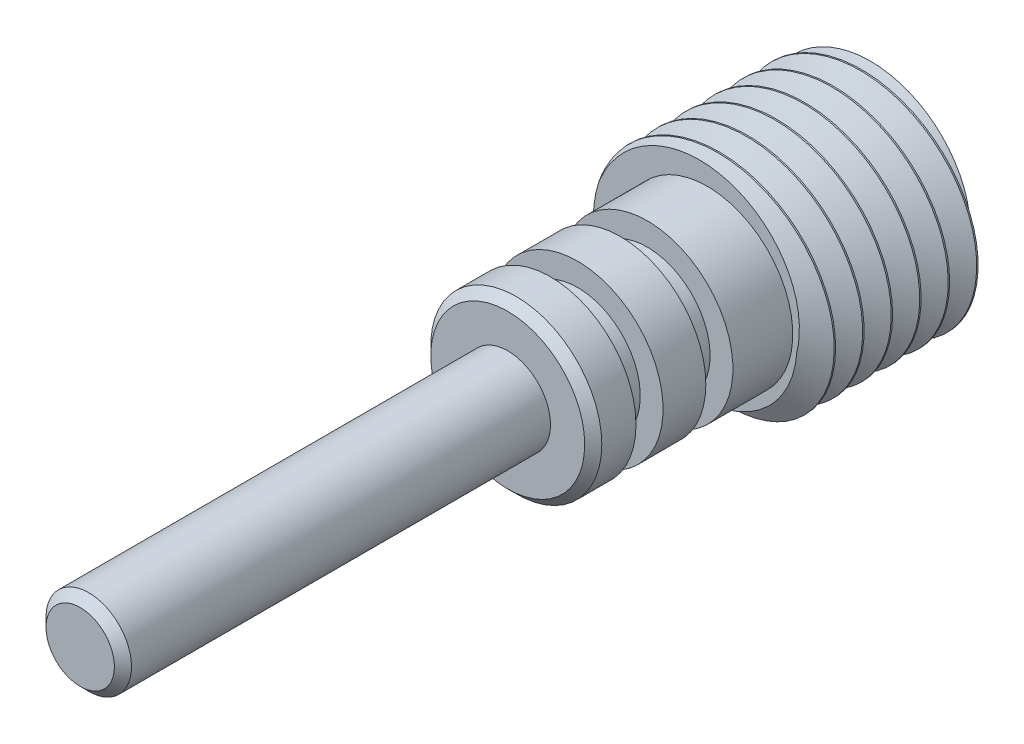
ISO-10303-21;
HEADER;
FILE_DESCRIPTION(('STEP AP214'),'2;1');
FILE_NAME('part.step','',(''),(''),'','','');
FILE_SCHEMA(('AUTOMOTIVE_DESIGN { 1 0 10303 214 1 1 1 1 }'));
ENDSEC;
DATA;
#1=APPLICATION_CONTEXT('core data for automotive mechanical design processes');
#2=APPLICATION_PROTOCOL_DEFINITION('international standard','automotive_design',2000,#1);
#3=PRODUCT_CONTEXT('',#1,'mechanical');
#4=PRODUCT('Part','Part','',(#3));
#5=PRODUCT_RELATED_PRODUCT_CATEGORY('part','',(#4));
#6=PRODUCT_DEFINITION_FORMATION('','',#4);
#7=PRODUCT_DEFINITION_CONTEXT('part definition',#1,'design');
#8=PRODUCT_DEFINITION('design','',#6,#7);
#9=PRODUCT_DEFINITION_SHAPE('','',#8);
#10=(LENGTH_UNIT() NAMED_UNIT(*) SI_UNIT(.MILLI.,.METRE.));
#11=(NAMED_UNIT(*) PLANE_ANGLE_UNIT() SI_UNIT($,.RADIAN.));
#12=(NAMED_UNIT(*) SI_UNIT($,.STERADIAN.) SOLID_ANGLE_UNIT());
#13=UNCERTAINTY_MEASURE_WITH_UNIT(LENGTH_MEASURE(1.E-05),#10,'distance_accuracy_value','');
#14=(GEOMETRIC_REPRESENTATION_CONTEXT(3) GLOBAL_UNCERTAINTY_ASSIGNED_CONTEXT((#13)) GLOBAL_UNIT_ASSIGNED_CONTEXT((#10,
#11,#12)) REPRESENTATION_CONTEXT('',''));
#15=CARTESIAN_POINT('',(0.,0.,0.));
#16=DIRECTION('',(0.,0.,1.));
#17=DIRECTION('',(1.,0.,0.));
#18=AXIS2_PLACEMENT_3D('',#15,#16,#17);
#19=CARTESIAN_POINT('',(0.,0.,14.));
#20=DIRECTION('',(0.,0.,-1.));
#21=DIRECTION('',(-1.,0.,0.));
#22=AXIS2_PLACEMENT_3D('',#19,#20,#21);
#23=CYLINDRICAL_SURFACE('',#22,6.);
#24=CARTESIAN_POINT('',(0.,0.,9.1));
#25=DIRECTION('',(0.,0.,-1.));
#26=DIRECTION('',(-1.,0.,0.));
#27=AXIS2_PLACEMENT_3D('',#24,#25,#26);
#28=CIRCLE('',#27,6.);
#29=CARTESIAN_POINT('',(-6.,0.,9.1));
#30=VERTEX_POINT('',#29);
#31=EDGE_CURVE('E190',#30,#30,#28,.T.);
#32=ORIENTED_EDGE('',*,*,#31,.T.);
#33=EDGE_LOOP('',(#32));
#34=FACE_BOUND('',#33,.T.);
#35=CARTESIAN_POINT('',(0.,0.,6.1));
#36=DIRECTION('',(0.,0.,1.));
#37=DIRECTION('',(1.,0.,0.));
#38=AXIS2_PLACEMENT_3D('',#35,#36,#37);
#39=CIRCLE('',#38,6.);
#40=CARTESIAN_POINT('',(6.,0.,6.1));
#41=VERTEX_POINT('',#40);
#42=EDGE_CURVE('E145',#41,#41,#39,.T.);
#43=ORIENTED_EDGE('',*,*,#42,.T.);
#44=EDGE_LOOP('',(#43));
#45=FACE_BOUND('',#44,.T.);
#46=ADVANCED_FACE('F33',(#34,#45),#23,.T.);
#47=CARTESIAN_POINT('',(6.3,0.,6.1));
#48=DIRECTION('',(0.,0.,1.));
#49=DIRECTION('',(1.,0.,0.));
#50=AXIS2_PLACEMENT_3D('',#47,#48,#49);
#51=PLANE('',#50);
#52=CARTESIAN_POINT('',(0.,0.,6.1));
#53=DIRECTION('',(0.,0.,-1.));
#54=DIRECTION('',(-1.,0.,0.));
#55=AXIS2_PLACEMENT_3D('',#52,#53,#54);
#56=CIRCLE('',#55,4.4);
#57=CARTESIAN_POINT('',(-4.4,0.,6.1));
#58=VERTEX_POINT('',#57);
#59=EDGE_CURVE('E133',#58,#58,#56,.T.);
#60=ORIENTED_EDGE('',*,*,#59,.F.);
#61=EDGE_LOOP('',(#60));
#62=FACE_BOUND('',#61,.T.);
#63=ORIENTED_EDGE('',*,*,#42,.F.);
#64=EDGE_LOOP('',(#63));
#65=FACE_BOUND('',#64,.T.);
#66=ADVANCED_FACE('F212',(#62,#65),#51,.F.);
#67=CARTESIAN_POINT('',(6.3,0.,4.2));
#68=DIRECTION('',(0.,0.,-1.));
#69=DIRECTION('',(-1.,0.,0.));
#70=AXIS2_PLACEMENT_3D('',#67,#68,#69);
#71=PLANE('',#70);
#72=CARTESIAN_POINT('',(0.,0.,4.2));
#73=DIRECTION('',(0.,0.,-1.));
#74=DIRECTION('',(-1.,0.,0.));
#75=AXIS2_PLACEMENT_3D('',#72,#73,#74);
#76=CIRCLE('',#75,4.4);
#77=CARTESIAN_POINT('',(-4.4,0.,4.2));
#78=VERTEX_POINT('',#77);
#79=EDGE_CURVE('E196',#78,#78,#76,.T.);
#80=ORIENTED_EDGE('',*,*,#79,.T.);
#81=EDGE_LOOP('',(#80));
#82=FACE_BOUND('',#81,.T.);
#83=CARTESIAN_POINT('',(0.,0.,4.2));
#84=DIRECTION('',(0.,0.,-1.));
#85=DIRECTION('',(-1.,0.,0.));
#86=AXIS2_PLACEMENT_3D('',#83,#84,#85);
#87=CIRCLE('',#86,6.);
#88=CARTESIAN_POINT('',(-6.,0.,4.2));
#89=VERTEX_POINT('',#88);
#90=EDGE_CURVE('E186',#89,#89,#87,.T.);
#91=ORIENTED_EDGE('',*,*,#90,.F.);
#92=EDGE_LOOP('',(#91));
#93=FACE_BOUND('',#92,.T.);
#94=ADVANCED_FACE('F215',(#82,#93),#71,.F.);
#95=CARTESIAN_POINT('',(0.,0.,1.40476278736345));
#96=DIRECTION('',(0.,0.,-1.));
#97=DIRECTION('',(-1.,0.,0.));
#98=AXIS2_PLACEMENT_3D('',#95,#96,#97);
#99=CYLINDRICAL_SURFACE('',#98,4.4);
#100=ORIENTED_EDGE('',*,*,#79,.F.);
#101=EDGE_LOOP('',(#100));
#102=FACE_BOUND('',#101,.T.);
#103=ORIENTED_EDGE('',*,*,#59,.T.);
#104=EDGE_LOOP('',(#103));
#105=FACE_BOUND('',#104,.T.);
#106=ADVANCED_FACE('F210',(#102,#105),#99,.T.);
#107=CARTESIAN_POINT('',(-3.46410161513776,0.,-8.));
#108=DIRECTION('',(0.,0.,-1.));
#109=DIRECTION('',(-1.,0.,0.));
#110=AXIS2_PLACEMENT_3D('',#107,#108,#109);
#111=PLANE('',#110);
#112=DIRECTION('',(-0.5,0.866025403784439,0.));
#113=VECTOR('',#112,1.);
#114=CARTESIAN_POINT('',(-1.73205080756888,-3.,-8.));
#115=LINE('',#114,#113);
#116=CARTESIAN_POINT('',(-1.73205080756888,-3.,-8.));
#117=VERTEX_POINT('',#116);
#118=CARTESIAN_POINT('',(-3.46410161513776,0.,-8.));
#119=VERTEX_POINT('',#118);
#120=EDGE_CURVE('E108',#117,#119,#115,.T.);
#121=ORIENTED_EDGE('',*,*,#120,.T.);
#122=DIRECTION('',(0.5,0.866025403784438,0.));
#123=VECTOR('',#122,1.);
#124=CARTESIAN_POINT('',(-3.46410161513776,0.,-8.));
#125=LINE('',#124,#123);
#126=CARTESIAN_POINT('',(-1.73205080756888,3.,-8.));
#127=VERTEX_POINT('',#126);
#128=EDGE_CURVE('E117',#119,#127,#125,.T.);
#129=ORIENTED_EDGE('',*,*,#128,.T.);
#130=DIRECTION('',(1.,0.,0.));
#131=VECTOR('',#130,1.);
#132=CARTESIAN_POINT('',(-1.73205080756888,3.,-8.));
#133=LINE('',#132,#131);
#134=CARTESIAN_POINT('',(1.73205080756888,3.,-8.));
#135=VERTEX_POINT('',#134);
#136=EDGE_CURVE('E122',#127,#135,#133,.T.);
#137=ORIENTED_EDGE('',*,*,#136,.T.);
#138=DIRECTION('',(0.5,-0.866025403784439,0.));
#139=VECTOR('',#138,1.);
#140=CARTESIAN_POINT('',(1.73205080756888,3.,-8.));
#141=LINE('',#140,#139);
#142=CARTESIAN_POINT('',(3.46410161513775,0.,-8.));
#143=VERTEX_POINT('',#142);
#144=EDGE_CURVE('E137',#135,#143,#141,.T.);
#145=ORIENTED_EDGE('',*,*,#144,.T.);
#146=DIRECTION('',(-0.5,-0.866025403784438,0.));
#147=VECTOR('',#146,1.);
#148=CARTESIAN_POINT('',(3.46410161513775,0.,-8.));
#149=LINE('',#148,#147);
#150=CARTESIAN_POINT('',(1.73205080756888,-3.,-8.));
#151=VERTEX_POINT('',#150);
#152=EDGE_CURVE('E140',#143,#151,#149,.T.);
#153=ORIENTED_EDGE('',*,*,#152,.T.);
#154=DIRECTION('',(-1.,0.,0.));
#155=VECTOR('',#154,1.);
#156=CARTESIAN_POINT('',(1.73205080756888,-3.,-8.));
#157=LINE('',#156,#155);
#158=EDGE_CURVE('E114',#151,#117,#157,.T.);
#159=ORIENTED_EDGE('',*,*,#158,.T.);
#160=EDGE_LOOP('',(#121,#129,#137,#145,#153,#159));
#161=FACE_BOUND('',#160,.T.);
#162=ADVANCED_FACE('F124',(#161),#111,.T.);
#163=CARTESIAN_POINT('',(-3.46410161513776,0.,-8.));
#164=DIRECTION('',(-0.866025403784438,0.5,0.));
#165=DIRECTION('',(-0.5,-0.866025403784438,0.));
#166=AXIS2_PLACEMENT_3D('',#163,#164,#165);
#167=PLANE('',#166);
#168=DIRECTION('',(0.5,0.866025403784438,0.));
#169=VECTOR('',#168,1.);
#170=CARTESIAN_POINT('',(-3.46410161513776,0.,-12.));
#171=LINE('',#170,#169);
#172=CARTESIAN_POINT('',(-3.46410161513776,0.,-12.));
#173=VERTEX_POINT('',#172);
#174=CARTESIAN_POINT('',(-1.73205080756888,3.,-12.));
#175=VERTEX_POINT('',#174);
#176=EDGE_CURVE('E144',#173,#175,#171,.T.);
#177=ORIENTED_EDGE('',*,*,#176,.T.);
#178=DIRECTION('',(0.,0.,-1.));
#179=VECTOR('',#178,1.);
#180=CARTESIAN_POINT('',(-1.73205080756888,3.,-8.));
#181=LINE('',#180,#179);
#182=EDGE_CURVE('E113',#127,#175,#181,.T.);
#183=ORIENTED_EDGE('',*,*,#182,.F.);
#184=ORIENTED_EDGE('',*,*,#128,.F.);
#185=DIRECTION('',(0.,0.,-1.));
#186=VECTOR('',#185,1.);
#187=CARTESIAN_POINT('',(-3.46410161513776,0.,-8.));
#188=LINE('',#187,#186);
#189=EDGE_CURVE('E104',#119,#173,#188,.T.);
#190=ORIENTED_EDGE('',*,*,#189,.T.);
#191=EDGE_LOOP('',(#177,#183,#184,#190));
#192=FACE_BOUND('',#191,.T.);
#193=ADVANCED_FACE('F118',(#192),#167,.F.);
#194=CARTESIAN_POINT('',(-1.73205080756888,3.,-8.));
#195=DIRECTION('',(0.,1.,0.));
#196=DIRECTION('',(0.,0.,1.));
#197=AXIS2_PLACEMENT_3D('',#194,#195,#196);
#198=PLANE('',#197);
#199=DIRECTION('',(1.,0.,0.));
#200=VECTOR('',#199,1.);
#201=CARTESIAN_POINT('',(-1.73205080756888,3.,-12.));
#202=LINE('',#201,#200);
#203=CARTESIAN_POINT('',(1.73205080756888,3.,-12.));
#204=VERTEX_POINT('',#203);
#205=EDGE_CURVE('E147',#175,#204,#202,.T.);
#206=ORIENTED_EDGE('',*,*,#205,.T.);
#207=DIRECTION('',(0.,0.,-1.));
#208=VECTOR('',#207,1.);
#209=CARTESIAN_POINT('',(1.73205080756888,3.,-8.));
#210=LINE('',#209,#208);
#211=EDGE_CURVE('E162',#135,#204,#210,.T.);
#212=ORIENTED_EDGE('',*,*,#211,.F.);
#213=ORIENTED_EDGE('',*,*,#136,.F.);
#214=ORIENTED_EDGE('',*,*,#182,.T.);
#215=EDGE_LOOP('',(#206,#212,#213,#214));
#216=FACE_BOUND('',#215,.T.);
#217=ADVANCED_FACE('F360',(#216),#198,.F.);
#218=CARTESIAN_POINT('',(1.73205080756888,3.,-8.));
#219=DIRECTION('',(0.866025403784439,0.5,0.));
#220=DIRECTION('',(-0.5,0.866025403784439,0.));
#221=AXIS2_PLACEMENT_3D('',#218,#219,#220);
#222=PLANE('',#221);
#223=DIRECTION('',(0.5,-0.866025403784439,0.));
#224=VECTOR('',#223,1.);
#225=CARTESIAN_POINT('',(1.73205080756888,3.,-12.));
#226=LINE('',#225,#224);
#227=CARTESIAN_POINT('',(3.46410161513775,0.,-12.));
#228=VERTEX_POINT('',#227);
#229=EDGE_CURVE('E150',#204,#228,#226,.T.);
#230=ORIENTED_EDGE('',*,*,#229,.T.);
#231=DIRECTION('',(0.,0.,-1.));
#232=VECTOR('',#231,1.);
#233=CARTESIAN_POINT('',(3.46410161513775,0.,-8.));
#234=LINE('',#233,#232);
#235=EDGE_CURVE('E160',#143,#228,#234,.T.);
#236=ORIENTED_EDGE('',*,*,#235,.F.);
#237=ORIENTED_EDGE('',*,*,#144,.F.);
#238=ORIENTED_EDGE('',*,*,#211,.T.);
#239=EDGE_LOOP('',(#230,#236,#237,#238));
#240=FACE_BOUND('',#239,.T.);
#241=ADVANCED_FACE('F356',(#240),#222,.F.);
#242=CARTESIAN_POINT('',(3.46410161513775,0.,-8.));
#243=DIRECTION('',(0.866025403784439,-0.5,0.));
#244=DIRECTION('',(0.5,0.866025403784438,0.));
#245=AXIS2_PLACEMENT_3D('',#242,#243,#244);
#246=PLANE('',#245);
#247=DIRECTION('',(-0.5,-0.866025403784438,0.));
#248=VECTOR('',#247,1.);
#249=CARTESIAN_POINT('',(3.46410161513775,0.,-12.));
#250=LINE('',#249,#248);
#251=CARTESIAN_POINT('',(1.73205080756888,-3.,-12.));
#252=VERTEX_POINT('',#251);
#253=EDGE_CURVE('E130',#228,#252,#250,.T.);
#254=ORIENTED_EDGE('',*,*,#253,.T.);
#255=DIRECTION('',(0.,0.,-1.));
#256=VECTOR('',#255,1.);
#257=CARTESIAN_POINT('',(1.73205080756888,-3.,-8.));
#258=LINE('',#257,#256);
#259=EDGE_CURVE('E158',#151,#252,#258,.T.);
#260=ORIENTED_EDGE('',*,*,#259,.F.);
#261=ORIENTED_EDGE('',*,*,#152,.F.);
#262=ORIENTED_EDGE('',*,*,#235,.T.);
#263=EDGE_LOOP('',(#254,#260,#261,#262));
#264=FACE_BOUND('',#263,.T.);
#265=ADVANCED_FACE('F352',(#264),#246,.F.);
#266=CARTESIAN_POINT('',(1.73205080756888,-3.,-8.));
#267=DIRECTION('',(0.,-1.,0.));
#268=DIRECTION('',(0.,0.,-1.));
#269=AXIS2_PLACEMENT_3D('',#266,#267,#268);
#270=PLANE('',#269);
#271=DIRECTION('',(-1.,0.,0.));
#272=VECTOR('',#271,1.);
#273=CARTESIAN_POINT('',(1.73205080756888,-3.,-12.));
#274=LINE('',#273,#272);
#275=CARTESIAN_POINT('',(-1.73205080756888,-3.,-12.));
#276=VERTEX_POINT('',#275);
#277=EDGE_CURVE('E127',#252,#276,#274,.T.);
#278=ORIENTED_EDGE('',*,*,#277,.T.);
#279=DIRECTION('',(0.,0.,-1.));
#280=VECTOR('',#279,1.);
#281=CARTESIAN_POINT('',(-1.73205080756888,-3.,-8.));
#282=LINE('',#281,#280);
#283=EDGE_CURVE('E155',#117,#276,#282,.T.);
#284=ORIENTED_EDGE('',*,*,#283,.F.);
#285=ORIENTED_EDGE('',*,*,#158,.F.);
#286=ORIENTED_EDGE('',*,*,#259,.T.);
#287=EDGE_LOOP('',(#278,#284,#285,#286));
#288=FACE_BOUND('',#287,.T.);
#289=ADVANCED_FACE('F349',(#288),#270,.F.);
#290=CARTESIAN_POINT('',(-1.73205080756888,-3.,-8.));
#291=DIRECTION('',(-0.866025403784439,-0.5,0.));
#292=DIRECTION('',(0.5,-0.866025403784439,0.));
#293=AXIS2_PLACEMENT_3D('',#290,#291,#292);
#294=PLANE('',#293);
#295=DIRECTION('',(-0.5,0.866025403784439,0.));
#296=VECTOR('',#295,1.);
#297=CARTESIAN_POINT('',(-1.73205080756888,-3.,-12.));
#298=LINE('',#297,#296);
#299=EDGE_CURVE('E50',#276,#173,#298,.T.);
#300=ORIENTED_EDGE('',*,*,#299,.T.);
#301=ORIENTED_EDGE('',*,*,#189,.F.);
#302=ORIENTED_EDGE('',*,*,#120,.F.);
#303=ORIENTED_EDGE('',*,*,#283,.T.);
#304=EDGE_LOOP('',(#300,#301,#302,#303));
#305=FACE_BOUND('',#304,.T.);
#306=ADVANCED_FACE('F106',(#305),#294,.F.);
#307=CARTESIAN_POINT('',(0.,0.,-12.));
#308=DIRECTION('',(0.,0.,-1.));
#309=DIRECTION('',(-1.,0.,0.));
#310=AXIS2_PLACEMENT_3D('',#307,#308,#309);
#311=PLANE('',#310);
#312=ORIENTED_EDGE('',*,*,#299,.F.);
#313=ORIENTED_EDGE('',*,*,#277,.F.);
#314=ORIENTED_EDGE('',*,*,#253,.F.);
#315=ORIENTED_EDGE('',*,*,#229,.F.);
#316=ORIENTED_EDGE('',*,*,#205,.F.);
#317=ORIENTED_EDGE('',*,*,#176,.F.);
#318=EDGE_LOOP('',(#312,#313,#314,#315,#316,#317));
#319=FACE_BOUND('',#318,.T.);
#320=CARTESIAN_POINT('',(0.,0.,-12.));
#321=DIRECTION('',(0.,0.,-1.));
#322=DIRECTION('',(-1.,0.,0.));
#323=AXIS2_PLACEMENT_3D('',#320,#321,#322);
#324=CIRCLE('',#323,8.);
#325=CARTESIAN_POINT('',(-8.,0.,-12.));
#326=VERTEX_POINT('',#325);
#327=CARTESIAN_POINT('',(-7.60845213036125,2.47213595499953,-12.));
#328=VERTEX_POINT('',#327);
#329=EDGE_CURVE('E256',#326,#328,#324,.T.);
#330=ORIENTED_EDGE('',*,*,#329,.T.);
#331=CARTESIAN_POINT('',(-7.60845213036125,2.47213595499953,-12.));
#332=CARTESIAN_POINT('',(-7.5244149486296,2.68013770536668,-12.));
#333=CARTESIAN_POINT('',(-7.43153349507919,2.88461587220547,-12.));
#334=CARTESIAN_POINT('',(-7.22886913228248,3.28508401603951,-12.));
#335=CARTESIAN_POINT('',(-7.11908191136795,3.48107181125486,-12.));
#336=CARTESIAN_POINT('',(-6.94235102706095,3.76752104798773,-12.));
#337=CARTESIAN_POINT('',(-6.88143403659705,3.86174649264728,-12.));
#338=CARTESIAN_POINT('',(-6.75567875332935,4.04755389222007,-12.));
#339=CARTESIAN_POINT('',(-6.69084038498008,4.13913579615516,-12.));
#340=CARTESIAN_POINT('',(-6.5573667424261,4.31947548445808,-12.));
#341=CARTESIAN_POINT('',(-6.48873183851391,4.40823354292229,-12.));
#342=CARTESIAN_POINT('',(-6.34779022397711,4.58277422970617,-12.));
#343=CARTESIAN_POINT('',(-6.27548359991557,4.66855692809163,-12.));
#344=CARTESIAN_POINT('',(-6.05315018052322,4.92078460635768,-12.));
#345=CARTESIAN_POINT('',(-5.89752562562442,5.08235959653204,-12.));
#346=CARTESIAN_POINT('',(-5.57270793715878,5.39119796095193,-12.));
#347=CARTESIAN_POINT('',(-5.40351436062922,5.53846086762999,-12.));
#348=CARTESIAN_POINT('',(-5.0528879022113,5.81748854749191,-12.));
#349=CARTESIAN_POINT('',(-4.87145954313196,5.94925899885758,-12.));
#350=CARTESIAN_POINT('',(-4.49772609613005,6.19633359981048,-12.));
#351=CARTESIAN_POINT('',(-4.30542149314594,6.31163848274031,-12.));
#352=CARTESIAN_POINT('',(-3.91959189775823,6.52047088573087,-12.));
#353=CARTESIAN_POINT('',(-3.72644711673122,6.614702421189,-12.));
#354=CARTESIAN_POINT('',(-3.33286581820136,6.78656736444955,-12.));
#355=CARTESIAN_POINT('',(-3.13242903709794,6.86420017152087,-12.));
#356=CARTESIAN_POINT('',(-2.82747261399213,6.96773820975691,-12.));
#357=CARTESIAN_POINT('',(-2.72510059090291,7.00009977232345,-12.));
#358=CARTESIAN_POINT('',(-2.51908097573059,7.06050816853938,-12.));
#359=CARTESIAN_POINT('',(-2.41543335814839,7.08855491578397,-12.));
#360=CARTESIAN_POINT('',(-2.20702919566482,7.14014837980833,-12.));
#361=CARTESIAN_POINT('',(-2.10227271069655,7.16369533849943,-12.));
#362=CARTESIAN_POINT('',(-1.89182792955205,7.20611207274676,-12.));
#363=CARTESIAN_POINT('',(-1.78613973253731,7.22498233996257,-12.));
#364=CARTESIAN_POINT('',(-1.57509984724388,7.25787949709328,-12.));
#365=CARTESIAN_POINT('',(-1.46975546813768,7.27195319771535,-12.));
#366=CARTESIAN_POINT('',(-1.25858376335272,7.29547799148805,-12.));
#367=CARTESIAN_POINT('',(-1.15275655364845,7.30493014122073,-12.));
#368=CARTESIAN_POINT('',(-0.834776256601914,7.32633201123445,-12.));
#369=CARTESIAN_POINT('',(-0.622111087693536,7.33132924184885,-12.));
#370=CARTESIAN_POINT('',(-0.197141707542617,7.32272087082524,-12.));
#371=CARTESIAN_POINT('',(0.0151624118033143,7.30911108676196,-12.));
#372=CARTESIAN_POINT('',(0.437772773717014,7.26338524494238,-12.));
#373=CARTESIAN_POINT('',(0.648079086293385,7.23126983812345,-12.));
#374=CARTESIAN_POINT('',(1.05770144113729,7.15024779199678,-12.));
#375=CARTESIAN_POINT('',(1.25714330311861,7.10197427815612,-12.));
#376=CARTESIAN_POINT('',(1.65126455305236,6.98875397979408,-12.));
#377=CARTESIAN_POINT('',(1.84594394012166,6.92380719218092,-12.));
#378=CARTESIAN_POINT('',(2.1332710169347,6.81434573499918,-12.));
#379=CARTESIAN_POINT('',(2.22825319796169,6.77585723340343,-12.));
#380=CARTESIAN_POINT('',(2.41642044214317,6.69471520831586,-12.));
#381=CARTESIAN_POINT('',(2.50960555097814,6.65206179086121,-12.));
#382=CARTESIAN_POINT('',(2.78617235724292,6.51798497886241,-12.));
#383=CARTESIAN_POINT('',(2.96662414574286,6.42042276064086,-12.));
#384=CARTESIAN_POINT('',(3.314733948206,6.21179218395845,-12.));
#385=CARTESIAN_POINT('',(3.4825728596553,6.10102440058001,-12.));
#386=CARTESIAN_POINT('',(3.80802139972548,5.86534103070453,-12.));
#387=CARTESIAN_POINT('',(3.96563078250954,5.74042510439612,-12.));
#388=CARTESIAN_POINT('',(4.26947281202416,5.47734012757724,-12.));
#389=CARTESIAN_POINT('',(4.41570117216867,5.33916612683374,-12.));
#390=CARTESIAN_POINT('',(4.69561511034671,5.05064738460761,-12.));
#391=CARTESIAN_POINT('',(4.82930030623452,4.90030227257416,-12.));
#392=CARTESIAN_POINT('',(5.07954193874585,4.59295959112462,-12.));
#393=CARTESIAN_POINT('',(5.19647545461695,4.43626975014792,-12.));
#394=CARTESIAN_POINT('',(5.36163044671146,4.19430837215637,-12.));
#395=CARTESIAN_POINT('',(5.41497819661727,4.11249371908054,-12.));
#396=CARTESIAN_POINT('',(5.49237057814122,3.98813597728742,-12.));
#397=CARTESIAN_POINT('',(5.51772985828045,3.94641072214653,-12.));
#398=CARTESIAN_POINT('',(5.56750911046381,3.86240286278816,-12.));
#399=CARTESIAN_POINT('',(5.59192902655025,3.82012022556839,-12.));
#400=CARTESIAN_POINT('',(5.71160828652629,3.60748245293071,-12.));
#401=CARTESIAN_POINT('',(5.79983233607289,3.4330789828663,-12.));
#402=CARTESIAN_POINT('',(5.96044349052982,3.07717054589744,-12.));
#403=CARTESIAN_POINT('',(6.0328305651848,2.89566556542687,-12.));
#404=CARTESIAN_POINT('',(6.159314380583,2.53242421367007,-12.));
#405=CARTESIAN_POINT('',(6.21389070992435,2.35085498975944,-12.));
#406=CARTESIAN_POINT('',(6.30720665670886,1.98368703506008,-12.));
#407=CARTESIAN_POINT('',(6.34594590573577,1.79808821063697,-12.));
#408=CARTESIAN_POINT('',(6.40728657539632,1.42430883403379,-12.));
#409=CARTESIAN_POINT('',(6.42989325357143,1.23612914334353,-12.));
#410=CARTESIAN_POINT('',(6.45882308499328,0.858542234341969,-12.));
#411=CARTESIAN_POINT('',(6.4651493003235,0.669135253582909,-12.));
#412=CARTESIAN_POINT('',(6.46209156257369,0.354585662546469,-12.));
#413=CARTESIAN_POINT('',(6.45729882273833,0.229382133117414,-12.));
#414=CARTESIAN_POINT('',(6.4447945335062,0.0419559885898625,-12.));
#415=CARTESIAN_POINT('',(6.4397413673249,-0.0204497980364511,-12.));
#416=CARTESIAN_POINT('',(6.4277598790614,-0.145080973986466,-12.));
#417=CARTESIAN_POINT('',(6.4208315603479,-0.207306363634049,-12.));
#418=CARTESIAN_POINT('',(6.3972719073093,-0.393431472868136,-12.));
#419=CARTESIAN_POINT('',(6.3778520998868,-0.516988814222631,-12.));
#420=CARTESIAN_POINT('',(6.33163026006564,-0.762776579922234,-12.));
#421=CARTESIAN_POINT('',(6.30482466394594,-0.885006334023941,-12.));
#422=CARTESIAN_POINT('',(6.27436661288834,-1.0063057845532,-12.));
#423=B_SPLINE_CURVE_WITH_KNOTS('',3,(#331,#332,#333,#334,#335,#336,#337,#338,#339,#340,#341,
#342,#343,#344,#345,#346,#347,#348,#349,#350,#351,#352,#353,#354,#355,#356,#357,#358,#359,#360,
#361,#362,#363,#364,#365,#366,#367,#368,#369,#370,#371,#372,#373,#374,#375,#376,#377,#378,#379,
#380,#381,#382,#383,#384,#385,#386,#387,#388,#389,#390,#391,#392,#393,#394,#395,#396,#397,#398,
#399,#400,#401,#402,#403,#404,#405,#406,#407,#408,#409,#410,#411,#412,#413,#414,#415,#416,#417,
#418,#419,#420,#421,#422),.UNSPECIFIED.,.F.,.F.,(4,2,2,2,2,2,2,2,2,2,2,2,2,2,2,2,2,2,2,2,2,2,2,
2,2,2,2,2,2,2,2,2,2,2,2,2,2,2,2,2,2,2,2,2,2,4),(0.,0.672906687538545,1.34598527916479,
1.68250802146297,2.01903724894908,2.35553371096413,2.69202224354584,3.36406990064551,
4.03613950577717,4.70796201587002,5.37975459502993,6.02373163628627,6.66773198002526,
6.98975067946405,7.31177582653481,7.6337836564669,7.95575761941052,8.2744928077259,
8.59315509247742,9.23043907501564,9.86786632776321,10.5052711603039,11.120163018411,
11.7350549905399,12.0424246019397,12.3497863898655,12.9643225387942,13.5668714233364,
14.1694347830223,14.7722240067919,15.3750315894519,15.9608173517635,16.2537543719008,
16.4002232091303,16.5467007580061,17.1321737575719,17.7176478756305,18.2857243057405,
18.853813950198,19.421718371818,19.989515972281,20.3652038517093,20.5530091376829,
20.7408140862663,21.115797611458,21.4909623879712),.UNSPECIFIED.);
#424=CARTESIAN_POINT('',(6.27436661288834,-1.0063057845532,-12.));
#425=VERTEX_POINT('',#424);
#426=EDGE_CURVE('E266',#328,#425,#423,.T.);
#427=ORIENTED_EDGE('',*,*,#426,.T.);
#428=CARTESIAN_POINT('',(6.27436661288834,-1.0063057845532,-12.));
#429=CARTESIAN_POINT('',(6.26232425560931,-1.17323012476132,-12.));
#430=CARTESIAN_POINT('',(6.24372398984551,-1.33967799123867,-12.));
#431=CARTESIAN_POINT('',(6.19358326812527,-1.67061372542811,-12.));
#432=CARTESIAN_POINT('',(6.16204278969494,-1.83510158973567,-12.));
#433=CARTESIAN_POINT('',(6.08627147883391,-2.16079089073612,-12.));
#434=CARTESIAN_POINT('',(6.04206558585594,-2.32199812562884,-12.));
#435=CARTESIAN_POINT('',(5.94122307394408,-2.64046630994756,-12.));
#436=CARTESIAN_POINT('',(5.88458652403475,-2.79772728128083,-12.));
#437=CARTESIAN_POINT('',(5.75424798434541,-3.11961953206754,-12.));
#438=CARTESIAN_POINT('',(5.67955092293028,-3.28385080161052,-12.));
#439=CARTESIAN_POINT('',(5.55738663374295,-3.52502347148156,-12.));
#440=CARTESIAN_POINT('',(5.51497126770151,-3.60456412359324,-12.));
#441=CARTESIAN_POINT('',(5.42680168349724,-3.76177991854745,-12.));
#442=CARTESIAN_POINT('',(5.38104743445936,-3.83945504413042,-12.));
#443=CARTESIAN_POINT('',(5.28639685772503,-3.99292811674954,-12.));
#444=CARTESIAN_POINT('',(5.23749866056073,-4.06872490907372,-12.));
#445=CARTESIAN_POINT('',(5.13672760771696,-4.21830860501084,-12.));
#446=CARTESIAN_POINT('',(5.08485474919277,-4.29209550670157,-12.));
#447=CARTESIAN_POINT('',(4.92487047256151,-4.510249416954,-12.));
#448=CARTESIAN_POINT('',(4.81237503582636,-4.65143931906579,-12.));
#449=CARTESIAN_POINT('',(4.57330497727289,-4.92803310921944,-12.));
#450=CARTESIAN_POINT('',(4.44643327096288,-5.06317959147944,-12.));
#451=CARTESIAN_POINT('',(4.18202409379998,-5.32261157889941,-12.));
#452=CARTESIAN_POINT('',(4.04448649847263,-5.44689695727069,-12.));
#453=CARTESIAN_POINT('',(3.7597221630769,-5.68372735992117,-12.));
#454=CARTESIAN_POINT('',(3.61249848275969,-5.79627606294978,-12.));
#455=CARTESIAN_POINT('',(3.30933001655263,-6.0089146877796,-12.));
#456=CARTESIAN_POINT('',(3.15338555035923,-6.10900506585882,-12.));
#457=CARTESIAN_POINT('',(2.82961259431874,-6.2985266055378,-12.));
#458=CARTESIAN_POINT('',(2.6615799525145,-6.38761048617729,-12.));
#459=CARTESIAN_POINT('',(2.40439614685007,-6.5103811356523,-12.));
#460=CARTESIAN_POINT('',(2.3177993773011,-6.54950041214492,-12.));
#461=CARTESIAN_POINT('',(2.14304322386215,-6.62407963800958,-12.));
#462=CARTESIAN_POINT('',(2.05488380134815,-6.65953949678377,-12.));
#463=CARTESIAN_POINT('',(1.78831534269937,-6.76063736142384,-12.));
#464=CARTESIAN_POINT('',(1.60786228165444,-6.82097180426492,-12.));
#465=CARTESIAN_POINT('',(1.24272084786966,-6.9269627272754,-12.));
#466=CARTESIAN_POINT('',(1.05803254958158,-6.97261946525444,-12.));
#467=CARTESIAN_POINT('',(0.680082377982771,-7.05012878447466,-12.));
#468=CARTESIAN_POINT('',(0.48672840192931,-7.0815337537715,-12.));
#469=CARTESIAN_POINT('',(0.0980850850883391,-7.12828970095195,-12.));
#470=CARTESIAN_POINT('',(-0.0972043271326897,-7.14364008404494,-12.));
#471=CARTESIAN_POINT('',(-0.488313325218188,-7.15818424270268,-12.));
#472=CARTESIAN_POINT('',(-0.684132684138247,-7.15738409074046,-12.));
#473=CARTESIAN_POINT('',(-1.07501873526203,-7.13964568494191,-12.));
#474=CARTESIAN_POINT('',(-1.27008546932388,-7.12270834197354,-12.));
#475=CARTESIAN_POINT('',(-1.66225149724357,-7.07231553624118,-12.));
#476=CARTESIAN_POINT('',(-1.85930805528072,-7.03852221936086,-12.));
#477=CARTESIAN_POINT('',(-2.15216679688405,-6.97545006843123,-12.));
#478=CARTESIAN_POINT('',(-2.24934087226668,-6.95235961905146,-12.));
#479=CARTESIAN_POINT('',(-2.44270320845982,-6.90227640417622,-12.));
#480=CARTESIAN_POINT('',(-2.53889121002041,-6.87528263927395,-12.));
#481=CARTESIAN_POINT('',(-2.82577935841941,-6.78852192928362,-12.));
#482=CARTESIAN_POINT('',(-3.01476917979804,-6.72298304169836,-12.));
#483=CARTESIAN_POINT('',(-3.38684899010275,-6.57695047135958,-12.));
#484=CARTESIAN_POINT('',(-3.56993907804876,-6.49645703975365,-12.));
#485=CARTESIAN_POINT('',(-3.9348411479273,-6.31821019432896,-12.));
#486=CARTESIAN_POINT('',(-4.11642341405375,-6.21998564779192,-12.));
#487=CARTESIAN_POINT('',(-4.47083181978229,-6.00882229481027,-12.));
#488=CARTESIAN_POINT('',(-4.64365749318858,-5.89588270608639,-12.));
#489=CARTESIAN_POINT('',(-4.97928061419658,-5.65613117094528,-12.));
#490=CARTESIAN_POINT('',(-5.14208241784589,-5.52932531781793,-12.));
#491=CARTESIAN_POINT('',(-5.45663226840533,-5.26265551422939,-12.));
#492=CARTESIAN_POINT('',(-5.60838102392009,-5.12279240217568,-12.));
#493=CARTESIAN_POINT('',(-5.82805374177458,-4.9028368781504,-12.));
#494=CARTESIAN_POINT('',(-5.90048565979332,-4.82719421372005,-12.));
#495=CARTESIAN_POINT('',(-6.04209398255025,-4.67291156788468,-12.));
#496=CARTESIAN_POINT('',(-6.11127038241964,-4.5942715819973,-12.));
#497=CARTESIAN_POINT('',(-6.24631677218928,-4.4341958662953,-12.));
#498=CARTESIAN_POINT('',(-6.312186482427,-4.35275990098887,-12.));
#499=CARTESIAN_POINT('',(-6.44062349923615,-4.18732170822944,-12.));
#500=CARTESIAN_POINT('',(-6.50319072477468,-4.10331941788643,-12.));
#501=CARTESIAN_POINT('',(-6.62494909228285,-3.9327764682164,-12.));
#502=CARTESIAN_POINT('',(-6.68413688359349,-3.84623341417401,-12.));
#503=CARTESIAN_POINT('',(-6.79897430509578,-3.67084795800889,-12.));
#504=CARTESIAN_POINT('',(-6.85462420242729,-3.58200573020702,-12.));
#505=CARTESIAN_POINT('',(-7.01612842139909,-3.31223725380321,-12.));
#506=CARTESIAN_POINT('',(-7.11656738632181,-3.12802701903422,-12.));
#507=CARTESIAN_POINT('',(-7.30557232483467,-2.7454874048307,-12.));
#508=CARTESIAN_POINT('',(-7.39359236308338,-2.5468890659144,-12.));
#509=CARTESIAN_POINT('',(-7.55278458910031,-2.14304274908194,-12.));
#510=CARTESIAN_POINT('',(-7.62395678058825,-1.93779477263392,-12.));
#511=CARTESIAN_POINT('',(-7.74883763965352,-1.52248968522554,-12.));
#512=CARTESIAN_POINT('',(-7.80257920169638,-1.31244244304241,-12.));
#513=CARTESIAN_POINT('',(-7.89239407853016,-0.88869748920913,-12.));
#514=CARTESIAN_POINT('',(-7.92847783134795,-0.675002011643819,-12.));
#515=CARTESIAN_POINT('',(-7.96529227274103,-0.383732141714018,-12.));
#516=CARTESIAN_POINT('',(-7.97382810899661,-0.307085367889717,-12.));
#517=CARTESIAN_POINT('',(-7.98861949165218,-0.153653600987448,-12.));
#518=CARTESIAN_POINT('',(-7.99487743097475,-0.0768688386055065,-12.));
#519=CARTESIAN_POINT('',(-8.,0.,-12.));
#520=B_SPLINE_CURVE_WITH_KNOTS('',3,(#428,#429,#430,#431,#432,#433,#434,#435,#436,#437,#438,
#439,#440,#441,#442,#443,#444,#445,#446,#447,#448,#449,#450,#451,#452,#453,#454,#455,#456,#457,
#458,#459,#460,#461,#462,#463,#464,#465,#466,#467,#468,#469,#470,#471,#472,#473,#474,#475,#476,
#477,#478,#479,#480,#481,#482,#483,#484,#485,#486,#487,#488,#489,#490,#491,#492,#493,#494,#495,
#496,#497,#498,#499,#500,#501,#502,#503,#504,#505,#506,#507,#508,#509,#510,#511,#512,#513,#514,
#515,#516,#517,#518,#519),.UNSPECIFIED.,.F.,.F.,(4,2,2,2,2,2,2,2,2,2,2,2,2,2,2,2,2,2,2,2,2,2,2,
2,2,2,2,2,2,2,2,2,2,2,2,2,2,2,2,2,2,2,2,2,2,4),(0.,0.501941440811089,1.00388375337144,
1.50484440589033,2.00580227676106,2.54635869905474,2.81672219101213,3.08708818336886,
3.35761645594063,3.62814498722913,4.16909769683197,4.7245856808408,5.28008014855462,
5.83539997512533,6.39069945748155,6.96052345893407,7.24551874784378,7.5305210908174,
8.10067856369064,8.67082602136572,9.25781551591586,9.84482675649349,10.4316172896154,
11.0183747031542,11.6173962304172,11.9169623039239,12.2166052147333,12.8159965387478,
13.4153777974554,14.0340006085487,14.6526563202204,15.2710412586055,15.8893865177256,
16.2034971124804,16.5176081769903,16.8317457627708,17.1458910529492,17.4603425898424,
17.7747703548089,18.4034708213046,19.0544195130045,19.7053680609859,20.355080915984,
21.0044092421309,21.2357457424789,21.4668385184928),.UNSPECIFIED.);
#521=EDGE_CURVE('E157',#425,#326,#520,.T.);
#522=ORIENTED_EDGE('',*,*,#521,.T.);
#523=EDGE_LOOP('',(#330,#427,#522));
#524=FACE_BOUND('',#523,.T.);
#525=ADVANCED_FACE('F281',(#319,#524),#311,.T.);
#526=CARTESIAN_POINT('',(-8.,0.,-14.));
#527=CARTESIAN_POINT('',(-8.,-2.59935756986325,-13.9));
#528=CARTESIAN_POINT('',(-6.47213595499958,-4.70228201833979,-13.8));
#529=CARTESIAN_POINT('',(-4.94427190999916,-6.80520646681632,-13.7));
#530=CARTESIAN_POINT('',(-2.47213595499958,-7.60845213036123,-13.6));
#531=CARTESIAN_POINT('',(0.,-8.41169779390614,-13.5));
#532=CARTESIAN_POINT('',(2.47213595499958,-7.60845213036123,-13.4));
#533=CARTESIAN_POINT('',(4.94427190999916,-6.80520646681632,-13.3));
#534=CARTESIAN_POINT('',(6.47213595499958,-4.70228201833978,-13.2));
#535=CARTESIAN_POINT('',(8.,-2.59935756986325,-13.1));
#536=CARTESIAN_POINT('',(8.,0.,-13.));
#537=CARTESIAN_POINT('',(8.,2.59935756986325,-12.9));
#538=CARTESIAN_POINT('',(6.47213595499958,4.70228201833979,-12.8));
#539=CARTESIAN_POINT('',(4.94427190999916,6.80520646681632,-12.7));
#540=CARTESIAN_POINT('',(2.47213595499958,7.60845213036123,-12.6));
#541=CARTESIAN_POINT('',(0.,8.41169779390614,-12.5));
#542=CARTESIAN_POINT('',(-2.47213595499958,7.60845213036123,-12.4));
#543=CARTESIAN_POINT('',(-4.94427190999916,6.80520646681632,-12.3));
#544=CARTESIAN_POINT('',(-6.47213595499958,4.70228201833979,-12.2));
#545=CARTESIAN_POINT('',(-8.,2.59935756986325,-12.1));
#546=CARTESIAN_POINT('',(-8.,0.,-12.));
#547=CARTESIAN_POINT('',(-8.,-2.59935756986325,-11.9));
#548=CARTESIAN_POINT('',(-6.47213595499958,-4.70228201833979,-11.8));
#549=CARTESIAN_POINT('',(-4.94427190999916,-6.80520646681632,-11.7));
#550=CARTESIAN_POINT('',(-2.47213595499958,-7.60845213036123,-11.6));
#551=CARTESIAN_POINT('',(0.,-8.41169779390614,-11.5));
#552=CARTESIAN_POINT('',(2.47213595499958,-7.60845213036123,-11.4));
#553=CARTESIAN_POINT('',(4.94427190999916,-6.80520646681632,-11.3));
#554=CARTESIAN_POINT('',(6.47213595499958,-4.70228201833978,-11.2));
#555=CARTESIAN_POINT('',(8.,-2.59935756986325,-11.1));
#556=CARTESIAN_POINT('',(8.,0.,-11.));
#557=CARTESIAN_POINT('',(8.,2.59935756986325,-10.9));
#558=CARTESIAN_POINT('',(6.47213595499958,4.70228201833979,-10.8));
#559=CARTESIAN_POINT('',(4.94427190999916,6.80520646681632,-10.7));
#560=CARTESIAN_POINT('',(2.47213595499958,7.60845213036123,-10.6));
#561=CARTESIAN_POINT('',(0.,8.41169779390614,-10.5));
#562=CARTESIAN_POINT('',(-2.47213595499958,7.60845213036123,-10.4));
#563=CARTESIAN_POINT('',(-4.94427190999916,6.80520646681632,-10.3));
#564=CARTESIAN_POINT('',(-6.47213595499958,4.70228201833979,-10.2));
#565=CARTESIAN_POINT('',(-8.,2.59935756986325,-10.1));
#566=CARTESIAN_POINT('',(-8.,0.,-10.));
#567=CARTESIAN_POINT('',(-8.,-2.59935756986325,-9.9));
#568=CARTESIAN_POINT('',(-6.47213595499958,-4.70228201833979,-9.8));
#569=CARTESIAN_POINT('',(-4.94427190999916,-6.80520646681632,-9.7));
#570=CARTESIAN_POINT('',(-2.47213595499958,-7.60845213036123,-9.6));
#571=CARTESIAN_POINT('',(0.,-8.41169779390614,-9.5));
#572=CARTESIAN_POINT('',(2.47213595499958,-7.60845213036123,-9.4));
#573=CARTESIAN_POINT('',(4.94427190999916,-6.80520646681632,-9.3));
#574=CARTESIAN_POINT('',(6.47213595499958,-4.70228201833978,-9.2));
#575=CARTESIAN_POINT('',(8.,-2.59935756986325,-9.1));
#576=CARTESIAN_POINT('',(8.,0.,-9.));
#577=CARTESIAN_POINT('',(8.,2.59935756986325,-8.9));
#578=CARTESIAN_POINT('',(6.47213595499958,4.70228201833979,-8.8));
#579=CARTESIAN_POINT('',(4.94427190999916,6.80520646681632,-8.7));
#580=CARTESIAN_POINT('',(2.47213595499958,7.60845213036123,-8.6));
#581=CARTESIAN_POINT('',(0.,8.41169779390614,-8.5));
#582=CARTESIAN_POINT('',(-2.47213595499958,7.60845213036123,-8.4));
#583=CARTESIAN_POINT('',(-4.94427190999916,6.80520646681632,-8.3));
#584=CARTESIAN_POINT('',(-6.47213595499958,4.70228201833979,-8.2));
#585=CARTESIAN_POINT('',(-8.,2.59935756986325,-8.1));
#586=CARTESIAN_POINT('',(-8.,0.,-8.));
#587=CARTESIAN_POINT('',(-8.,-2.59935756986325,-7.9));
#588=CARTESIAN_POINT('',(-6.47213595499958,-4.70228201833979,-7.8));
#589=CARTESIAN_POINT('',(-4.94427190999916,-6.80520646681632,-7.7));
#590=CARTESIAN_POINT('',(-2.47213595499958,-7.60845213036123,-7.6));
#591=CARTESIAN_POINT('',(0.,-8.41169779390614,-7.5));
#592=CARTESIAN_POINT('',(2.47213595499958,-7.60845213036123,-7.4));
#593=CARTESIAN_POINT('',(4.94427190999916,-6.80520646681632,-7.3));
#594=CARTESIAN_POINT('',(6.47213595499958,-4.70228201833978,-7.2));
#595=CARTESIAN_POINT('',(8.,-2.59935756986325,-7.1));
#596=CARTESIAN_POINT('',(8.,0.,-7.));
#597=CARTESIAN_POINT('',(8.,2.59935756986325,-6.9));
#598=CARTESIAN_POINT('',(6.47213595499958,4.70228201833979,-6.80000000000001));
#599=CARTESIAN_POINT('',(4.94427190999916,6.80520646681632,-6.70000000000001));
#600=CARTESIAN_POINT('',(2.47213595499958,7.60845213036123,-6.6));
#601=CARTESIAN_POINT('',(0.,8.41169779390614,-6.50000000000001));
#602=CARTESIAN_POINT('',(-2.47213595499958,7.60845213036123,-6.40000000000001));
#603=CARTESIAN_POINT('',(-4.94427190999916,6.80520646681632,-6.30000000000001));
#604=CARTESIAN_POINT('',(-6.47213595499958,4.70228201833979,-6.20000000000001));
#605=CARTESIAN_POINT('',(-8.,2.59935756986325,-6.10000000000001));
#606=CARTESIAN_POINT('',(-8.,0.,-6.00000000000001));
#607=CARTESIAN_POINT('',(-8.,-2.59935756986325,-5.90000000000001));
#608=CARTESIAN_POINT('',(-6.47213595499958,-4.70228201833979,-5.80000000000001));
#609=CARTESIAN_POINT('',(-4.94427190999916,-6.80520646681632,-5.70000000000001));
#610=CARTESIAN_POINT('',(-2.47213595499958,-7.60845213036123,-5.60000000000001));
#611=CARTESIAN_POINT('',(0.,-8.41169779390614,-5.50000000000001));
#612=CARTESIAN_POINT('',(2.47213595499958,-7.60845213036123,-5.40000000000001));
#613=CARTESIAN_POINT('',(4.94427190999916,-6.80520646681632,-5.30000000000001));
#614=CARTESIAN_POINT('',(6.47213595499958,-4.70228201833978,-5.20000000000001));
#615=CARTESIAN_POINT('',(8.,-2.59935756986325,-5.10000000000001));
#616=CARTESIAN_POINT('',(8.,0.,-5.00000000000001));
#617=CARTESIAN_POINT('',(8.,2.59935756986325,-4.90000000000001));
#618=CARTESIAN_POINT('',(6.47213595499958,4.70228201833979,-4.80000000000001));
#619=CARTESIAN_POINT('',(4.94427190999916,6.80520646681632,-4.70000000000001));
#620=CARTESIAN_POINT('',(2.47213595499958,7.60845213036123,-4.60000000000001));
#621=CARTESIAN_POINT('',(0.,8.41169779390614,-4.50000000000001));
#622=CARTESIAN_POINT('',(-2.47213595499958,7.60845213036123,-4.40000000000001));
#623=CARTESIAN_POINT('',(-4.94427190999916,6.80520646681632,-4.30000000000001));
#624=CARTESIAN_POINT('',(-6.47213595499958,4.70228201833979,-4.20000000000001));
#625=CARTESIAN_POINT('',(-8.,2.59935756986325,-4.10000000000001));
#626=CARTESIAN_POINT('',(-8.,0.,-4.00000000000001));
#627=CARTESIAN_POINT('',(-8.,-2.59935756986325,-3.90000000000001));
#628=CARTESIAN_POINT('',(-6.47213595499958,-4.70228201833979,-3.80000000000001));
#629=CARTESIAN_POINT('',(-4.94427190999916,-6.80520646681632,-3.70000000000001));
#630=CARTESIAN_POINT('',(-2.47213595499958,-7.60845213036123,-3.60000000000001));
#631=CARTESIAN_POINT('',(0.,-8.41169779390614,-3.50000000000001));
#632=CARTESIAN_POINT('',(2.47213595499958,-7.60845213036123,-3.40000000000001));
#633=CARTESIAN_POINT('',(4.94427190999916,-6.80520646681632,-3.30000000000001));
#634=CARTESIAN_POINT('',(6.47213595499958,-4.70228201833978,-3.20000000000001));
#635=CARTESIAN_POINT('',(8.,-2.59935756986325,-3.10000000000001));
#636=CARTESIAN_POINT('',(8.,0.,-3.00000000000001));
#637=CARTESIAN_POINT('',(8.,2.59935756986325,-2.90000000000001));
#638=CARTESIAN_POINT('',(6.47213595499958,4.70228201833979,-2.80000000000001));
#639=CARTESIAN_POINT('',(4.94427190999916,6.80520646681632,-2.70000000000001));
#640=CARTESIAN_POINT('',(2.47213595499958,7.60845213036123,-2.60000000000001));
#641=CARTESIAN_POINT('',(0.,8.41169779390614,-2.50000000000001));
#642=CARTESIAN_POINT('',(-2.47213595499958,7.60845213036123,-2.40000000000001));
#643=CARTESIAN_POINT('',(-4.94427190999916,6.80520646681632,-2.30000000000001));
#644=CARTESIAN_POINT('',(-6.47213595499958,4.70228201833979,-2.20000000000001));
#645=CARTESIAN_POINT('',(-8.,2.59935756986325,-2.10000000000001));
#646=CARTESIAN_POINT('',(-8.,0.,-2.00000000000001));
#647=CARTESIAN_POINT('',(-8.,-2.59935756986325,-1.90000000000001));
#648=CARTESIAN_POINT('',(-6.47213595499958,-4.70228201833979,-1.80000000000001));
#649=CARTESIAN_POINT('',(-4.94427190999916,-6.80520646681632,-1.70000000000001));
#650=CARTESIAN_POINT('',(-2.47213595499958,-7.60845213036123,-1.60000000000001));
#651=CARTESIAN_POINT('',(0.,-8.41169779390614,-1.50000000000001));
#652=CARTESIAN_POINT('',(2.47213595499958,-7.60845213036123,-1.40000000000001));
#653=CARTESIAN_POINT('',(4.94427190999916,-6.80520646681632,-1.30000000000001));
#654=CARTESIAN_POINT('',(6.47213595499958,-4.70228201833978,-1.20000000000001));
#655=CARTESIAN_POINT('',(8.,-2.59935756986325,-1.10000000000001));
#656=CARTESIAN_POINT('',(8.,0.,-1.00000000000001));
#657=CARTESIAN_POINT('',(8.,2.59935756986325,-0.90000000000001));
#658=CARTESIAN_POINT('',(6.47213595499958,4.70228201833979,-0.800000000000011));
#659=CARTESIAN_POINT('',(4.94427190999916,6.80520646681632,-0.70000000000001));
#660=CARTESIAN_POINT('',(2.47213595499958,7.60845213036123,-0.60000000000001));
#661=CARTESIAN_POINT('',(0.,8.41169779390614,-0.500000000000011));
#662=CARTESIAN_POINT('',(-2.47213595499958,7.60845213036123,-0.400000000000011));
#663=CARTESIAN_POINT('',(-4.94427190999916,6.80520646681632,-0.30000000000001));
#664=CARTESIAN_POINT('',(-6.47213595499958,4.70228201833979,-0.200000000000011));
#665=CARTESIAN_POINT('',(-8.,2.59935756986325,-0.100000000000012));
#666=CARTESIAN_POINT('',(-8.,0.,0.));
#667=CARTESIAN_POINT('',(-8.,-2.59935756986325,0.099999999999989));
#668=CARTESIAN_POINT('',(-6.47213595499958,-4.70228201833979,0.199999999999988));
#669=CARTESIAN_POINT('',(-4.94427190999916,-6.80520646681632,0.299999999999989));
#670=CARTESIAN_POINT('',(-2.47213595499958,-7.60845213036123,0.399999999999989));
#671=CARTESIAN_POINT('',(0.,-8.41169779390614,0.499999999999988));
#672=CARTESIAN_POINT('',(2.47213595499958,-7.60845213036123,0.599999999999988));
#673=CARTESIAN_POINT('',(4.94427190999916,-6.80520646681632,0.699999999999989));
#674=CARTESIAN_POINT('',(6.47213595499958,-4.70228201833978,0.799999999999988));
#675=CARTESIAN_POINT('',(8.,-2.59935756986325,0.899999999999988));
#676=CARTESIAN_POINT('',(8.,0.,0.999999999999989));
#677=CARTESIAN_POINT('',(8.,2.59935756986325,1.09999999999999));
#678=CARTESIAN_POINT('',(6.47213595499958,4.70228201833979,1.19999999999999));
#679=CARTESIAN_POINT('',(4.94427190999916,6.80520646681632,1.29999999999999));
#680=CARTESIAN_POINT('',(2.47213595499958,7.60845213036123,1.39999999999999));
#681=CARTESIAN_POINT('',(0.,8.41169779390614,1.49999999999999));
#682=CARTESIAN_POINT('',(-2.47213595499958,7.60845213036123,1.59999999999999));
#683=CARTESIAN_POINT('',(-4.94427190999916,6.80520646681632,1.69999999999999));
#684=CARTESIAN_POINT('',(-6.47213595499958,4.70228201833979,1.79999999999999));
#685=CARTESIAN_POINT('',(-8.,2.59935756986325,1.89999999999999));
#686=CARTESIAN_POINT('',(-8.,0.,1.99999999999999));
#687=CARTESIAN_POINT('',(-6.35455173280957,0.,-14.95));
#688=CARTESIAN_POINT('',(-6.35455173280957,-2.06471901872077,-14.85));
#689=CARTESIAN_POINT('',(-5.14094034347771,-3.73511179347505,-14.75));
#690=CARTESIAN_POINT('',(-3.92732895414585,-5.40550456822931,-14.65));
#691=CARTESIAN_POINT('',(-1.96366447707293,-6.0435378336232,-14.55));
#692=CARTESIAN_POINT('',(0.,-6.68157109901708,-14.45));
#693=CARTESIAN_POINT('',(1.96366447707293,-6.0435378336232,-14.35));
#694=CARTESIAN_POINT('',(3.92732895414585,-5.40550456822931,-14.25));
#695=CARTESIAN_POINT('',(5.14094034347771,-3.73511179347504,-14.15));
#696=CARTESIAN_POINT('',(6.35455173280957,-2.06471901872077,-14.05));
#697=CARTESIAN_POINT('',(6.35455173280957,0.,-13.95));
#698=CARTESIAN_POINT('',(6.35455173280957,2.06471901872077,-13.85));
#699=CARTESIAN_POINT('',(5.14094034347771,3.73511179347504,-13.75));
#700=CARTESIAN_POINT('',(3.92732895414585,5.40550456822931,-13.65));
#701=CARTESIAN_POINT('',(1.96366447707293,6.0435378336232,-13.55));
#702=CARTESIAN_POINT('',(0.,6.68157109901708,-13.45));
#703=CARTESIAN_POINT('',(-1.96366447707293,6.0435378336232,-13.35));
#704=CARTESIAN_POINT('',(-3.92732895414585,5.40550456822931,-13.25));
#705=CARTESIAN_POINT('',(-5.14094034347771,3.73511179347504,-13.15));
#706=CARTESIAN_POINT('',(-6.35455173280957,2.06471901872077,-13.05));
#707=CARTESIAN_POINT('',(-6.35455173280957,0.,-12.95));
#708=CARTESIAN_POINT('',(-6.35455173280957,-2.06471901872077,-12.85));
#709=CARTESIAN_POINT('',(-5.14094034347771,-3.73511179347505,-12.75));
#710=CARTESIAN_POINT('',(-3.92732895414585,-5.40550456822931,-12.65));
#711=CARTESIAN_POINT('',(-1.96366447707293,-6.0435378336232,-12.55));
#712=CARTESIAN_POINT('',(0.,-6.68157109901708,-12.45));
#713=CARTESIAN_POINT('',(1.96366447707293,-6.0435378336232,-12.35));
#714=CARTESIAN_POINT('',(3.92732895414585,-5.40550456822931,-12.25));
#715=CARTESIAN_POINT('',(5.14094034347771,-3.73511179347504,-12.15));
#716=CARTESIAN_POINT('',(6.35455173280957,-2.06471901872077,-12.05));
#717=CARTESIAN_POINT('',(6.35455173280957,0.,-11.95));
#718=CARTESIAN_POINT('',(6.35455173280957,2.06471901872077,-11.85));
#719=CARTESIAN_POINT('',(5.14094034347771,3.73511179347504,-11.75));
#720=CARTESIAN_POINT('',(3.92732895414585,5.40550456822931,-11.65));
#721=CARTESIAN_POINT('',(1.96366447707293,6.0435378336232,-11.55));
#722=CARTESIAN_POINT('',(0.,6.68157109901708,-11.45));
#723=CARTESIAN_POINT('',(-1.96366447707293,6.0435378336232,-11.35));
#724=CARTESIAN_POINT('',(-3.92732895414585,5.40550456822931,-11.25));
#725=CARTESIAN_POINT('',(-5.14094034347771,3.73511179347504,-11.15));
#726=CARTESIAN_POINT('',(-6.35455173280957,2.06471901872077,-11.05));
#727=CARTESIAN_POINT('',(-6.35455173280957,0.,-10.95));
#728=CARTESIAN_POINT('',(-6.35455173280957,-2.06471901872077,-10.85));
#729=CARTESIAN_POINT('',(-5.14094034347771,-3.73511179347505,-10.75));
#730=CARTESIAN_POINT('',(-3.92732895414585,-5.40550456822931,-10.65));
#731=CARTESIAN_POINT('',(-1.96366447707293,-6.0435378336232,-10.55));
#732=CARTESIAN_POINT('',(0.,-6.68157109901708,-10.45));
#733=CARTESIAN_POINT('',(1.96366447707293,-6.0435378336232,-10.35));
#734=CARTESIAN_POINT('',(3.92732895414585,-5.40550456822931,-10.25));
#735=CARTESIAN_POINT('',(5.14094034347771,-3.73511179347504,-10.15));
#736=CARTESIAN_POINT('',(6.35455173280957,-2.06471901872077,-10.05));
#737=CARTESIAN_POINT('',(6.35455173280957,0.,-9.95));
#738=CARTESIAN_POINT('',(6.35455173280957,2.06471901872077,-9.85));
#739=CARTESIAN_POINT('',(5.14094034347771,3.73511179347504,-9.75));
#740=CARTESIAN_POINT('',(3.92732895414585,5.40550456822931,-9.65));
#741=CARTESIAN_POINT('',(1.96366447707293,6.0435378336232,-9.55));
#742=CARTESIAN_POINT('',(0.,6.68157109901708,-9.45));
#743=CARTESIAN_POINT('',(-1.96366447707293,6.0435378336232,-9.35));
#744=CARTESIAN_POINT('',(-3.92732895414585,5.40550456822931,-9.25));
#745=CARTESIAN_POINT('',(-5.14094034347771,3.73511179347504,-9.15));
#746=CARTESIAN_POINT('',(-6.35455173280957,2.06471901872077,-9.05));
#747=CARTESIAN_POINT('',(-6.35455173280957,0.,-8.95));
#748=CARTESIAN_POINT('',(-6.35455173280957,-2.06471901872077,-8.85));
#749=CARTESIAN_POINT('',(-5.14094034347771,-3.73511179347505,-8.75));
#750=CARTESIAN_POINT('',(-3.92732895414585,-5.40550456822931,-8.65));
#751=CARTESIAN_POINT('',(-1.96366447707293,-6.0435378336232,-8.55));
#752=CARTESIAN_POINT('',(0.,-6.68157109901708,-8.45));
#753=CARTESIAN_POINT('',(1.96366447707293,-6.0435378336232,-8.35));
#754=CARTESIAN_POINT('',(3.92732895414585,-5.40550456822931,-8.25));
#755=CARTESIAN_POINT('',(5.14094034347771,-3.73511179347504,-8.15));
#756=CARTESIAN_POINT('',(6.35455173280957,-2.06471901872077,-8.05));
#757=CARTESIAN_POINT('',(6.35455173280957,0.,-7.95));
#758=CARTESIAN_POINT('',(6.35455173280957,2.06471901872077,-7.85));
#759=CARTESIAN_POINT('',(5.14094034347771,3.73511179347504,-7.75));
#760=CARTESIAN_POINT('',(3.92732895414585,5.40550456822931,-7.65));
#761=CARTESIAN_POINT('',(1.96366447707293,6.0435378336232,-7.55));
#762=CARTESIAN_POINT('',(0.,6.68157109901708,-7.45));
#763=CARTESIAN_POINT('',(-1.96366447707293,6.0435378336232,-7.35));
#764=CARTESIAN_POINT('',(-3.92732895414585,5.40550456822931,-7.25));
#765=CARTESIAN_POINT('',(-5.14094034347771,3.73511179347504,-7.15000000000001));
#766=CARTESIAN_POINT('',(-6.35455173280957,2.06471901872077,-7.05000000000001));
#767=CARTESIAN_POINT('',(-6.35455173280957,0.,-6.95));
#768=CARTESIAN_POINT('',(-6.35455173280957,-2.06471901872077,-6.85000000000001));
#769=CARTESIAN_POINT('',(-5.14094034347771,-3.73511179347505,-6.75000000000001));
#770=CARTESIAN_POINT('',(-3.92732895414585,-5.40550456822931,-6.65000000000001));
#771=CARTESIAN_POINT('',(-1.96366447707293,-6.0435378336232,-6.55000000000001));
#772=CARTESIAN_POINT('',(0.,-6.68157109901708,-6.45000000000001));
#773=CARTESIAN_POINT('',(1.96366447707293,-6.0435378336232,-6.35000000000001));
#774=CARTESIAN_POINT('',(3.92732895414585,-5.40550456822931,-6.25000000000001));
#775=CARTESIAN_POINT('',(5.14094034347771,-3.73511179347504,-6.15000000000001));
#776=CARTESIAN_POINT('',(6.35455173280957,-2.06471901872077,-6.05000000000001));
#777=CARTESIAN_POINT('',(6.35455173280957,0.,-5.95000000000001));
#778=CARTESIAN_POINT('',(6.35455173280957,2.06471901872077,-5.85000000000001));
#779=CARTESIAN_POINT('',(5.14094034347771,3.73511179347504,-5.75000000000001));
#780=CARTESIAN_POINT('',(3.92732895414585,5.40550456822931,-5.65000000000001));
#781=CARTESIAN_POINT('',(1.96366447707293,6.0435378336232,-5.55000000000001));
#782=CARTESIAN_POINT('',(0.,6.68157109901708,-5.45000000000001));
#783=CARTESIAN_POINT('',(-1.96366447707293,6.0435378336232,-5.35000000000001));
#784=CARTESIAN_POINT('',(-3.92732895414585,5.40550456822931,-5.25000000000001));
#785=CARTESIAN_POINT('',(-5.14094034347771,3.73511179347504,-5.15000000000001));
#786=CARTESIAN_POINT('',(-6.35455173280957,2.06471901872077,-5.05000000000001));
#787=CARTESIAN_POINT('',(-6.35455173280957,0.,-4.95000000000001));
#788=CARTESIAN_POINT('',(-6.35455173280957,-2.06471901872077,-4.85000000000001));
#789=CARTESIAN_POINT('',(-5.14094034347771,-3.73511179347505,-4.75000000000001));
#790=CARTESIAN_POINT('',(-3.92732895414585,-5.40550456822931,-4.65000000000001));
#791=CARTESIAN_POINT('',(-1.96366447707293,-6.0435378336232,-4.55000000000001));
#792=CARTESIAN_POINT('',(0.,-6.68157109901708,-4.45000000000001));
#793=CARTESIAN_POINT('',(1.96366447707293,-6.0435378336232,-4.35000000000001));
#794=CARTESIAN_POINT('',(3.92732895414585,-5.40550456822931,-4.25000000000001));
#795=CARTESIAN_POINT('',(5.14094034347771,-3.73511179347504,-4.15000000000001));
#796=CARTESIAN_POINT('',(6.35455173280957,-2.06471901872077,-4.05000000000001));
#797=CARTESIAN_POINT('',(6.35455173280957,0.,-3.95000000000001));
#798=CARTESIAN_POINT('',(6.35455173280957,2.06471901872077,-3.85000000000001));
#799=CARTESIAN_POINT('',(5.14094034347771,3.73511179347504,-3.75000000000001));
#800=CARTESIAN_POINT('',(3.92732895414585,5.40550456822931,-3.65000000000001));
#801=CARTESIAN_POINT('',(1.96366447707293,6.0435378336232,-3.55000000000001));
#802=CARTESIAN_POINT('',(0.,6.68157109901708,-3.45000000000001));
#803=CARTESIAN_POINT('',(-1.96366447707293,6.0435378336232,-3.35000000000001));
#804=CARTESIAN_POINT('',(-3.92732895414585,5.40550456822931,-3.25000000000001));
#805=CARTESIAN_POINT('',(-5.14094034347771,3.73511179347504,-3.15000000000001));
#806=CARTESIAN_POINT('',(-6.35455173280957,2.06471901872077,-3.05000000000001));
#807=CARTESIAN_POINT('',(-6.35455173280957,0.,-2.95000000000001));
#808=CARTESIAN_POINT('',(-6.35455173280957,-2.06471901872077,-2.85000000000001));
#809=CARTESIAN_POINT('',(-5.14094034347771,-3.73511179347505,-2.75000000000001));
#810=CARTESIAN_POINT('',(-3.92732895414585,-5.40550456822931,-2.65000000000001));
#811=CARTESIAN_POINT('',(-1.96366447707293,-6.0435378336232,-2.55000000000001));
#812=CARTESIAN_POINT('',(0.,-6.68157109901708,-2.45000000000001));
#813=CARTESIAN_POINT('',(1.96366447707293,-6.0435378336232,-2.35000000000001));
#814=CARTESIAN_POINT('',(3.92732895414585,-5.40550456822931,-2.25000000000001));
#815=CARTESIAN_POINT('',(5.14094034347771,-3.73511179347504,-2.15000000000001));
#816=CARTESIAN_POINT('',(6.35455173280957,-2.06471901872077,-2.05000000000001));
#817=CARTESIAN_POINT('',(6.35455173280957,0.,-1.95000000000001));
#818=CARTESIAN_POINT('',(6.35455173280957,2.06471901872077,-1.85000000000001));
#819=CARTESIAN_POINT('',(5.14094034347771,3.73511179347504,-1.75000000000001));
#820=CARTESIAN_POINT('',(3.92732895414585,5.40550456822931,-1.65000000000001));
#821=CARTESIAN_POINT('',(1.96366447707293,6.0435378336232,-1.55000000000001));
#822=CARTESIAN_POINT('',(0.,6.68157109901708,-1.45000000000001));
#823=CARTESIAN_POINT('',(-1.96366447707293,6.0435378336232,-1.35000000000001));
#824=CARTESIAN_POINT('',(-3.92732895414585,5.40550456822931,-1.25000000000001));
#825=CARTESIAN_POINT('',(-5.14094034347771,3.73511179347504,-1.15000000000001));
#826=CARTESIAN_POINT('',(-6.35455173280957,2.06471901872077,-1.05000000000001));
#827=CARTESIAN_POINT('',(-6.35455173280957,0.,-0.95000000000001));
#828=CARTESIAN_POINT('',(-6.35455173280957,-2.06471901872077,-0.850000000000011));
#829=CARTESIAN_POINT('',(-5.14094034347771,-3.73511179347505,-0.750000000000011));
#830=CARTESIAN_POINT('',(-3.92732895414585,-5.40550456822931,-0.65000000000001));
#831=CARTESIAN_POINT('',(-1.96366447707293,-6.0435378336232,-0.550000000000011));
#832=CARTESIAN_POINT('',(0.,-6.68157109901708,-0.450000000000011));
#833=CARTESIAN_POINT('',(1.96366447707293,-6.0435378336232,-0.350000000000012));
#834=CARTESIAN_POINT('',(3.92732895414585,-5.40550456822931,-0.250000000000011));
#835=CARTESIAN_POINT('',(5.14094034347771,-3.73511179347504,-0.150000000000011));
#836=CARTESIAN_POINT('',(6.35455173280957,-2.06471901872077,-0.0500000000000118));
#837=CARTESIAN_POINT('',(6.35455173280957,0.,0.0499999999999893));
#838=CARTESIAN_POINT('',(6.35455173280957,2.06471901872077,0.149999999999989));
#839=CARTESIAN_POINT('',(5.14094034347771,3.73511179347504,0.249999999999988));
#840=CARTESIAN_POINT('',(3.92732895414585,5.40550456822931,0.349999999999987));
#841=CARTESIAN_POINT('',(1.96366447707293,6.0435378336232,0.449999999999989));
#842=CARTESIAN_POINT('',(0.,6.68157109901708,0.549999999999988));
#843=CARTESIAN_POINT('',(-1.96366447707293,6.0435378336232,0.649999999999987));
#844=CARTESIAN_POINT('',(-3.92732895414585,5.40550456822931,0.749999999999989));
#845=CARTESIAN_POINT('',(-5.14094034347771,3.73511179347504,0.849999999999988));
#846=CARTESIAN_POINT('',(-6.35455173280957,2.06471901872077,0.949999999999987));
#847=CARTESIAN_POINT('',(-6.35455173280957,0.,1.04999999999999));
#848=(BOUNDED_SURFACE() B_SPLINE_SURFACE(1,2,((#526,#527,#528,#529,#530,#531,#532,#533,#534,
#535,#536,#537,#538,#539,#540,#541,#542,#543,#544,#545,#546,#547,#548,#549,#550,#551,#552,#553,
#554,#555,#556,#557,#558,#559,#560,#561,#562,#563,#564,#565,#566,#567,#568,#569,#570,#571,#572,
#573,#574,#575,#576,#577,#578,#579,#580,#581,#582,#583,#584,#585,#586,#587,#588,#589,#590,#591,
#592,#593,#594,#595,#596,#597,#598,#599,#600,#601,#602,#603,#604,#605,#606,#607,#608,#609,#610,
#611,#612,#613,#614,#615,#616,#617,#618,#619,#620,#621,#622,#623,#624,#625,#626,#627,#628,#629,
#630,#631,#632,#633,#634,#635,#636,#637,#638,#639,#640,#641,#642,#643,#644,#645,#646,#647,#648,
#649,#650,#651,#652,#653,#654,#655,#656,#657,#658,#659,#660,#661,#662,#663,#664,#665,#666,#667,
#668,#669,#670,#671,#672,#673,#674,#675,#676,#677,#678,#679,#680,#681,#682,#683,#684,#685,#686),
(#687,#688,#689,#690,#691,#692,#693,#694,#695,#696,#697,#698,#699,#700,#701,#702,#703,#704,#705,
#706,#707,#708,#709,#710,#711,#712,#713,#714,#715,#716,#717,#718,#719,#720,#721,#722,#723,#724,
#725,#726,#727,#728,#729,#730,#731,#732,#733,#734,#735,#736,#737,#738,#739,#740,#741,#742,#743,
#744,#745,#746,#747,#748,#749,#750,#751,#752,#753,#754,#755,#756,#757,#758,#759,#760,#761,#762,
#763,#764,#765,#766,#767,#768,#769,#770,#771,#772,#773,#774,#775,#776,#777,#778,#779,#780,#781,
#782,#783,#784,#785,#786,#787,#788,#789,#790,#791,#792,#793,#794,#795,#796,#797,#798,#799,#800,
#801,#802,#803,#804,#805,#806,#807,#808,#809,#810,#811,#812,#813,#814,#815,#816,#817,#818,#819,
#820,#821,#822,#823,#824,#825,#826,#827,#828,#829,#830,#831,#832,#833,#834,#835,#836,#837,#838,
#839,#840,#841,#842,#843,#844,#845,#846,#847)),.UNSPECIFIED.,.F.,.F.,
.F.) B_SPLINE_SURFACE_WITH_KNOTS((2,2),(3,2,2,2,2,2,2,2,2,2,2,2,2,2,2,2,2,2,2,2,2,2,2,2,2,2,2,2,
2,2,2,2,2,2,2,2,2,2,2,2,2,2,2,2,2,2,2,2,2,2,2,2,2,2,2,2,2,2,2,2,2,2,2,2,2,2,2,2,2,2,2,2,2,2,2,2,
2,2,2,2,3),(0.,1.),(0.,0.0125,0.025,0.0375,0.05,0.0625,0.075,0.0875,0.1,0.1125,0.125,0.1375,
0.15,0.1625,0.175,0.1875,0.2,0.2125,0.225,0.2375,0.25,0.2625,0.275,0.2875,0.3,0.3125,0.325,
0.3375,0.35,0.3625,0.375,0.3875,0.4,0.4125,0.425,0.4375,0.45,0.4625,0.475,0.4875,0.5,0.5125,
0.525,0.5375,0.55,0.5625,0.575,0.5875,0.6,0.6125,0.625,0.6375,0.65,0.6625,0.675,0.6875,0.7,
0.7125,0.725,0.7375,0.75,0.7625,0.775,0.7875,0.8,0.8125,0.825,0.8375,0.85,0.8625,0.875,0.8875,
0.9,0.9125,0.925,0.9375,0.95,0.9625,0.975,0.9875,1.),
.UNSPECIFIED.) GEOMETRIC_REPRESENTATION_ITEM() RATIONAL_B_SPLINE_SURFACE(((1.,0.951056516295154,
1.,0.951056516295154,1.,0.951056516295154,1.,0.951056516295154,1.,0.951056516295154,1.,
0.951056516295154,1.,0.951056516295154,1.,0.951056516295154,1.,0.951056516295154,1.,
0.951056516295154,1.,0.951056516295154,1.,0.951056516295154,1.,0.951056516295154,1.,
0.951056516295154,1.,0.951056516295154,1.,0.951056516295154,1.,0.951056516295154,1.,
0.951056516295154,1.,0.951056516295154,1.,0.951056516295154,1.,0.951056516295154,1.,
0.951056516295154,1.,0.951056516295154,1.,0.951056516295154,1.,0.951056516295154,1.,
0.951056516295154,1.,0.951056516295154,1.,0.951056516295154,1.,0.951056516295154,1.,
0.951056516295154,1.,0.951056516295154,1.,0.951056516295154,1.,0.951056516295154,1.,
0.951056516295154,1.,0.951056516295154,1.,0.951056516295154,1.,0.951056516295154,1.,
0.951056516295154,1.,0.951056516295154,1.,0.951056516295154,1.,0.951056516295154,1.,
0.951056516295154,1.,0.951056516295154,1.,0.951056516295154,1.,0.951056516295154,1.,
0.951056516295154,1.,0.951056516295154,1.,0.951056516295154,1.,0.951056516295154,1.,
0.951056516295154,1.,0.951056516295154,1.,0.951056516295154,1.,0.951056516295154,1.,
0.951056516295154,1.,0.951056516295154,1.,0.951056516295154,1.,0.951056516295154,1.,
0.951056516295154,1.,0.951056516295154,1.,0.951056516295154,1.,0.951056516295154,1.,
0.951056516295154,1.,0.951056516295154,1.,0.951056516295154,1.,0.951056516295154,1.,
0.951056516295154,1.,0.951056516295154,1.,0.951056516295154,1.,0.951056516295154,1.,
0.951056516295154,1.,0.951056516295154,1.,0.951056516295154,1.,0.951056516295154,1.,
0.951056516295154,1.,0.951056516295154,1.,0.951056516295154,1.,0.951056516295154,1.,
0.951056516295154,1.,0.951056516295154,1.,0.951056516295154,1.),(1.,0.951056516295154,1.,
0.951056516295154,1.,0.951056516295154,1.,0.951056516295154,1.,0.951056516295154,1.,
0.951056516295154,1.,0.951056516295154,1.,0.951056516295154,1.,0.951056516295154,1.,
0.951056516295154,1.,0.951056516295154,1.,0.951056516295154,1.,0.951056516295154,1.,
0.951056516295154,1.,0.951056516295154,1.,0.951056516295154,1.,0.951056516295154,1.,
0.951056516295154,1.,0.951056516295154,1.,0.951056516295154,1.,0.951056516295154,1.,
0.951056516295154,1.,0.951056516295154,1.,0.951056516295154,1.,0.951056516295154,1.,
0.951056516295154,1.,0.951056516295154,1.,0.951056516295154,1.,0.951056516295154,1.,
0.951056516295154,1.,0.951056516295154,1.,0.951056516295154,1.,0.951056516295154,1.,
0.951056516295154,1.,0.951056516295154,1.,0.951056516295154,1.,0.951056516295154,1.,
0.951056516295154,1.,0.951056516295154,1.,0.951056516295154,1.,0.951056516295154,1.,
0.951056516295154,1.,0.951056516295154,1.,0.951056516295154,1.,0.951056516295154,1.,
0.951056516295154,1.,0.951056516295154,1.,0.951056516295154,1.,0.951056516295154,1.,
0.951056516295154,1.,0.951056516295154,1.,0.951056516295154,1.,0.951056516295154,1.,
0.951056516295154,1.,0.951056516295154,1.,0.951056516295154,1.,0.951056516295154,1.,
0.951056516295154,1.,0.951056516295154,1.,0.951056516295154,1.,0.951056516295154,1.,
0.951056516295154,1.,0.951056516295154,1.,0.951056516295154,1.,0.951056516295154,1.,
0.951056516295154,1.,0.951056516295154,1.,0.951056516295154,1.,0.951056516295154,1.,
0.951056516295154,1.,0.951056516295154,1.,0.951056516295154,1.,0.951056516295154,1.,
0.951056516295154,1.,0.951056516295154,1.,0.951056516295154,1.,0.951056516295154,1.,
0.951056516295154,1.,0.951056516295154,1.,0.951056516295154,1.))) REPRESENTATION_ITEM('') SURFACE());
#849=CARTESIAN_POINT('',(6.27436661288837,-1.00630578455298,0.));
#850=CARTESIAN_POINT('',(6.26232425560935,-1.1732301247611,0.));
#851=CARTESIAN_POINT('',(6.24372398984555,-1.33967799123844,0.));
#852=CARTESIAN_POINT('',(6.19358326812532,-1.67061372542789,0.));
#853=CARTESIAN_POINT('',(6.162042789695,-1.83510158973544,0.));
#854=CARTESIAN_POINT('',(6.08627147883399,-2.1607908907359,0.));
#855=CARTESIAN_POINT('',(6.04206558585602,-2.32199812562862,0.));
#856=CARTESIAN_POINT('',(5.94122307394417,-2.64046630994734,0.));
#857=CARTESIAN_POINT('',(5.88458652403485,-2.79772728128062,0.));
#858=CARTESIAN_POINT('',(5.75424798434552,-3.11961953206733,0.));
#859=CARTESIAN_POINT('',(5.6795509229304,-3.28385080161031,0.));
#860=CARTESIAN_POINT('',(5.55738663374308,-3.52502347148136,0.));
#861=CARTESIAN_POINT('',(5.51497126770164,-3.60456412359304,0.));
#862=CARTESIAN_POINT('',(5.42680168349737,-3.76177991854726,0.));
#863=CARTESIAN_POINT('',(5.3810474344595,-3.83945504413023,0.));
#864=CARTESIAN_POINT('',(5.28639685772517,-3.99292811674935,0.));
#865=CARTESIAN_POINT('',(5.23749866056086,-4.06872490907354,0.));
#866=CARTESIAN_POINT('',(5.13672760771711,-4.21830860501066,0.));
#867=CARTESIAN_POINT('',(5.08485474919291,-4.2920955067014,0.));
#868=CARTESIAN_POINT('',(4.92487047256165,-4.51024941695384,0.));
#869=CARTESIAN_POINT('',(4.81237503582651,-4.65143931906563,0.));
#870=CARTESIAN_POINT('',(4.57330497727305,-4.9280331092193,0.));
#871=CARTESIAN_POINT('',(4.44643327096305,-5.06317959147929,0.));
#872=CARTESIAN_POINT('',(4.18202409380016,-5.32261157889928,0.));
#873=CARTESIAN_POINT('',(4.04448649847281,-5.44689695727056,0.));
#874=CARTESIAN_POINT('',(3.75972216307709,-5.68372735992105,0.));
#875=CARTESIAN_POINT('',(3.61249848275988,-5.79627606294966,0.));
#876=CARTESIAN_POINT('',(3.30933001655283,-6.00891468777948,0.));
#877=CARTESIAN_POINT('',(3.15338555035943,-6.10900506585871,0.));
#878=CARTESIAN_POINT('',(2.82961259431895,-6.2985266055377,0.));
#879=CARTESIAN_POINT('',(2.66157995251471,-6.3876104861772,0.));
#880=CARTESIAN_POINT('',(2.40439614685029,-6.51038113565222,0.));
#881=CARTESIAN_POINT('',(2.31779937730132,-6.54950041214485,0.));
#882=CARTESIAN_POINT('',(2.14304322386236,-6.62407963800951,0.));
#883=CARTESIAN_POINT('',(2.05488380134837,-6.65953949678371,0.));
#884=CARTESIAN_POINT('',(1.78831534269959,-6.76063736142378,0.));
#885=CARTESIAN_POINT('',(1.60786228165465,-6.82097180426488,0.));
#886=CARTESIAN_POINT('',(1.24272084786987,-6.92696272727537,0.));
#887=CARTESIAN_POINT('',(1.05803254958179,-6.97261946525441,0.));
#888=CARTESIAN_POINT('',(0.680082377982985,-7.05012878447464,0.));
#889=CARTESIAN_POINT('',(0.486728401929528,-7.08153375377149,0.));
#890=CARTESIAN_POINT('',(0.0980850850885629,-7.12828970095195,0.));
#891=CARTESIAN_POINT('',(-0.0972043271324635,-7.14364008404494,0.));
#892=CARTESIAN_POINT('',(-0.488313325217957,-7.1581842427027,0.));
#893=CARTESIAN_POINT('',(-0.684132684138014,-7.15738409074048,0.));
#894=CARTESIAN_POINT('',(-1.07501873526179,-7.13964568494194,0.));
#895=CARTESIAN_POINT('',(-1.27008546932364,-7.12270834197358,0.));
#896=CARTESIAN_POINT('',(-1.66225149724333,-7.07231553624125,0.));
#897=CARTESIAN_POINT('',(-1.85930805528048,-7.03852221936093,0.));
#898=CARTESIAN_POINT('',(-2.15216679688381,-6.97545006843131,0.));
#899=CARTESIAN_POINT('',(-2.24934087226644,-6.95235961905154,0.));
#900=CARTESIAN_POINT('',(-2.44270320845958,-6.9022764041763,0.));
#901=CARTESIAN_POINT('',(-2.53889121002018,-6.87528263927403,0.));
#902=CARTESIAN_POINT('',(-2.82577935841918,-6.78852192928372,0.));
#903=CARTESIAN_POINT('',(-3.01476917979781,-6.72298304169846,0.));
#904=CARTESIAN_POINT('',(-3.38684899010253,-6.5769504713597,0.));
#905=CARTESIAN_POINT('',(-3.56993907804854,-6.49645703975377,0.));
#906=CARTESIAN_POINT('',(-3.93484114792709,-6.3182101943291,0.));
#907=CARTESIAN_POINT('',(-4.11642341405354,-6.21998564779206,0.));
#908=CARTESIAN_POINT('',(-4.47083181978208,-6.00882229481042,0.));
#909=CARTESIAN_POINT('',(-4.64365749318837,-5.89588270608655,0.));
#910=CARTESIAN_POINT('',(-4.97928061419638,-5.65613117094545,0.));
#911=CARTESIAN_POINT('',(-5.1420824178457,-5.52932531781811,0.));
#912=CARTESIAN_POINT('',(-5.45663226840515,-5.26265551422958,0.));
#913=CARTESIAN_POINT('',(-5.60838102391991,-5.12279240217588,0.));
#914=CARTESIAN_POINT('',(-5.82805374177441,-4.9028368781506,0.));
#915=CARTESIAN_POINT('',(-5.90048565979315,-4.82719421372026,0.));
#916=CARTESIAN_POINT('',(-6.04209398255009,-4.67291156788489,0.));
#917=CARTESIAN_POINT('',(-6.11127038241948,-4.59427158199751,0.));
#918=CARTESIAN_POINT('',(-6.24631677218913,-4.43419586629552,0.));
#919=CARTESIAN_POINT('',(-6.31218648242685,-4.35275990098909,0.));
#920=CARTESIAN_POINT('',(-6.440623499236,-4.18732170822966,0.));
#921=CARTESIAN_POINT('',(-6.50319072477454,-4.10331941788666,0.));
#922=CARTESIAN_POINT('',(-6.62494909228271,-3.93277646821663,0.));
#923=CARTESIAN_POINT('',(-6.68413688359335,-3.84623341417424,0.));
#924=CARTESIAN_POINT('',(-6.79897430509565,-3.67084795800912,0.));
#925=CARTESIAN_POINT('',(-6.85462420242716,-3.58200573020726,0.));
#926=CARTESIAN_POINT('',(-7.01612842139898,-3.31223725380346,0.));
#927=CARTESIAN_POINT('',(-7.11656738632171,-3.12802701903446,0.));
#928=CARTESIAN_POINT('',(-7.30557232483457,-2.74548740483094,0.));
#929=CARTESIAN_POINT('',(-7.39359236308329,-2.54688906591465,0.));
#930=CARTESIAN_POINT('',(-7.55278458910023,-2.1430427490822,0.));
#931=CARTESIAN_POINT('',(-7.62395678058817,-1.93779477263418,0.));
#932=CARTESIAN_POINT('',(-7.74883763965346,-1.52248968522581,0.));
#933=CARTESIAN_POINT('',(-7.80257920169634,-1.31244244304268,0.));
#934=CARTESIAN_POINT('',(-7.89239407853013,-0.888697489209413,0.));
#935=CARTESIAN_POINT('',(-7.92847783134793,-0.675002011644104,0.));
#936=CARTESIAN_POINT('',(-7.96529227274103,-0.383732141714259,0.));
#937=CARTESIAN_POINT('',(-7.97382810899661,-0.30708536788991,0.));
#938=CARTESIAN_POINT('',(-7.98861949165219,-0.153653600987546,0.));
#939=CARTESIAN_POINT('',(-7.99487743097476,-0.0768688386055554,0.));
#940=CARTESIAN_POINT('',(-8.,0.,0.));
#941=B_SPLINE_CURVE_WITH_KNOTS('',3,(#849,#850,#851,#852,#853,#854,#855,#856,#857,#858,#859,
#860,#861,#862,#863,#864,#865,#866,#867,#868,#869,#870,#871,#872,#873,#874,#875,#876,#877,#878,
#879,#880,#881,#882,#883,#884,#885,#886,#887,#888,#889,#890,#891,#892,#893,#894,#895,#896,#897,
#898,#899,#900,#901,#902,#903,#904,#905,#906,#907,#908,#909,#910,#911,#912,#913,#914,#915,#916,
#917,#918,#919,#920,#921,#922,#923,#924,#925,#926,#927,#928,#929,#930,#931,#932,#933,#934,#935,
#936,#937,#938,#939,#940),.UNSPECIFIED.,.F.,.F.,(4,2,2,2,2,2,2,2,2,2,2,2,2,2,2,2,2,2,2,2,2,2,2,
2,2,2,2,2,2,2,2,2,2,2,2,2,2,2,2,2,2,2,2,2,2,4),(0.,0.501941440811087,1.00388375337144,
1.50484440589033,2.00580227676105,2.54635869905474,2.81672219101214,3.08708818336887,
3.35761645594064,3.62814498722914,4.16909769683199,4.72458568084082,5.28008014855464,
5.83539997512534,6.39069945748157,6.96052345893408,7.2455187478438,7.53052109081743,
8.10067856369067,8.67082602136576,9.25781551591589,9.84482675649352,10.4316172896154,
11.0183747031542,11.6173962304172,11.9169623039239,12.2166052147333,12.8159965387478,
13.4153777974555,14.0340006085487,14.6526563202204,15.2710412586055,15.8893865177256,
16.2034971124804,16.5176081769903,16.8317457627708,17.1458910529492,17.4603425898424,
17.7747703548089,18.4034708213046,19.0544195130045,19.7053680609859,20.355080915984,
21.0044092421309,21.2357457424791,21.4668385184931),.UNSPECIFIED.);
#942=CARTESIAN_POINT('',(6.27436661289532,-1.00630578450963,2.20780365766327E-12));
#943=VERTEX_POINT('',#942);
#944=CARTESIAN_POINT('',(-8.,0.,0.));
#945=VERTEX_POINT('',#944);
#946=EDGE_CURVE('E269',#943,#945,#941,.T.);
#947=CARTESIAN_POINT('',(-8.,0.,-14.));
#948=CARTESIAN_POINT('',(-8.,-2.59935756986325,-13.9));
#949=CARTESIAN_POINT('',(-6.47213595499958,-4.70228201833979,-13.8));
#950=CARTESIAN_POINT('',(-4.94427190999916,-6.80520646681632,-13.7));
#951=CARTESIAN_POINT('',(-2.47213595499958,-7.60845213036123,-13.6));
#952=CARTESIAN_POINT('',(0.,-8.41169779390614,-13.5));
#953=CARTESIAN_POINT('',(2.47213595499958,-7.60845213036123,-13.4));
#954=CARTESIAN_POINT('',(4.94427190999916,-6.80520646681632,-13.3));
#955=CARTESIAN_POINT('',(6.47213595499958,-4.70228201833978,-13.2));
#956=CARTESIAN_POINT('',(8.,-2.59935756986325,-13.1));
#957=CARTESIAN_POINT('',(8.,0.,-13.));
#958=CARTESIAN_POINT('',(8.,2.59935756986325,-12.9));
#959=CARTESIAN_POINT('',(6.47213595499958,4.70228201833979,-12.8));
#960=CARTESIAN_POINT('',(4.94427190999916,6.80520646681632,-12.7));
#961=CARTESIAN_POINT('',(2.47213595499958,7.60845213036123,-12.6));
#962=CARTESIAN_POINT('',(0.,8.41169779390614,-12.5));
#963=CARTESIAN_POINT('',(-2.47213595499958,7.60845213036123,-12.4));
#964=CARTESIAN_POINT('',(-4.94427190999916,6.80520646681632,-12.3));
#965=CARTESIAN_POINT('',(-6.47213595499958,4.70228201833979,-12.2));
#966=CARTESIAN_POINT('',(-8.,2.59935756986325,-12.1));
#967=CARTESIAN_POINT('',(-8.,0.,-12.));
#968=CARTESIAN_POINT('',(-8.,-2.59935756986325,-11.9));
#969=CARTESIAN_POINT('',(-6.47213595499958,-4.70228201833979,-11.8));
#970=CARTESIAN_POINT('',(-4.94427190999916,-6.80520646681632,-11.7));
#971=CARTESIAN_POINT('',(-2.47213595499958,-7.60845213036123,-11.6));
#972=CARTESIAN_POINT('',(0.,-8.41169779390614,-11.5));
#973=CARTESIAN_POINT('',(2.47213595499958,-7.60845213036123,-11.4));
#974=CARTESIAN_POINT('',(4.94427190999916,-6.80520646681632,-11.3));
#975=CARTESIAN_POINT('',(6.47213595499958,-4.70228201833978,-11.2));
#976=CARTESIAN_POINT('',(8.,-2.59935756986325,-11.1));
#977=CARTESIAN_POINT('',(8.,0.,-11.));
#978=CARTESIAN_POINT('',(8.,2.59935756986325,-10.9));
#979=CARTESIAN_POINT('',(6.47213595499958,4.70228201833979,-10.8));
#980=CARTESIAN_POINT('',(4.94427190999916,6.80520646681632,-10.7));
#981=CARTESIAN_POINT('',(2.47213595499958,7.60845213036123,-10.6));
#982=CARTESIAN_POINT('',(0.,8.41169779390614,-10.5));
#983=CARTESIAN_POINT('',(-2.47213595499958,7.60845213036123,-10.4));
#984=CARTESIAN_POINT('',(-4.94427190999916,6.80520646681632,-10.3));
#985=CARTESIAN_POINT('',(-6.47213595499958,4.70228201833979,-10.2));
#986=CARTESIAN_POINT('',(-8.,2.59935756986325,-10.1));
#987=CARTESIAN_POINT('',(-8.,0.,-10.));
#988=CARTESIAN_POINT('',(-8.,-2.59935756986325,-9.9));
#989=CARTESIAN_POINT('',(-6.47213595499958,-4.70228201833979,-9.8));
#990=CARTESIAN_POINT('',(-4.94427190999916,-6.80520646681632,-9.7));
#991=CARTESIAN_POINT('',(-2.47213595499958,-7.60845213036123,-9.6));
#992=CARTESIAN_POINT('',(0.,-8.41169779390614,-9.5));
#993=CARTESIAN_POINT('',(2.47213595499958,-7.60845213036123,-9.4));
#994=CARTESIAN_POINT('',(4.94427190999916,-6.80520646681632,-9.3));
#995=CARTESIAN_POINT('',(6.47213595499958,-4.70228201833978,-9.2));
#996=CARTESIAN_POINT('',(8.,-2.59935756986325,-9.1));
#997=CARTESIAN_POINT('',(8.,0.,-9.));
#998=CARTESIAN_POINT('',(8.,2.59935756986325,-8.9));
#999=CARTESIAN_POINT('',(6.47213595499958,4.70228201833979,-8.8));
#1000=CARTESIAN_POINT('',(4.94427190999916,6.80520646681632,-8.7));
#1001=CARTESIAN_POINT('',(2.47213595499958,7.60845213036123,-8.6));
#1002=CARTESIAN_POINT('',(0.,8.41169779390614,-8.5));
#1003=CARTESIAN_POINT('',(-2.47213595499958,7.60845213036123,-8.4));
#1004=CARTESIAN_POINT('',(-4.94427190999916,6.80520646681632,-8.3));
#1005=CARTESIAN_POINT('',(-6.47213595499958,4.70228201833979,-8.2));
#1006=CARTESIAN_POINT('',(-8.,2.59935756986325,-8.1));
#1007=CARTESIAN_POINT('',(-8.,0.,-8.));
#1008=CARTESIAN_POINT('',(-8.,-2.59935756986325,-7.9));
#1009=CARTESIAN_POINT('',(-6.47213595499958,-4.70228201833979,-7.8));
#1010=CARTESIAN_POINT('',(-4.94427190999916,-6.80520646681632,-7.7));
#1011=CARTESIAN_POINT('',(-2.47213595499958,-7.60845213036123,-7.6));
#1012=CARTESIAN_POINT('',(0.,-8.41169779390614,-7.5));
#1013=CARTESIAN_POINT('',(2.47213595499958,-7.60845213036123,-7.4));
#1014=CARTESIAN_POINT('',(4.94427190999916,-6.80520646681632,-7.3));
#1015=CARTESIAN_POINT('',(6.47213595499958,-4.70228201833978,-7.2));
#1016=CARTESIAN_POINT('',(8.,-2.59935756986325,-7.1));
#1017=CARTESIAN_POINT('',(8.,0.,-7.));
#1018=CARTESIAN_POINT('',(8.,2.59935756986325,-6.9));
#1019=CARTESIAN_POINT('',(6.47213595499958,4.70228201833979,-6.80000000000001));
#1020=CARTESIAN_POINT('',(4.94427190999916,6.80520646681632,-6.70000000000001));
#1021=CARTESIAN_POINT('',(2.47213595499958,7.60845213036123,-6.6));
#1022=CARTESIAN_POINT('',(0.,8.41169779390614,-6.50000000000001));
#1023=CARTESIAN_POINT('',(-2.47213595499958,7.60845213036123,-6.40000000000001));
#1024=CARTESIAN_POINT('',(-4.94427190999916,6.80520646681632,-6.30000000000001));
#1025=CARTESIAN_POINT('',(-6.47213595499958,4.70228201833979,-6.20000000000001));
#1026=CARTESIAN_POINT('',(-8.,2.59935756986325,-6.10000000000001));
#1027=CARTESIAN_POINT('',(-8.,0.,-6.00000000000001));
#1028=CARTESIAN_POINT('',(-8.,-2.59935756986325,-5.90000000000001));
#1029=CARTESIAN_POINT('',(-6.47213595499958,-4.70228201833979,-5.80000000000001));
#1030=CARTESIAN_POINT('',(-4.94427190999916,-6.80520646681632,-5.70000000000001));
#1031=CARTESIAN_POINT('',(-2.47213595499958,-7.60845213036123,-5.60000000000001));
#1032=CARTESIAN_POINT('',(0.,-8.41169779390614,-5.50000000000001));
#1033=CARTESIAN_POINT('',(2.47213595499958,-7.60845213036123,-5.40000000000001));
#1034=CARTESIAN_POINT('',(4.94427190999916,-6.80520646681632,-5.30000000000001));
#1035=CARTESIAN_POINT('',(6.47213595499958,-4.70228201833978,-5.20000000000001));
#1036=CARTESIAN_POINT('',(8.,-2.59935756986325,-5.10000000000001));
#1037=CARTESIAN_POINT('',(8.,0.,-5.00000000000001));
#1038=CARTESIAN_POINT('',(8.,2.59935756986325,-4.90000000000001));
#1039=CARTESIAN_POINT('',(6.47213595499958,4.70228201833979,-4.80000000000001));
#1040=CARTESIAN_POINT('',(4.94427190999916,6.80520646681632,-4.70000000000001));
#1041=CARTESIAN_POINT('',(2.47213595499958,7.60845213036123,-4.60000000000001));
#1042=CARTESIAN_POINT('',(0.,8.41169779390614,-4.50000000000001));
#1043=CARTESIAN_POINT('',(-2.47213595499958,7.60845213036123,-4.40000000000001));
#1044=CARTESIAN_POINT('',(-4.94427190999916,6.80520646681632,-4.30000000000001));
#1045=CARTESIAN_POINT('',(-6.47213595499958,4.70228201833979,-4.20000000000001));
#1046=CARTESIAN_POINT('',(-8.,2.59935756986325,-4.10000000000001));
#1047=CARTESIAN_POINT('',(-8.,0.,-4.00000000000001));
#1048=CARTESIAN_POINT('',(-8.,-2.59935756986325,-3.90000000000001));
#1049=CARTESIAN_POINT('',(-6.47213595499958,-4.70228201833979,-3.80000000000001));
#1050=CARTESIAN_POINT('',(-4.94427190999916,-6.80520646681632,-3.70000000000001));
#1051=CARTESIAN_POINT('',(-2.47213595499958,-7.60845213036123,-3.60000000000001));
#1052=CARTESIAN_POINT('',(0.,-8.41169779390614,-3.50000000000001));
#1053=CARTESIAN_POINT('',(2.47213595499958,-7.60845213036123,-3.40000000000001));
#1054=CARTESIAN_POINT('',(4.94427190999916,-6.80520646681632,-3.30000000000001));
#1055=CARTESIAN_POINT('',(6.47213595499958,-4.70228201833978,-3.20000000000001));
#1056=CARTESIAN_POINT('',(8.,-2.59935756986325,-3.10000000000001));
#1057=CARTESIAN_POINT('',(8.,0.,-3.00000000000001));
#1058=CARTESIAN_POINT('',(8.,2.59935756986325,-2.90000000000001));
#1059=CARTESIAN_POINT('',(6.47213595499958,4.70228201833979,-2.80000000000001));
#1060=CARTESIAN_POINT('',(4.94427190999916,6.80520646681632,-2.70000000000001));
#1061=CARTESIAN_POINT('',(2.47213595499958,7.60845213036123,-2.60000000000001));
#1062=CARTESIAN_POINT('',(0.,8.41169779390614,-2.50000000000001));
#1063=CARTESIAN_POINT('',(-2.47213595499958,7.60845213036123,-2.40000000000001));
#1064=CARTESIAN_POINT('',(-4.94427190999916,6.80520646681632,-2.30000000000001));
#1065=CARTESIAN_POINT('',(-6.47213595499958,4.70228201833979,-2.20000000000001));
#1066=CARTESIAN_POINT('',(-8.,2.59935756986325,-2.10000000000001));
#1067=CARTESIAN_POINT('',(-8.,0.,-2.00000000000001));
#1068=CARTESIAN_POINT('',(-8.,-2.59935756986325,-1.90000000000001));
#1069=CARTESIAN_POINT('',(-6.47213595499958,-4.70228201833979,-1.80000000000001));
#1070=CARTESIAN_POINT('',(-4.94427190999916,-6.80520646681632,-1.70000000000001));
#1071=CARTESIAN_POINT('',(-2.47213595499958,-7.60845213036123,-1.60000000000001));
#1072=CARTESIAN_POINT('',(0.,-8.41169779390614,-1.50000000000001));
#1073=CARTESIAN_POINT('',(2.47213595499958,-7.60845213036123,-1.40000000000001));
#1074=CARTESIAN_POINT('',(4.94427190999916,-6.80520646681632,-1.30000000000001));
#1075=CARTESIAN_POINT('',(6.47213595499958,-4.70228201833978,-1.20000000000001));
#1076=CARTESIAN_POINT('',(8.,-2.59935756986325,-1.10000000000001));
#1077=CARTESIAN_POINT('',(8.,0.,-1.00000000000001));
#1078=CARTESIAN_POINT('',(8.,2.59935756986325,-0.90000000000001));
#1079=CARTESIAN_POINT('',(6.47213595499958,4.70228201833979,-0.800000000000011));
#1080=CARTESIAN_POINT('',(4.94427190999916,6.80520646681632,-0.70000000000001));
#1081=CARTESIAN_POINT('',(2.47213595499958,7.60845213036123,-0.60000000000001));
#1082=CARTESIAN_POINT('',(0.,8.41169779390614,-0.500000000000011));
#1083=CARTESIAN_POINT('',(-2.47213595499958,7.60845213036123,-0.400000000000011));
#1084=CARTESIAN_POINT('',(-4.94427190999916,6.80520646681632,-0.30000000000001));
#1085=CARTESIAN_POINT('',(-6.47213595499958,4.70228201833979,-0.200000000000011));
#1086=CARTESIAN_POINT('',(-8.,2.59935756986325,-0.100000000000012));
#1087=CARTESIAN_POINT('',(-8.,0.,0.));
#1088=CARTESIAN_POINT('',(-8.,-2.59935756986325,0.099999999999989));
#1089=CARTESIAN_POINT('',(-6.47213595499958,-4.70228201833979,0.199999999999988));
#1090=CARTESIAN_POINT('',(-4.94427190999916,-6.80520646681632,0.299999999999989));
#1091=CARTESIAN_POINT('',(-2.47213595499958,-7.60845213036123,0.399999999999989));
#1092=CARTESIAN_POINT('',(0.,-8.41169779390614,0.499999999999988));
#1093=CARTESIAN_POINT('',(2.47213595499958,-7.60845213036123,0.599999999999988));
#1094=CARTESIAN_POINT('',(4.94427190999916,-6.80520646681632,0.699999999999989));
#1095=CARTESIAN_POINT('',(6.47213595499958,-4.70228201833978,0.799999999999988));
#1096=CARTESIAN_POINT('',(8.,-2.59935756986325,0.899999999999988));
#1097=CARTESIAN_POINT('',(8.,0.,0.999999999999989));
#1098=CARTESIAN_POINT('',(8.,2.59935756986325,1.09999999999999));
#1099=CARTESIAN_POINT('',(6.47213595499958,4.70228201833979,1.19999999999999));
#1100=CARTESIAN_POINT('',(4.94427190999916,6.80520646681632,1.29999999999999));
#1101=CARTESIAN_POINT('',(2.47213595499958,7.60845213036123,1.39999999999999));
#1102=CARTESIAN_POINT('',(0.,8.41169779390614,1.49999999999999));
#1103=CARTESIAN_POINT('',(-2.47213595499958,7.60845213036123,1.59999999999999));
#1104=CARTESIAN_POINT('',(-4.94427190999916,6.80520646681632,1.69999999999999));
#1105=CARTESIAN_POINT('',(-6.47213595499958,4.70228201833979,1.79999999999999));
#1106=CARTESIAN_POINT('',(-8.,2.59935756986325,1.89999999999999));
#1107=CARTESIAN_POINT('',(-8.,0.,1.99999999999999));
#1108=(BOUNDED_CURVE() B_SPLINE_CURVE(2,(#947,#948,#949,#950,#951,#952,#953,#954,#955,#956,#957,
#958,#959,#960,#961,#962,#963,#964,#965,#966,#967,#968,#969,#970,#971,#972,#973,#974,#975,#976,
#977,#978,#979,#980,#981,#982,#983,#984,#985,#986,#987,#988,#989,#990,#991,#992,#993,#994,#995,
#996,#997,#998,#999,#1000,#1001,#1002,#1003,#1004,#1005,#1006,#1007,#1008,#1009,#1010,#1011,
#1012,#1013,#1014,#1015,#1016,#1017,#1018,#1019,#1020,#1021,#1022,#1023,#1024,#1025,#1026,#1027,
#1028,#1029,#1030,#1031,#1032,#1033,#1034,#1035,#1036,#1037,#1038,#1039,#1040,#1041,#1042,#1043,
#1044,#1045,#1046,#1047,#1048,#1049,#1050,#1051,#1052,#1053,#1054,#1055,#1056,#1057,#1058,#1059,
#1060,#1061,#1062,#1063,#1064,#1065,#1066,#1067,#1068,#1069,#1070,#1071,#1072,#1073,#1074,#1075,
#1076,#1077,#1078,#1079,#1080,#1081,#1082,#1083,#1084,#1085,#1086,#1087,#1088,#1089,#1090,#1091,
#1092,#1093,#1094,#1095,#1096,#1097,#1098,#1099,#1100,#1101,#1102,#1103,#1104,#1105,#1106,
#1107),.UNSPECIFIED.,.F.,.F.) B_SPLINE_CURVE_WITH_KNOTS((3,2,2,2,2,2,2,2,2,2,2,2,2,2,2,2,2,2,2,
2,2,2,2,2,2,2,2,2,2,2,2,2,2,2,2,2,2,2,2,2,2,2,2,2,2,2,2,2,2,2,2,2,2,2,2,2,2,2,2,2,2,2,2,2,2,2,2,
2,2,2,2,2,2,2,2,2,2,2,2,2,3),(0.,0.0125,0.025,0.0375,0.05,0.0625,0.075,0.0875,0.1,0.1125,0.125,
0.1375,0.15,0.1625,0.175,0.1875,0.2,0.2125,0.225,0.2375,0.25,0.2625,0.275,0.2875,0.3,0.3125,
0.325,0.3375,0.35,0.3625,0.375,0.3875,0.4,0.4125,0.425,0.4375,0.45,0.4625,0.475,0.4875,0.5,
0.5125,0.525,0.5375,0.55,0.5625,0.575,0.5875,0.6,0.6125,0.625,0.6375,0.65,0.6625,0.675,0.6875,
0.7,0.7125,0.725,0.7375,0.75,0.7625,0.775,0.7875,0.8,0.8125,0.825,0.8375,0.85,0.8625,0.875,
0.8875,0.9,0.9125,0.925,0.9375,0.95,0.9625,0.975,0.9875,1.),
.UNSPECIFIED.) CURVE() GEOMETRIC_REPRESENTATION_ITEM() RATIONAL_B_SPLINE_CURVE((1.,
0.951056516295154,1.,0.951056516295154,1.,0.951056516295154,1.,0.951056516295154,1.,
0.951056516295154,1.,0.951056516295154,1.,0.951056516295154,1.,0.951056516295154,1.,
0.951056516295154,1.,0.951056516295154,1.,0.951056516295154,1.,0.951056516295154,1.,
0.951056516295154,1.,0.951056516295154,1.,0.951056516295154,1.,0.951056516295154,1.,
0.951056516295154,1.,0.951056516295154,1.,0.951056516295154,1.,0.951056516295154,1.,
0.951056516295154,1.,0.951056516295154,1.,0.951056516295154,1.,0.951056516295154,1.,
0.951056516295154,1.,0.951056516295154,1.,0.951056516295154,1.,0.951056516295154,1.,
0.951056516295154,1.,0.951056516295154,1.,0.951056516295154,1.,0.951056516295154,1.,
0.951056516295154,1.,0.951056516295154,1.,0.951056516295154,1.,0.951056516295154,1.,
0.951056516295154,1.,0.951056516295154,1.,0.951056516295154,1.,0.951056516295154,1.,
0.951056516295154,1.,0.951056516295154,1.,0.951056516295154,1.,0.951056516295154,1.,
0.951056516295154,1.,0.951056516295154,1.,0.951056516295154,1.,0.951056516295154,1.,
0.951056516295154,1.,0.951056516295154,1.,0.951056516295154,1.,0.951056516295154,1.,
0.951056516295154,1.,0.951056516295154,1.,0.951056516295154,1.,0.951056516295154,1.,
0.951056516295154,1.,0.951056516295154,1.,0.951056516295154,1.,0.951056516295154,1.,
0.951056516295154,1.,0.951056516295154,1.,0.951056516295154,1.,0.951056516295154,1.,
0.951056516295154,1.,0.951056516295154,1.,0.951056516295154,1.,0.951056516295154,1.,
0.951056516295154,1.,0.951056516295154,1.,0.951056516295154,1.,0.951056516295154,1.,
0.951056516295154,1.,0.951056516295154,1.,0.951056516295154,1.,0.951056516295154,1.,
0.951056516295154,1.,0.951056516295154,1.,0.951056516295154,1.,0.951056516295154,1.)) REPRESENTATION_ITEM(''));
#1109=EDGE_CURVE('E11',#326,#945,#1108,.T.);
#1110=CARTESIAN_POINT('',(-6.35455173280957,0.,-14.95));
#1111=CARTESIAN_POINT('',(-6.35455173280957,-2.06471901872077,-14.85));
#1112=CARTESIAN_POINT('',(-5.14094034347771,-3.73511179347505,-14.75));
#1113=CARTESIAN_POINT('',(-3.92732895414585,-5.40550456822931,-14.65));
#1114=CARTESIAN_POINT('',(-1.96366447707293,-6.0435378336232,-14.55));
#1115=CARTESIAN_POINT('',(0.,-6.68157109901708,-14.45));
#1116=CARTESIAN_POINT('',(1.96366447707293,-6.0435378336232,-14.35));
#1117=CARTESIAN_POINT('',(3.92732895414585,-5.40550456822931,-14.25));
#1118=CARTESIAN_POINT('',(5.14094034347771,-3.73511179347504,-14.15));
#1119=CARTESIAN_POINT('',(6.35455173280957,-2.06471901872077,-14.05));
#1120=CARTESIAN_POINT('',(6.35455173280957,0.,-13.95));
#1121=CARTESIAN_POINT('',(6.35455173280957,2.06471901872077,-13.85));
#1122=CARTESIAN_POINT('',(5.14094034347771,3.73511179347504,-13.75));
#1123=CARTESIAN_POINT('',(3.92732895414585,5.40550456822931,-13.65));
#1124=CARTESIAN_POINT('',(1.96366447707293,6.0435378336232,-13.55));
#1125=CARTESIAN_POINT('',(0.,6.68157109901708,-13.45));
#1126=CARTESIAN_POINT('',(-1.96366447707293,6.0435378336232,-13.35));
#1127=CARTESIAN_POINT('',(-3.92732895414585,5.40550456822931,-13.25));
#1128=CARTESIAN_POINT('',(-5.14094034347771,3.73511179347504,-13.15));
#1129=CARTESIAN_POINT('',(-6.35455173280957,2.06471901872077,-13.05));
#1130=CARTESIAN_POINT('',(-6.35455173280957,0.,-12.95));
#1131=CARTESIAN_POINT('',(-6.35455173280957,-2.06471901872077,-12.85));
#1132=CARTESIAN_POINT('',(-5.14094034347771,-3.73511179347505,-12.75));
#1133=CARTESIAN_POINT('',(-3.92732895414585,-5.40550456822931,-12.65));
#1134=CARTESIAN_POINT('',(-1.96366447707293,-6.0435378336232,-12.55));
#1135=CARTESIAN_POINT('',(0.,-6.68157109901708,-12.45));
#1136=CARTESIAN_POINT('',(1.96366447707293,-6.0435378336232,-12.35));
#1137=CARTESIAN_POINT('',(3.92732895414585,-5.40550456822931,-12.25));
#1138=CARTESIAN_POINT('',(5.14094034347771,-3.73511179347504,-12.15));
#1139=CARTESIAN_POINT('',(6.35455173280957,-2.06471901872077,-12.05));
#1140=CARTESIAN_POINT('',(6.35455173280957,0.,-11.95));
#1141=CARTESIAN_POINT('',(6.35455173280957,2.06471901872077,-11.85));
#1142=CARTESIAN_POINT('',(5.14094034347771,3.73511179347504,-11.75));
#1143=CARTESIAN_POINT('',(3.92732895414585,5.40550456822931,-11.65));
#1144=CARTESIAN_POINT('',(1.96366447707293,6.0435378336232,-11.55));
#1145=CARTESIAN_POINT('',(0.,6.68157109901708,-11.45));
#1146=CARTESIAN_POINT('',(-1.96366447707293,6.0435378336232,-11.35));
#1147=CARTESIAN_POINT('',(-3.92732895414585,5.40550456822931,-11.25));
#1148=CARTESIAN_POINT('',(-5.14094034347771,3.73511179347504,-11.15));
#1149=CARTESIAN_POINT('',(-6.35455173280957,2.06471901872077,-11.05));
#1150=CARTESIAN_POINT('',(-6.35455173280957,0.,-10.95));
#1151=CARTESIAN_POINT('',(-6.35455173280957,-2.06471901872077,-10.85));
#1152=CARTESIAN_POINT('',(-5.14094034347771,-3.73511179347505,-10.75));
#1153=CARTESIAN_POINT('',(-3.92732895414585,-5.40550456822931,-10.65));
#1154=CARTESIAN_POINT('',(-1.96366447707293,-6.0435378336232,-10.55));
#1155=CARTESIAN_POINT('',(0.,-6.68157109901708,-10.45));
#1156=CARTESIAN_POINT('',(1.96366447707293,-6.0435378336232,-10.35));
#1157=CARTESIAN_POINT('',(3.92732895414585,-5.40550456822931,-10.25));
#1158=CARTESIAN_POINT('',(5.14094034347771,-3.73511179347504,-10.15));
#1159=CARTESIAN_POINT('',(6.35455173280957,-2.06471901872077,-10.05));
#1160=CARTESIAN_POINT('',(6.35455173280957,0.,-9.95));
#1161=CARTESIAN_POINT('',(6.35455173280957,2.06471901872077,-9.85));
#1162=CARTESIAN_POINT('',(5.14094034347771,3.73511179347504,-9.75));
#1163=CARTESIAN_POINT('',(3.92732895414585,5.40550456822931,-9.65));
#1164=CARTESIAN_POINT('',(1.96366447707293,6.0435378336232,-9.55));
#1165=CARTESIAN_POINT('',(0.,6.68157109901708,-9.45));
#1166=CARTESIAN_POINT('',(-1.96366447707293,6.0435378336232,-9.35));
#1167=CARTESIAN_POINT('',(-3.92732895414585,5.40550456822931,-9.25));
#1168=CARTESIAN_POINT('',(-5.14094034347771,3.73511179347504,-9.15));
#1169=CARTESIAN_POINT('',(-6.35455173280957,2.06471901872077,-9.05));
#1170=CARTESIAN_POINT('',(-6.35455173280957,0.,-8.95));
#1171=CARTESIAN_POINT('',(-6.35455173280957,-2.06471901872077,-8.85));
#1172=CARTESIAN_POINT('',(-5.14094034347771,-3.73511179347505,-8.75));
#1173=CARTESIAN_POINT('',(-3.92732895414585,-5.40550456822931,-8.65));
#1174=CARTESIAN_POINT('',(-1.96366447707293,-6.0435378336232,-8.55));
#1175=CARTESIAN_POINT('',(0.,-6.68157109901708,-8.45));
#1176=CARTESIAN_POINT('',(1.96366447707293,-6.0435378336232,-8.35));
#1177=CARTESIAN_POINT('',(3.92732895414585,-5.40550456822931,-8.25));
#1178=CARTESIAN_POINT('',(5.14094034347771,-3.73511179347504,-8.15));
#1179=CARTESIAN_POINT('',(6.35455173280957,-2.06471901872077,-8.05));
#1180=CARTESIAN_POINT('',(6.35455173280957,0.,-7.95));
#1181=CARTESIAN_POINT('',(6.35455173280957,2.06471901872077,-7.85));
#1182=CARTESIAN_POINT('',(5.14094034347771,3.73511179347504,-7.75));
#1183=CARTESIAN_POINT('',(3.92732895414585,5.40550456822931,-7.65));
#1184=CARTESIAN_POINT('',(1.96366447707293,6.0435378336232,-7.55));
#1185=CARTESIAN_POINT('',(0.,6.68157109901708,-7.45));
#1186=CARTESIAN_POINT('',(-1.96366447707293,6.0435378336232,-7.35));
#1187=CARTESIAN_POINT('',(-3.92732895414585,5.40550456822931,-7.25));
#1188=CARTESIAN_POINT('',(-5.14094034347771,3.73511179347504,-7.15000000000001));
#1189=CARTESIAN_POINT('',(-6.35455173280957,2.06471901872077,-7.05000000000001));
#1190=CARTESIAN_POINT('',(-6.35455173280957,0.,-6.95));
#1191=CARTESIAN_POINT('',(-6.35455173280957,-2.06471901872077,-6.85000000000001));
#1192=CARTESIAN_POINT('',(-5.14094034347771,-3.73511179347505,-6.75000000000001));
#1193=CARTESIAN_POINT('',(-3.92732895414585,-5.40550456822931,-6.65000000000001));
#1194=CARTESIAN_POINT('',(-1.96366447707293,-6.0435378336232,-6.55000000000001));
#1195=CARTESIAN_POINT('',(0.,-6.68157109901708,-6.45000000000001));
#1196=CARTESIAN_POINT('',(1.96366447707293,-6.0435378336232,-6.35000000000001));
#1197=CARTESIAN_POINT('',(3.92732895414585,-5.40550456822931,-6.25000000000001));
#1198=CARTESIAN_POINT('',(5.14094034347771,-3.73511179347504,-6.15000000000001));
#1199=CARTESIAN_POINT('',(6.35455173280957,-2.06471901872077,-6.05000000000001));
#1200=CARTESIAN_POINT('',(6.35455173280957,0.,-5.95000000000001));
#1201=CARTESIAN_POINT('',(6.35455173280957,2.06471901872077,-5.85000000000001));
#1202=CARTESIAN_POINT('',(5.14094034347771,3.73511179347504,-5.75000000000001));
#1203=CARTESIAN_POINT('',(3.92732895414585,5.40550456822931,-5.65000000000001));
#1204=CARTESIAN_POINT('',(1.96366447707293,6.0435378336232,-5.55000000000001));
#1205=CARTESIAN_POINT('',(0.,6.68157109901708,-5.45000000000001));
#1206=CARTESIAN_POINT('',(-1.96366447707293,6.0435378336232,-5.35000000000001));
#1207=CARTESIAN_POINT('',(-3.92732895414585,5.40550456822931,-5.25000000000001));
#1208=CARTESIAN_POINT('',(-5.14094034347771,3.73511179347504,-5.15000000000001));
#1209=CARTESIAN_POINT('',(-6.35455173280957,2.06471901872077,-5.05000000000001));
#1210=CARTESIAN_POINT('',(-6.35455173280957,0.,-4.95000000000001));
#1211=CARTESIAN_POINT('',(-6.35455173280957,-2.06471901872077,-4.85000000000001));
#1212=CARTESIAN_POINT('',(-5.14094034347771,-3.73511179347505,-4.75000000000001));
#1213=CARTESIAN_POINT('',(-3.92732895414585,-5.40550456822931,-4.65000000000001));
#1214=CARTESIAN_POINT('',(-1.96366447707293,-6.0435378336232,-4.55000000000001));
#1215=CARTESIAN_POINT('',(0.,-6.68157109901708,-4.45000000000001));
#1216=CARTESIAN_POINT('',(1.96366447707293,-6.0435378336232,-4.35000000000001));
#1217=CARTESIAN_POINT('',(3.92732895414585,-5.40550456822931,-4.25000000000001));
#1218=CARTESIAN_POINT('',(5.14094034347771,-3.73511179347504,-4.15000000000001));
#1219=CARTESIAN_POINT('',(6.35455173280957,-2.06471901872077,-4.05000000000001));
#1220=CARTESIAN_POINT('',(6.35455173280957,0.,-3.95000000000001));
#1221=CARTESIAN_POINT('',(6.35455173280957,2.06471901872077,-3.85000000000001));
#1222=CARTESIAN_POINT('',(5.14094034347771,3.73511179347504,-3.75000000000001));
#1223=CARTESIAN_POINT('',(3.92732895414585,5.40550456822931,-3.65000000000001));
#1224=CARTESIAN_POINT('',(1.96366447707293,6.0435378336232,-3.55000000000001));
#1225=CARTESIAN_POINT('',(0.,6.68157109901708,-3.45000000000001));
#1226=CARTESIAN_POINT('',(-1.96366447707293,6.0435378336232,-3.35000000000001));
#1227=CARTESIAN_POINT('',(-3.92732895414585,5.40550456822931,-3.25000000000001));
#1228=CARTESIAN_POINT('',(-5.14094034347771,3.73511179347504,-3.15000000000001));
#1229=CARTESIAN_POINT('',(-6.35455173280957,2.06471901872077,-3.05000000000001));
#1230=CARTESIAN_POINT('',(-6.35455173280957,0.,-2.95000000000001));
#1231=CARTESIAN_POINT('',(-6.35455173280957,-2.06471901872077,-2.85000000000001));
#1232=CARTESIAN_POINT('',(-5.14094034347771,-3.73511179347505,-2.75000000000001));
#1233=CARTESIAN_POINT('',(-3.92732895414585,-5.40550456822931,-2.65000000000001));
#1234=CARTESIAN_POINT('',(-1.96366447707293,-6.0435378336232,-2.55000000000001));
#1235=CARTESIAN_POINT('',(0.,-6.68157109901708,-2.45000000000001));
#1236=CARTESIAN_POINT('',(1.96366447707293,-6.0435378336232,-2.35000000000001));
#1237=CARTESIAN_POINT('',(3.92732895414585,-5.40550456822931,-2.25000000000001));
#1238=CARTESIAN_POINT('',(5.14094034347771,-3.73511179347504,-2.15000000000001));
#1239=CARTESIAN_POINT('',(6.35455173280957,-2.06471901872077,-2.05000000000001));
#1240=CARTESIAN_POINT('',(6.35455173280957,0.,-1.95000000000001));
#1241=CARTESIAN_POINT('',(6.35455173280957,2.06471901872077,-1.85000000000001));
#1242=CARTESIAN_POINT('',(5.14094034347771,3.73511179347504,-1.75000000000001));
#1243=CARTESIAN_POINT('',(3.92732895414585,5.40550456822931,-1.65000000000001));
#1244=CARTESIAN_POINT('',(1.96366447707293,6.0435378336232,-1.55000000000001));
#1245=CARTESIAN_POINT('',(0.,6.68157109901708,-1.45000000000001));
#1246=CARTESIAN_POINT('',(-1.96366447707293,6.0435378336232,-1.35000000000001));
#1247=CARTESIAN_POINT('',(-3.92732895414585,5.40550456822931,-1.25000000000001));
#1248=CARTESIAN_POINT('',(-5.14094034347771,3.73511179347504,-1.15000000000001));
#1249=CARTESIAN_POINT('',(-6.35455173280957,2.06471901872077,-1.05000000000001));
#1250=CARTESIAN_POINT('',(-6.35455173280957,0.,-0.95000000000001));
#1251=CARTESIAN_POINT('',(-6.35455173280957,-2.06471901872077,-0.850000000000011));
#1252=CARTESIAN_POINT('',(-5.14094034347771,-3.73511179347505,-0.750000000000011));
#1253=CARTESIAN_POINT('',(-3.92732895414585,-5.40550456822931,-0.65000000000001));
#1254=CARTESIAN_POINT('',(-1.96366447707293,-6.0435378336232,-0.550000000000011));
#1255=CARTESIAN_POINT('',(0.,-6.68157109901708,-0.450000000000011));
#1256=CARTESIAN_POINT('',(1.96366447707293,-6.0435378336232,-0.350000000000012));
#1257=CARTESIAN_POINT('',(3.92732895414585,-5.40550456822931,-0.250000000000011));
#1258=CARTESIAN_POINT('',(5.14094034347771,-3.73511179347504,-0.150000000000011));
#1259=CARTESIAN_POINT('',(6.35455173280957,-2.06471901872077,-0.0500000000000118));
#1260=CARTESIAN_POINT('',(6.35455173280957,0.,0.0499999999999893));
#1261=CARTESIAN_POINT('',(6.35455173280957,2.06471901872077,0.149999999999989));
#1262=CARTESIAN_POINT('',(5.14094034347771,3.73511179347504,0.249999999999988));
#1263=CARTESIAN_POINT('',(3.92732895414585,5.40550456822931,0.349999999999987));
#1264=CARTESIAN_POINT('',(1.96366447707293,6.0435378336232,0.449999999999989));
#1265=CARTESIAN_POINT('',(0.,6.68157109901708,0.549999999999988));
#1266=CARTESIAN_POINT('',(-1.96366447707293,6.0435378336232,0.649999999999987));
#1267=CARTESIAN_POINT('',(-3.92732895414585,5.40550456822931,0.749999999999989));
#1268=CARTESIAN_POINT('',(-5.14094034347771,3.73511179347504,0.849999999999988));
#1269=CARTESIAN_POINT('',(-6.35455173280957,2.06471901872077,0.949999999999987));
#1270=CARTESIAN_POINT('',(-6.35455173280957,0.,1.04999999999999));
#1271=(BOUNDED_CURVE() B_SPLINE_CURVE(2,(#1110,#1111,#1112,#1113,#1114,#1115,#1116,#1117,#1118,
#1119,#1120,#1121,#1122,#1123,#1124,#1125,#1126,#1127,#1128,#1129,#1130,#1131,#1132,#1133,#1134,
#1135,#1136,#1137,#1138,#1139,#1140,#1141,#1142,#1143,#1144,#1145,#1146,#1147,#1148,#1149,#1150,
#1151,#1152,#1153,#1154,#1155,#1156,#1157,#1158,#1159,#1160,#1161,#1162,#1163,#1164,#1165,#1166,
#1167,#1168,#1169,#1170,#1171,#1172,#1173,#1174,#1175,#1176,#1177,#1178,#1179,#1180,#1181,#1182,
#1183,#1184,#1185,#1186,#1187,#1188,#1189,#1190,#1191,#1192,#1193,#1194,#1195,#1196,#1197,#1198,
#1199,#1200,#1201,#1202,#1203,#1204,#1205,#1206,#1207,#1208,#1209,#1210,#1211,#1212,#1213,#1214,
#1215,#1216,#1217,#1218,#1219,#1220,#1221,#1222,#1223,#1224,#1225,#1226,#1227,#1228,#1229,#1230,
#1231,#1232,#1233,#1234,#1235,#1236,#1237,#1238,#1239,#1240,#1241,#1242,#1243,#1244,#1245,#1246,
#1247,#1248,#1249,#1250,#1251,#1252,#1253,#1254,#1255,#1256,#1257,#1258,#1259,#1260,#1261,#1262,
#1263,#1264,#1265,#1266,#1267,#1268,#1269,#1270),.UNSPECIFIED.,.F.,
.F.) B_SPLINE_CURVE_WITH_KNOTS((3,2,2,2,2,2,2,2,2,2,2,2,2,2,2,2,2,2,2,2,2,2,2,2,2,2,2,2,2,2,2,2,
2,2,2,2,2,2,2,2,2,2,2,2,2,2,2,2,2,2,2,2,2,2,2,2,2,2,2,2,2,2,2,2,2,2,2,2,2,2,2,2,2,2,2,2,2,2,2,2,
3),(0.,0.0125,0.025,0.0375,0.05,0.0625,0.075,0.0875,0.1,0.1125,0.125,0.1375,0.15,0.1625,0.175,
0.1875,0.2,0.2125,0.225,0.2375,0.25,0.2625,0.275,0.2875,0.3,0.3125,0.325,0.3375,0.35,0.3625,
0.375,0.3875,0.4,0.4125,0.425,0.4375,0.45,0.4625,0.475,0.4875,0.5,0.5125,0.525,0.5375,0.55,
0.5625,0.575,0.5875,0.6,0.6125,0.625,0.6375,0.65,0.6625,0.675,0.6875,0.7,0.7125,0.725,0.7375,
0.75,0.7625,0.775,0.7875,0.8,0.8125,0.825,0.8375,0.85,0.8625,0.875,0.8875,0.9,0.9125,0.925,
0.9375,0.95,0.9625,0.975,0.9875,1.),
.UNSPECIFIED.) CURVE() GEOMETRIC_REPRESENTATION_ITEM() RATIONAL_B_SPLINE_CURVE((1.,
0.951056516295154,1.,0.951056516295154,1.,0.951056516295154,1.,0.951056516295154,1.,
0.951056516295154,1.,0.951056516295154,1.,0.951056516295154,1.,0.951056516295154,1.,
0.951056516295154,1.,0.951056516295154,1.,0.951056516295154,1.,0.951056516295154,1.,
0.951056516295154,1.,0.951056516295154,1.,0.951056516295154,1.,0.951056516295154,1.,
0.951056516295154,1.,0.951056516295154,1.,0.951056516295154,1.,0.951056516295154,1.,
0.951056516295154,1.,0.951056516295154,1.,0.951056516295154,1.,0.951056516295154,1.,
0.951056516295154,1.,0.951056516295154,1.,0.951056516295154,1.,0.951056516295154,1.,
0.951056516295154,1.,0.951056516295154,1.,0.951056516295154,1.,0.951056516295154,1.,
0.951056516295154,1.,0.951056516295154,1.,0.951056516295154,1.,0.951056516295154,1.,
0.951056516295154,1.,0.951056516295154,1.,0.951056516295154,1.,0.951056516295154,1.,
0.951056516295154,1.,0.951056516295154,1.,0.951056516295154,1.,0.951056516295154,1.,
0.951056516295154,1.,0.951056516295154,1.,0.951056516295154,1.,0.951056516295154,1.,
0.951056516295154,1.,0.951056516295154,1.,0.951056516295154,1.,0.951056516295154,1.,
0.951056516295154,1.,0.951056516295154,1.,0.951056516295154,1.,0.951056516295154,1.,
0.951056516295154,1.,0.951056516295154,1.,0.951056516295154,1.,0.951056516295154,1.,
0.951056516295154,1.,0.951056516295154,1.,0.951056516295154,1.,0.951056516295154,1.,
0.951056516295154,1.,0.951056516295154,1.,0.951056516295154,1.,0.951056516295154,1.,
0.951056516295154,1.,0.951056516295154,1.,0.951056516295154,1.,0.951056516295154,1.,
0.951056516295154,1.,0.951056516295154,1.,0.951056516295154,1.,0.951056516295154,1.,
0.951056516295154,1.,0.951056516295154,1.,0.951056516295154,1.,0.951056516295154,1.)) REPRESENTATION_ITEM(''));
#1272=EDGE_CURVE('E265',#425,#943,#1271,.T.);
#1273=ORIENTED_EDGE('',*,*,#946,.T.);
#1274=ORIENTED_EDGE('',*,*,#1109,.F.);
#1275=ORIENTED_EDGE('',*,*,#521,.F.);
#1276=ORIENTED_EDGE('',*,*,#1272,.T.);
#1277=EDGE_LOOP('',(#1273,#1274,#1275,#1276));
#1278=FACE_BOUND('',#1277,.T.);
#1279=ADVANCED_FACE('F285',(#1278),#848,.T.);
#1280=CARTESIAN_POINT('',(0.,0.,-12.));
#1281=DIRECTION('',(0.,0.,1.));
#1282=DIRECTION('',(1.,0.,0.));
#1283=AXIS2_PLACEMENT_3D('',#1280,#1281,#1282);
#1284=CYLINDRICAL_SURFACE('',#1283,8.);
#1285=ORIENTED_EDGE('',*,*,#1109,.T.);
#1286=CARTESIAN_POINT('',(0.,0.,0.));
#1287=DIRECTION('',(0.,0.,-1.));
#1288=DIRECTION('',(-1.,0.,0.));
#1289=AXIS2_PLACEMENT_3D('',#1286,#1287,#1288);
#1290=CIRCLE('',#1289,8.);
#1291=CARTESIAN_POINT('',(-7.60845213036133,2.47213595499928,0.));
#1292=VERTEX_POINT('',#1291);
#1293=EDGE_CURVE('E260',#945,#1292,#1290,.T.);
#1294=ORIENTED_EDGE('',*,*,#1293,.T.);
#1295=CARTESIAN_POINT('',(-8.,0.,-15.9));
#1296=CARTESIAN_POINT('',(-8.,-2.59935756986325,-15.8));
#1297=CARTESIAN_POINT('',(-6.47213595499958,-4.70228201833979,-15.7));
#1298=CARTESIAN_POINT('',(-4.94427190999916,-6.80520646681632,-15.6));
#1299=CARTESIAN_POINT('',(-2.47213595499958,-7.60845213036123,-15.5));
#1300=CARTESIAN_POINT('',(0.,-8.41169779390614,-15.4));
#1301=CARTESIAN_POINT('',(2.47213595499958,-7.60845213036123,-15.3));
#1302=CARTESIAN_POINT('',(4.94427190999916,-6.80520646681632,-15.2));
#1303=CARTESIAN_POINT('',(6.47213595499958,-4.70228201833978,-15.1));
#1304=CARTESIAN_POINT('',(8.,-2.59935756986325,-15.));
#1305=CARTESIAN_POINT('',(8.,0.,-14.9));
#1306=CARTESIAN_POINT('',(8.,2.59935756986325,-14.8));
#1307=CARTESIAN_POINT('',(6.47213595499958,4.70228201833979,-14.7));
#1308=CARTESIAN_POINT('',(4.94427190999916,6.80520646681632,-14.6));
#1309=CARTESIAN_POINT('',(2.47213595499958,7.60845213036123,-14.5));
#1310=CARTESIAN_POINT('',(0.,8.41169779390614,-14.4));
#1311=CARTESIAN_POINT('',(-2.47213595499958,7.60845213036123,-14.3));
#1312=CARTESIAN_POINT('',(-4.94427190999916,6.80520646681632,-14.2));
#1313=CARTESIAN_POINT('',(-6.47213595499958,4.70228201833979,-14.1));
#1314=CARTESIAN_POINT('',(-8.,2.59935756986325,-14.));
#1315=CARTESIAN_POINT('',(-8.,0.,-13.9));
#1316=CARTESIAN_POINT('',(-8.,-2.59935756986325,-13.8));
#1317=CARTESIAN_POINT('',(-6.47213595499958,-4.70228201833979,-13.7));
#1318=CARTESIAN_POINT('',(-4.94427190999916,-6.80520646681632,-13.6));
#1319=CARTESIAN_POINT('',(-2.47213595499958,-7.60845213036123,-13.5));
#1320=CARTESIAN_POINT('',(0.,-8.41169779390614,-13.4));
#1321=CARTESIAN_POINT('',(2.47213595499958,-7.60845213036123,-13.3));
#1322=CARTESIAN_POINT('',(4.94427190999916,-6.80520646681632,-13.2));
#1323=CARTESIAN_POINT('',(6.47213595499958,-4.70228201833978,-13.1));
#1324=CARTESIAN_POINT('',(8.,-2.59935756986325,-13.));
#1325=CARTESIAN_POINT('',(8.,0.,-12.9));
#1326=CARTESIAN_POINT('',(8.,2.59935756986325,-12.8));
#1327=CARTESIAN_POINT('',(6.47213595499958,4.70228201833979,-12.7));
#1328=CARTESIAN_POINT('',(4.94427190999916,6.80520646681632,-12.6));
#1329=CARTESIAN_POINT('',(2.47213595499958,7.60845213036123,-12.5));
#1330=CARTESIAN_POINT('',(0.,8.41169779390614,-12.4));
#1331=CARTESIAN_POINT('',(-2.47213595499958,7.60845213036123,-12.3));
#1332=CARTESIAN_POINT('',(-4.94427190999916,6.80520646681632,-12.2));
#1333=CARTESIAN_POINT('',(-6.47213595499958,4.70228201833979,-12.1));
#1334=CARTESIAN_POINT('',(-8.,2.59935756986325,-12.));
#1335=CARTESIAN_POINT('',(-8.,0.,-11.9));
#1336=CARTESIAN_POINT('',(-8.,-2.59935756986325,-11.8));
#1337=CARTESIAN_POINT('',(-6.47213595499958,-4.70228201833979,-11.7));
#1338=CARTESIAN_POINT('',(-4.94427190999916,-6.80520646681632,-11.6));
#1339=CARTESIAN_POINT('',(-2.47213595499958,-7.60845213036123,-11.5));
#1340=CARTESIAN_POINT('',(0.,-8.41169779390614,-11.4));
#1341=CARTESIAN_POINT('',(2.47213595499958,-7.60845213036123,-11.3));
#1342=CARTESIAN_POINT('',(4.94427190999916,-6.80520646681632,-11.2));
#1343=CARTESIAN_POINT('',(6.47213595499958,-4.70228201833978,-11.1));
#1344=CARTESIAN_POINT('',(8.,-2.59935756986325,-11.));
#1345=CARTESIAN_POINT('',(8.,0.,-10.9));
#1346=CARTESIAN_POINT('',(8.,2.59935756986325,-10.8));
#1347=CARTESIAN_POINT('',(6.47213595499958,4.70228201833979,-10.7));
#1348=CARTESIAN_POINT('',(4.94427190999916,6.80520646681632,-10.6));
#1349=CARTESIAN_POINT('',(2.47213595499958,7.60845213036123,-10.5));
#1350=CARTESIAN_POINT('',(0.,8.41169779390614,-10.4));
#1351=CARTESIAN_POINT('',(-2.47213595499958,7.60845213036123,-10.3));
#1352=CARTESIAN_POINT('',(-4.94427190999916,6.80520646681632,-10.2));
#1353=CARTESIAN_POINT('',(-6.47213595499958,4.70228201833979,-10.1));
#1354=CARTESIAN_POINT('',(-8.,2.59935756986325,-10.));
#1355=CARTESIAN_POINT('',(-8.,0.,-9.9));
#1356=CARTESIAN_POINT('',(-8.,-2.59935756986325,-9.8));
#1357=CARTESIAN_POINT('',(-6.47213595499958,-4.70228201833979,-9.7));
#1358=CARTESIAN_POINT('',(-4.94427190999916,-6.80520646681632,-9.6));
#1359=CARTESIAN_POINT('',(-2.47213595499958,-7.60845213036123,-9.50000000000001));
#1360=CARTESIAN_POINT('',(0.,-8.41169779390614,-9.40000000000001));
#1361=CARTESIAN_POINT('',(2.47213595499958,-7.60845213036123,-9.30000000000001));
#1362=CARTESIAN_POINT('',(4.94427190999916,-6.80520646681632,-9.2));
#1363=CARTESIAN_POINT('',(6.47213595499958,-4.70228201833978,-9.1));
#1364=CARTESIAN_POINT('',(8.,-2.59935756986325,-9.00000000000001));
#1365=CARTESIAN_POINT('',(8.,0.,-8.90000000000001));
#1366=CARTESIAN_POINT('',(8.,2.59935756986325,-8.80000000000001));
#1367=CARTESIAN_POINT('',(6.47213595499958,4.70228201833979,-8.70000000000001));
#1368=CARTESIAN_POINT('',(4.94427190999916,6.80520646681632,-8.60000000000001));
#1369=CARTESIAN_POINT('',(2.47213595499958,7.60845213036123,-8.50000000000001));
#1370=CARTESIAN_POINT('',(0.,8.41169779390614,-8.4));
#1371=CARTESIAN_POINT('',(-2.47213595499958,7.60845213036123,-8.30000000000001));
#1372=CARTESIAN_POINT('',(-4.94427190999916,6.80520646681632,-8.20000000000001));
#1373=CARTESIAN_POINT('',(-6.47213595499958,4.70228201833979,-8.10000000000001));
#1374=CARTESIAN_POINT('',(-8.,2.59935756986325,-8.00000000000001));
#1375=CARTESIAN_POINT('',(-8.,0.,-7.90000000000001));
#1376=CARTESIAN_POINT('',(-8.,-2.59935756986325,-7.80000000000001));
#1377=CARTESIAN_POINT('',(-6.47213595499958,-4.70228201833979,-7.70000000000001));
#1378=CARTESIAN_POINT('',(-4.94427190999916,-6.80520646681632,-7.60000000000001));
#1379=CARTESIAN_POINT('',(-2.47213595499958,-7.60845213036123,-7.50000000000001));
#1380=CARTESIAN_POINT('',(0.,-8.41169779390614,-7.40000000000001));
#1381=CARTESIAN_POINT('',(2.47213595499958,-7.60845213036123,-7.30000000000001));
#1382=CARTESIAN_POINT('',(4.94427190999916,-6.80520646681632,-7.20000000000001));
#1383=CARTESIAN_POINT('',(6.47213595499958,-4.70228201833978,-7.10000000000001));
#1384=CARTESIAN_POINT('',(8.,-2.59935756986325,-7.00000000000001));
#1385=CARTESIAN_POINT('',(8.,0.,-6.90000000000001));
#1386=CARTESIAN_POINT('',(8.,2.59935756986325,-6.80000000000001));
#1387=CARTESIAN_POINT('',(6.47213595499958,4.70228201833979,-6.70000000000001));
#1388=CARTESIAN_POINT('',(4.94427190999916,6.80520646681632,-6.60000000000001));
#1389=CARTESIAN_POINT('',(2.47213595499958,7.60845213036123,-6.50000000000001));
#1390=CARTESIAN_POINT('',(0.,8.41169779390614,-6.40000000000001));
#1391=CARTESIAN_POINT('',(-2.47213595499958,7.60845213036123,-6.30000000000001));
#1392=CARTESIAN_POINT('',(-4.94427190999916,6.80520646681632,-6.20000000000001));
#1393=CARTESIAN_POINT('',(-6.47213595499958,4.70228201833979,-6.10000000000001));
#1394=CARTESIAN_POINT('',(-8.,2.59935756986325,-6.00000000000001));
#1395=CARTESIAN_POINT('',(-8.,0.,-5.90000000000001));
#1396=CARTESIAN_POINT('',(-8.,-2.59935756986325,-5.80000000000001));
#1397=CARTESIAN_POINT('',(-6.47213595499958,-4.70228201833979,-5.70000000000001));
#1398=CARTESIAN_POINT('',(-4.94427190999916,-6.80520646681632,-5.60000000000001));
#1399=CARTESIAN_POINT('',(-2.47213595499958,-7.60845213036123,-5.50000000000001));
#1400=CARTESIAN_POINT('',(0.,-8.41169779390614,-5.40000000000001));
#1401=CARTESIAN_POINT('',(2.47213595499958,-7.60845213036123,-5.30000000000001));
#1402=CARTESIAN_POINT('',(4.94427190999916,-6.80520646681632,-5.20000000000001));
#1403=CARTESIAN_POINT('',(6.47213595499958,-4.70228201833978,-5.10000000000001));
#1404=CARTESIAN_POINT('',(8.,-2.59935756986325,-5.00000000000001));
#1405=CARTESIAN_POINT('',(8.,0.,-4.90000000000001));
#1406=CARTESIAN_POINT('',(8.,2.59935756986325,-4.80000000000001));
#1407=CARTESIAN_POINT('',(6.47213595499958,4.70228201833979,-4.70000000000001));
#1408=CARTESIAN_POINT('',(4.94427190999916,6.80520646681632,-4.60000000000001));
#1409=CARTESIAN_POINT('',(2.47213595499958,7.60845213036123,-4.50000000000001));
#1410=CARTESIAN_POINT('',(0.,8.41169779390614,-4.40000000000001));
#1411=CARTESIAN_POINT('',(-2.47213595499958,7.60845213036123,-4.30000000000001));
#1412=CARTESIAN_POINT('',(-4.94427190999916,6.80520646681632,-4.20000000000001));
#1413=CARTESIAN_POINT('',(-6.47213595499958,4.70228201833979,-4.10000000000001));
#1414=CARTESIAN_POINT('',(-8.,2.59935756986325,-4.00000000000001));
#1415=CARTESIAN_POINT('',(-8.,0.,-3.90000000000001));
#1416=CARTESIAN_POINT('',(-8.,-2.59935756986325,-3.80000000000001));
#1417=CARTESIAN_POINT('',(-6.47213595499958,-4.70228201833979,-3.70000000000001));
#1418=CARTESIAN_POINT('',(-4.94427190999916,-6.80520646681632,-3.60000000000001));
#1419=CARTESIAN_POINT('',(-2.47213595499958,-7.60845213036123,-3.50000000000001));
#1420=CARTESIAN_POINT('',(0.,-8.41169779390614,-3.40000000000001));
#1421=CARTESIAN_POINT('',(2.47213595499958,-7.60845213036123,-3.30000000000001));
#1422=CARTESIAN_POINT('',(4.94427190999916,-6.80520646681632,-3.20000000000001));
#1423=CARTESIAN_POINT('',(6.47213595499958,-4.70228201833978,-3.10000000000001));
#1424=CARTESIAN_POINT('',(8.,-2.59935756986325,-3.00000000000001));
#1425=CARTESIAN_POINT('',(8.,0.,-2.90000000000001));
#1426=CARTESIAN_POINT('',(8.,2.59935756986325,-2.80000000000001));
#1427=CARTESIAN_POINT('',(6.47213595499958,4.70228201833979,-2.70000000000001));
#1428=CARTESIAN_POINT('',(4.94427190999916,6.80520646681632,-2.60000000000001));
#1429=CARTESIAN_POINT('',(2.47213595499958,7.60845213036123,-2.50000000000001));
#1430=CARTESIAN_POINT('',(0.,8.41169779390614,-2.40000000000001));
#1431=CARTESIAN_POINT('',(-2.47213595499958,7.60845213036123,-2.30000000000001));
#1432=CARTESIAN_POINT('',(-4.94427190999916,6.80520646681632,-2.20000000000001));
#1433=CARTESIAN_POINT('',(-6.47213595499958,4.70228201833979,-2.10000000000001));
#1434=CARTESIAN_POINT('',(-8.,2.59935756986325,-2.00000000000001));
#1435=CARTESIAN_POINT('',(-8.,0.,-1.90000000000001));
#1436=CARTESIAN_POINT('',(-8.,-2.59935756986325,-1.80000000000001));
#1437=CARTESIAN_POINT('',(-6.47213595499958,-4.70228201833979,-1.70000000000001));
#1438=CARTESIAN_POINT('',(-4.94427190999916,-6.80520646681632,-1.60000000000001));
#1439=CARTESIAN_POINT('',(-2.47213595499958,-7.60845213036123,-1.50000000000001));
#1440=CARTESIAN_POINT('',(0.,-8.41169779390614,-1.40000000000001));
#1441=CARTESIAN_POINT('',(2.47213595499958,-7.60845213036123,-1.30000000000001));
#1442=CARTESIAN_POINT('',(4.94427190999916,-6.80520646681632,-1.20000000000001));
#1443=CARTESIAN_POINT('',(6.47213595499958,-4.70228201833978,-1.10000000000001));
#1444=CARTESIAN_POINT('',(8.,-2.59935756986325,-1.00000000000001));
#1445=CARTESIAN_POINT('',(8.,0.,-0.900000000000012));
#1446=CARTESIAN_POINT('',(8.,2.59935756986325,-0.800000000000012));
#1447=CARTESIAN_POINT('',(6.47213595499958,4.70228201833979,-0.700000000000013));
#1448=CARTESIAN_POINT('',(4.94427190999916,6.80520646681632,-0.600000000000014));
#1449=CARTESIAN_POINT('',(2.47213595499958,7.60845213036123,-0.500000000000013));
#1450=CARTESIAN_POINT('',(0.,8.41169779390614,-0.400000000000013));
#1451=CARTESIAN_POINT('',(-2.47213595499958,7.60845213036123,-0.300000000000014));
#1452=CARTESIAN_POINT('',(-4.94427190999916,6.80520646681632,-0.200000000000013));
#1453=CARTESIAN_POINT('',(-6.47213595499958,4.70228201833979,-0.100000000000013));
#1454=CARTESIAN_POINT('',(-8.,2.59935756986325,0.));
#1455=CARTESIAN_POINT('',(-8.,0.,0.0999999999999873));
#1456=(BOUNDED_CURVE() B_SPLINE_CURVE(2,(#1295,#1296,#1297,#1298,#1299,#1300,#1301,#1302,#1303,
#1304,#1305,#1306,#1307,#1308,#1309,#1310,#1311,#1312,#1313,#1314,#1315,#1316,#1317,#1318,#1319,
#1320,#1321,#1322,#1323,#1324,#1325,#1326,#1327,#1328,#1329,#1330,#1331,#1332,#1333,#1334,#1335,
#1336,#1337,#1338,#1339,#1340,#1341,#1342,#1343,#1344,#1345,#1346,#1347,#1348,#1349,#1350,#1351,
#1352,#1353,#1354,#1355,#1356,#1357,#1358,#1359,#1360,#1361,#1362,#1363,#1364,#1365,#1366,#1367,
#1368,#1369,#1370,#1371,#1372,#1373,#1374,#1375,#1376,#1377,#1378,#1379,#1380,#1381,#1382,#1383,
#1384,#1385,#1386,#1387,#1388,#1389,#1390,#1391,#1392,#1393,#1394,#1395,#1396,#1397,#1398,#1399,
#1400,#1401,#1402,#1403,#1404,#1405,#1406,#1407,#1408,#1409,#1410,#1411,#1412,#1413,#1414,#1415,
#1416,#1417,#1418,#1419,#1420,#1421,#1422,#1423,#1424,#1425,#1426,#1427,#1428,#1429,#1430,#1431,
#1432,#1433,#1434,#1435,#1436,#1437,#1438,#1439,#1440,#1441,#1442,#1443,#1444,#1445,#1446,#1447,
#1448,#1449,#1450,#1451,#1452,#1453,#1454,#1455),.UNSPECIFIED.,.F.,
.F.) B_SPLINE_CURVE_WITH_KNOTS((3,2,2,2,2,2,2,2,2,2,2,2,2,2,2,2,2,2,2,2,2,2,2,2,2,2,2,2,2,2,2,2,
2,2,2,2,2,2,2,2,2,2,2,2,2,2,2,2,2,2,2,2,2,2,2,2,2,2,2,2,2,2,2,2,2,2,2,2,2,2,2,2,2,2,2,2,2,2,2,2,
3),(0.,0.0125,0.025,0.0375,0.05,0.0625,0.075,0.0875,0.1,0.1125,0.125,0.1375,0.15,0.1625,0.175,
0.1875,0.2,0.2125,0.225,0.2375,0.25,0.2625,0.275,0.2875,0.3,0.3125,0.325,0.3375,0.35,0.3625,
0.375,0.3875,0.4,0.4125,0.425,0.4375,0.45,0.4625,0.475,0.4875,0.5,0.5125,0.525,0.5375,0.55,
0.5625,0.575,0.5875,0.6,0.6125,0.625,0.6375,0.65,0.6625,0.675,0.6875,0.7,0.7125,0.725,0.7375,
0.75,0.7625,0.775,0.7875,0.8,0.8125,0.825,0.8375,0.85,0.8625,0.875,0.8875,0.9,0.9125,0.925,
0.9375,0.95,0.9625,0.975,0.9875,1.),
.UNSPECIFIED.) CURVE() GEOMETRIC_REPRESENTATION_ITEM() RATIONAL_B_SPLINE_CURVE((1.,
0.951056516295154,1.,0.951056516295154,1.,0.951056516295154,1.,0.951056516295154,1.,
0.951056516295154,1.,0.951056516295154,1.,0.951056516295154,1.,0.951056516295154,1.,
0.951056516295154,1.,0.951056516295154,1.,0.951056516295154,1.,0.951056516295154,1.,
0.951056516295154,1.,0.951056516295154,1.,0.951056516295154,1.,0.951056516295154,1.,
0.951056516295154,1.,0.951056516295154,1.,0.951056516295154,1.,0.951056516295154,1.,
0.951056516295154,1.,0.951056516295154,1.,0.951056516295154,1.,0.951056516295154,1.,
0.951056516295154,1.,0.951056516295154,1.,0.951056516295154,1.,0.951056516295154,1.,
0.951056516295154,1.,0.951056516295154,1.,0.951056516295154,1.,0.951056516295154,1.,
0.951056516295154,1.,0.951056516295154,1.,0.951056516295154,1.,0.951056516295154,1.,
0.951056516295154,1.,0.951056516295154,1.,0.951056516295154,1.,0.951056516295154,1.,
0.951056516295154,1.,0.951056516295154,1.,0.951056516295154,1.,0.951056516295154,1.,
0.951056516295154,1.,0.951056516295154,1.,0.951056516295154,1.,0.951056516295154,1.,
0.951056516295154,1.,0.951056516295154,1.,0.951056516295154,1.,0.951056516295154,1.,
0.951056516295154,1.,0.951056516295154,1.,0.951056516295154,1.,0.951056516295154,1.,
0.951056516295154,1.,0.951056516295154,1.,0.951056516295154,1.,0.951056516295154,1.,
0.951056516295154,1.,0.951056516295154,1.,0.951056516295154,1.,0.951056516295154,1.,
0.951056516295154,1.,0.951056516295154,1.,0.951056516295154,1.,0.951056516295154,1.,
0.951056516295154,1.,0.951056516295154,1.,0.951056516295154,1.,0.951056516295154,1.,
0.951056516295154,1.,0.951056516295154,1.,0.951056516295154,1.,0.951056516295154,1.,
0.951056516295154,1.,0.951056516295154,1.,0.951056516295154,1.,0.951056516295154,1.)) REPRESENTATION_ITEM(''));
#1457=EDGE_CURVE('E42',#1292,#328,#1456,.F.);
#1458=ORIENTED_EDGE('',*,*,#1457,.T.);
#1459=ORIENTED_EDGE('',*,*,#329,.F.);
#1460=EDGE_LOOP('',(#1285,#1294,#1458,#1459));
#1461=FACE_BOUND('',#1460,.T.);
#1462=ADVANCED_FACE('F291',(#1461),#1284,.T.);
#1463=CARTESIAN_POINT('',(-6.35455173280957,0.,-14.95));
#1464=CARTESIAN_POINT('',(-6.35455173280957,-2.06471901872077,-14.85));
#1465=CARTESIAN_POINT('',(-5.14094034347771,-3.73511179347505,-14.75));
#1466=CARTESIAN_POINT('',(-3.92732895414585,-5.40550456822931,-14.65));
#1467=CARTESIAN_POINT('',(-1.96366447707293,-6.0435378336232,-14.55));
#1468=CARTESIAN_POINT('',(0.,-6.68157109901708,-14.45));
#1469=CARTESIAN_POINT('',(1.96366447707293,-6.0435378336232,-14.35));
#1470=CARTESIAN_POINT('',(3.92732895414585,-5.40550456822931,-14.25));
#1471=CARTESIAN_POINT('',(5.14094034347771,-3.73511179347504,-14.15));
#1472=CARTESIAN_POINT('',(6.35455173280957,-2.06471901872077,-14.05));
#1473=CARTESIAN_POINT('',(6.35455173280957,0.,-13.95));
#1474=CARTESIAN_POINT('',(6.35455173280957,2.06471901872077,-13.85));
#1475=CARTESIAN_POINT('',(5.14094034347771,3.73511179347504,-13.75));
#1476=CARTESIAN_POINT('',(3.92732895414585,5.40550456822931,-13.65));
#1477=CARTESIAN_POINT('',(1.96366447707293,6.0435378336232,-13.55));
#1478=CARTESIAN_POINT('',(0.,6.68157109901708,-13.45));
#1479=CARTESIAN_POINT('',(-1.96366447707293,6.0435378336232,-13.35));
#1480=CARTESIAN_POINT('',(-3.92732895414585,5.40550456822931,-13.25));
#1481=CARTESIAN_POINT('',(-5.14094034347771,3.73511179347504,-13.15));
#1482=CARTESIAN_POINT('',(-6.35455173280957,2.06471901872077,-13.05));
#1483=CARTESIAN_POINT('',(-6.35455173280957,0.,-12.95));
#1484=CARTESIAN_POINT('',(-6.35455173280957,-2.06471901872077,-12.85));
#1485=CARTESIAN_POINT('',(-5.14094034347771,-3.73511179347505,-12.75));
#1486=CARTESIAN_POINT('',(-3.92732895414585,-5.40550456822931,-12.65));
#1487=CARTESIAN_POINT('',(-1.96366447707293,-6.0435378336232,-12.55));
#1488=CARTESIAN_POINT('',(0.,-6.68157109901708,-12.45));
#1489=CARTESIAN_POINT('',(1.96366447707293,-6.0435378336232,-12.35));
#1490=CARTESIAN_POINT('',(3.92732895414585,-5.40550456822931,-12.25));
#1491=CARTESIAN_POINT('',(5.14094034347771,-3.73511179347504,-12.15));
#1492=CARTESIAN_POINT('',(6.35455173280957,-2.06471901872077,-12.05));
#1493=CARTESIAN_POINT('',(6.35455173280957,0.,-11.95));
#1494=CARTESIAN_POINT('',(6.35455173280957,2.06471901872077,-11.85));
#1495=CARTESIAN_POINT('',(5.14094034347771,3.73511179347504,-11.75));
#1496=CARTESIAN_POINT('',(3.92732895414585,5.40550456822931,-11.65));
#1497=CARTESIAN_POINT('',(1.96366447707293,6.0435378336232,-11.55));
#1498=CARTESIAN_POINT('',(0.,6.68157109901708,-11.45));
#1499=CARTESIAN_POINT('',(-1.96366447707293,6.0435378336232,-11.35));
#1500=CARTESIAN_POINT('',(-3.92732895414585,5.40550456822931,-11.25));
#1501=CARTESIAN_POINT('',(-5.14094034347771,3.73511179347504,-11.15));
#1502=CARTESIAN_POINT('',(-6.35455173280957,2.06471901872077,-11.05));
#1503=CARTESIAN_POINT('',(-6.35455173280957,0.,-10.95));
#1504=CARTESIAN_POINT('',(-6.35455173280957,-2.06471901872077,-10.85));
#1505=CARTESIAN_POINT('',(-5.14094034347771,-3.73511179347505,-10.75));
#1506=CARTESIAN_POINT('',(-3.92732895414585,-5.40550456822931,-10.65));
#1507=CARTESIAN_POINT('',(-1.96366447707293,-6.0435378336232,-10.55));
#1508=CARTESIAN_POINT('',(0.,-6.68157109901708,-10.45));
#1509=CARTESIAN_POINT('',(1.96366447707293,-6.0435378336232,-10.35));
#1510=CARTESIAN_POINT('',(3.92732895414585,-5.40550456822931,-10.25));
#1511=CARTESIAN_POINT('',(5.14094034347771,-3.73511179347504,-10.15));
#1512=CARTESIAN_POINT('',(6.35455173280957,-2.06471901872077,-10.05));
#1513=CARTESIAN_POINT('',(6.35455173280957,0.,-9.95));
#1514=CARTESIAN_POINT('',(6.35455173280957,2.06471901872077,-9.85));
#1515=CARTESIAN_POINT('',(5.14094034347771,3.73511179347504,-9.75));
#1516=CARTESIAN_POINT('',(3.92732895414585,5.40550456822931,-9.65));
#1517=CARTESIAN_POINT('',(1.96366447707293,6.0435378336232,-9.55));
#1518=CARTESIAN_POINT('',(0.,6.68157109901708,-9.45));
#1519=CARTESIAN_POINT('',(-1.96366447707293,6.0435378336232,-9.35));
#1520=CARTESIAN_POINT('',(-3.92732895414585,5.40550456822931,-9.25));
#1521=CARTESIAN_POINT('',(-5.14094034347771,3.73511179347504,-9.15));
#1522=CARTESIAN_POINT('',(-6.35455173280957,2.06471901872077,-9.05));
#1523=CARTESIAN_POINT('',(-6.35455173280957,0.,-8.95));
#1524=CARTESIAN_POINT('',(-6.35455173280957,-2.06471901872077,-8.85));
#1525=CARTESIAN_POINT('',(-5.14094034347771,-3.73511179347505,-8.75));
#1526=CARTESIAN_POINT('',(-3.92732895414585,-5.40550456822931,-8.65));
#1527=CARTESIAN_POINT('',(-1.96366447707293,-6.0435378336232,-8.55));
#1528=CARTESIAN_POINT('',(0.,-6.68157109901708,-8.45));
#1529=CARTESIAN_POINT('',(1.96366447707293,-6.0435378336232,-8.35));
#1530=CARTESIAN_POINT('',(3.92732895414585,-5.40550456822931,-8.25));
#1531=CARTESIAN_POINT('',(5.14094034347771,-3.73511179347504,-8.15));
#1532=CARTESIAN_POINT('',(6.35455173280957,-2.06471901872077,-8.05));
#1533=CARTESIAN_POINT('',(6.35455173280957,0.,-7.95));
#1534=CARTESIAN_POINT('',(6.35455173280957,2.06471901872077,-7.85));
#1535=CARTESIAN_POINT('',(5.14094034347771,3.73511179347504,-7.75));
#1536=CARTESIAN_POINT('',(3.92732895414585,5.40550456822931,-7.65));
#1537=CARTESIAN_POINT('',(1.96366447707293,6.0435378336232,-7.55));
#1538=CARTESIAN_POINT('',(0.,6.68157109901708,-7.45));
#1539=CARTESIAN_POINT('',(-1.96366447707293,6.0435378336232,-7.35));
#1540=CARTESIAN_POINT('',(-3.92732895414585,5.40550456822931,-7.25));
#1541=CARTESIAN_POINT('',(-5.14094034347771,3.73511179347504,-7.15000000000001));
#1542=CARTESIAN_POINT('',(-6.35455173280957,2.06471901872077,-7.05000000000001));
#1543=CARTESIAN_POINT('',(-6.35455173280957,0.,-6.95));
#1544=CARTESIAN_POINT('',(-6.35455173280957,-2.06471901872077,-6.85000000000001));
#1545=CARTESIAN_POINT('',(-5.14094034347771,-3.73511179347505,-6.75000000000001));
#1546=CARTESIAN_POINT('',(-3.92732895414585,-5.40550456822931,-6.65000000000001));
#1547=CARTESIAN_POINT('',(-1.96366447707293,-6.0435378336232,-6.55000000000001));
#1548=CARTESIAN_POINT('',(0.,-6.68157109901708,-6.45000000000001));
#1549=CARTESIAN_POINT('',(1.96366447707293,-6.0435378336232,-6.35000000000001));
#1550=CARTESIAN_POINT('',(3.92732895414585,-5.40550456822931,-6.25000000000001));
#1551=CARTESIAN_POINT('',(5.14094034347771,-3.73511179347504,-6.15000000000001));
#1552=CARTESIAN_POINT('',(6.35455173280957,-2.06471901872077,-6.05000000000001));
#1553=CARTESIAN_POINT('',(6.35455173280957,0.,-5.95000000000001));
#1554=CARTESIAN_POINT('',(6.35455173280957,2.06471901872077,-5.85000000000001));
#1555=CARTESIAN_POINT('',(5.14094034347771,3.73511179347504,-5.75000000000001));
#1556=CARTESIAN_POINT('',(3.92732895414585,5.40550456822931,-5.65000000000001));
#1557=CARTESIAN_POINT('',(1.96366447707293,6.0435378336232,-5.55000000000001));
#1558=CARTESIAN_POINT('',(0.,6.68157109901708,-5.45000000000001));
#1559=CARTESIAN_POINT('',(-1.96366447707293,6.0435378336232,-5.35000000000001));
#1560=CARTESIAN_POINT('',(-3.92732895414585,5.40550456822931,-5.25000000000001));
#1561=CARTESIAN_POINT('',(-5.14094034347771,3.73511179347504,-5.15000000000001));
#1562=CARTESIAN_POINT('',(-6.35455173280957,2.06471901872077,-5.05000000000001));
#1563=CARTESIAN_POINT('',(-6.35455173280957,0.,-4.95000000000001));
#1564=CARTESIAN_POINT('',(-6.35455173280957,-2.06471901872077,-4.85000000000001));
#1565=CARTESIAN_POINT('',(-5.14094034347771,-3.73511179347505,-4.75000000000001));
#1566=CARTESIAN_POINT('',(-3.92732895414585,-5.40550456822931,-4.65000000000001));
#1567=CARTESIAN_POINT('',(-1.96366447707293,-6.0435378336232,-4.55000000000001));
#1568=CARTESIAN_POINT('',(0.,-6.68157109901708,-4.45000000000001));
#1569=CARTESIAN_POINT('',(1.96366447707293,-6.0435378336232,-4.35000000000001));
#1570=CARTESIAN_POINT('',(3.92732895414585,-5.40550456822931,-4.25000000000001));
#1571=CARTESIAN_POINT('',(5.14094034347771,-3.73511179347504,-4.15000000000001));
#1572=CARTESIAN_POINT('',(6.35455173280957,-2.06471901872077,-4.05000000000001));
#1573=CARTESIAN_POINT('',(6.35455173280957,0.,-3.95000000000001));
#1574=CARTESIAN_POINT('',(6.35455173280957,2.06471901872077,-3.85000000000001));
#1575=CARTESIAN_POINT('',(5.14094034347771,3.73511179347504,-3.75000000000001));
#1576=CARTESIAN_POINT('',(3.92732895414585,5.40550456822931,-3.65000000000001));
#1577=CARTESIAN_POINT('',(1.96366447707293,6.0435378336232,-3.55000000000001));
#1578=CARTESIAN_POINT('',(0.,6.68157109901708,-3.45000000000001));
#1579=CARTESIAN_POINT('',(-1.96366447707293,6.0435378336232,-3.35000000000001));
#1580=CARTESIAN_POINT('',(-3.92732895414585,5.40550456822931,-3.25000000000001));
#1581=CARTESIAN_POINT('',(-5.14094034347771,3.73511179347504,-3.15000000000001));
#1582=CARTESIAN_POINT('',(-6.35455173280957,2.06471901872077,-3.05000000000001));
#1583=CARTESIAN_POINT('',(-6.35455173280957,0.,-2.95000000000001));
#1584=CARTESIAN_POINT('',(-6.35455173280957,-2.06471901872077,-2.85000000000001));
#1585=CARTESIAN_POINT('',(-5.14094034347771,-3.73511179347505,-2.75000000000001));
#1586=CARTESIAN_POINT('',(-3.92732895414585,-5.40550456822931,-2.65000000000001));
#1587=CARTESIAN_POINT('',(-1.96366447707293,-6.0435378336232,-2.55000000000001));
#1588=CARTESIAN_POINT('',(0.,-6.68157109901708,-2.45000000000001));
#1589=CARTESIAN_POINT('',(1.96366447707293,-6.0435378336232,-2.35000000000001));
#1590=CARTESIAN_POINT('',(3.92732895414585,-5.40550456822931,-2.25000000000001));
#1591=CARTESIAN_POINT('',(5.14094034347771,-3.73511179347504,-2.15000000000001));
#1592=CARTESIAN_POINT('',(6.35455173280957,-2.06471901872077,-2.05000000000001));
#1593=CARTESIAN_POINT('',(6.35455173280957,0.,-1.95000000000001));
#1594=CARTESIAN_POINT('',(6.35455173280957,2.06471901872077,-1.85000000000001));
#1595=CARTESIAN_POINT('',(5.14094034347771,3.73511179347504,-1.75000000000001));
#1596=CARTESIAN_POINT('',(3.92732895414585,5.40550456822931,-1.65000000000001));
#1597=CARTESIAN_POINT('',(1.96366447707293,6.0435378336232,-1.55000000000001));
#1598=CARTESIAN_POINT('',(0.,6.68157109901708,-1.45000000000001));
#1599=CARTESIAN_POINT('',(-1.96366447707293,6.0435378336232,-1.35000000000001));
#1600=CARTESIAN_POINT('',(-3.92732895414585,5.40550456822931,-1.25000000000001));
#1601=CARTESIAN_POINT('',(-5.14094034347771,3.73511179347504,-1.15000000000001));
#1602=CARTESIAN_POINT('',(-6.35455173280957,2.06471901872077,-1.05000000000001));
#1603=CARTESIAN_POINT('',(-6.35455173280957,0.,-0.95000000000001));
#1604=CARTESIAN_POINT('',(-6.35455173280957,-2.06471901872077,-0.850000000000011));
#1605=CARTESIAN_POINT('',(-5.14094034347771,-3.73511179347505,-0.750000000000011));
#1606=CARTESIAN_POINT('',(-3.92732895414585,-5.40550456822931,-0.65000000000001));
#1607=CARTESIAN_POINT('',(-1.96366447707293,-6.0435378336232,-0.550000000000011));
#1608=CARTESIAN_POINT('',(0.,-6.68157109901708,-0.450000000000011));
#1609=CARTESIAN_POINT('',(1.96366447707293,-6.0435378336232,-0.350000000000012));
#1610=CARTESIAN_POINT('',(3.92732895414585,-5.40550456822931,-0.250000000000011));
#1611=CARTESIAN_POINT('',(5.14094034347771,-3.73511179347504,-0.150000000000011));
#1612=CARTESIAN_POINT('',(6.35455173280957,-2.06471901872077,-0.0500000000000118));
#1613=CARTESIAN_POINT('',(6.35455173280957,0.,0.0499999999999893));
#1614=CARTESIAN_POINT('',(6.35455173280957,2.06471901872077,0.149999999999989));
#1615=CARTESIAN_POINT('',(5.14094034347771,3.73511179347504,0.249999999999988));
#1616=CARTESIAN_POINT('',(3.92732895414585,5.40550456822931,0.349999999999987));
#1617=CARTESIAN_POINT('',(1.96366447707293,6.0435378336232,0.449999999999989));
#1618=CARTESIAN_POINT('',(0.,6.68157109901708,0.549999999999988));
#1619=CARTESIAN_POINT('',(-1.96366447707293,6.0435378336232,0.649999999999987));
#1620=CARTESIAN_POINT('',(-3.92732895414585,5.40550456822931,0.749999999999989));
#1621=CARTESIAN_POINT('',(-5.14094034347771,3.73511179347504,0.849999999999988));
#1622=CARTESIAN_POINT('',(-6.35455173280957,2.06471901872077,0.949999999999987));
#1623=CARTESIAN_POINT('',(-6.35455173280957,0.,1.04999999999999));
#1624=CARTESIAN_POINT('',(-8.,0.,-15.9));
#1625=CARTESIAN_POINT('',(-8.,-2.59935756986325,-15.8));
#1626=CARTESIAN_POINT('',(-6.47213595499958,-4.70228201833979,-15.7));
#1627=CARTESIAN_POINT('',(-4.94427190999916,-6.80520646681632,-15.6));
#1628=CARTESIAN_POINT('',(-2.47213595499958,-7.60845213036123,-15.5));
#1629=CARTESIAN_POINT('',(0.,-8.41169779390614,-15.4));
#1630=CARTESIAN_POINT('',(2.47213595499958,-7.60845213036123,-15.3));
#1631=CARTESIAN_POINT('',(4.94427190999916,-6.80520646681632,-15.2));
#1632=CARTESIAN_POINT('',(6.47213595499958,-4.70228201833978,-15.1));
#1633=CARTESIAN_POINT('',(8.,-2.59935756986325,-15.));
#1634=CARTESIAN_POINT('',(8.,0.,-14.9));
#1635=CARTESIAN_POINT('',(8.,2.59935756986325,-14.8));
#1636=CARTESIAN_POINT('',(6.47213595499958,4.70228201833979,-14.7));
#1637=CARTESIAN_POINT('',(4.94427190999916,6.80520646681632,-14.6));
#1638=CARTESIAN_POINT('',(2.47213595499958,7.60845213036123,-14.5));
#1639=CARTESIAN_POINT('',(0.,8.41169779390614,-14.4));
#1640=CARTESIAN_POINT('',(-2.47213595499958,7.60845213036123,-14.3));
#1641=CARTESIAN_POINT('',(-4.94427190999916,6.80520646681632,-14.2));
#1642=CARTESIAN_POINT('',(-6.47213595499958,4.70228201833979,-14.1));
#1643=CARTESIAN_POINT('',(-8.,2.59935756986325,-14.));
#1644=CARTESIAN_POINT('',(-8.,0.,-13.9));
#1645=CARTESIAN_POINT('',(-8.,-2.59935756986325,-13.8));
#1646=CARTESIAN_POINT('',(-6.47213595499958,-4.70228201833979,-13.7));
#1647=CARTESIAN_POINT('',(-4.94427190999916,-6.80520646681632,-13.6));
#1648=CARTESIAN_POINT('',(-2.47213595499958,-7.60845213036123,-13.5));
#1649=CARTESIAN_POINT('',(0.,-8.41169779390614,-13.4));
#1650=CARTESIAN_POINT('',(2.47213595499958,-7.60845213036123,-13.3));
#1651=CARTESIAN_POINT('',(4.94427190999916,-6.80520646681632,-13.2));
#1652=CARTESIAN_POINT('',(6.47213595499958,-4.70228201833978,-13.1));
#1653=CARTESIAN_POINT('',(8.,-2.59935756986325,-13.));
#1654=CARTESIAN_POINT('',(8.,0.,-12.9));
#1655=CARTESIAN_POINT('',(8.,2.59935756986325,-12.8));
#1656=CARTESIAN_POINT('',(6.47213595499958,4.70228201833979,-12.7));
#1657=CARTESIAN_POINT('',(4.94427190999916,6.80520646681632,-12.6));
#1658=CARTESIAN_POINT('',(2.47213595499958,7.60845213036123,-12.5));
#1659=CARTESIAN_POINT('',(0.,8.41169779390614,-12.4));
#1660=CARTESIAN_POINT('',(-2.47213595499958,7.60845213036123,-12.3));
#1661=CARTESIAN_POINT('',(-4.94427190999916,6.80520646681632,-12.2));
#1662=CARTESIAN_POINT('',(-6.47213595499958,4.70228201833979,-12.1));
#1663=CARTESIAN_POINT('',(-8.,2.59935756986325,-12.));
#1664=CARTESIAN_POINT('',(-8.,0.,-11.9));
#1665=CARTESIAN_POINT('',(-8.,-2.59935756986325,-11.8));
#1666=CARTESIAN_POINT('',(-6.47213595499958,-4.70228201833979,-11.7));
#1667=CARTESIAN_POINT('',(-4.94427190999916,-6.80520646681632,-11.6));
#1668=CARTESIAN_POINT('',(-2.47213595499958,-7.60845213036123,-11.5));
#1669=CARTESIAN_POINT('',(0.,-8.41169779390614,-11.4));
#1670=CARTESIAN_POINT('',(2.47213595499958,-7.60845213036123,-11.3));
#1671=CARTESIAN_POINT('',(4.94427190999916,-6.80520646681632,-11.2));
#1672=CARTESIAN_POINT('',(6.47213595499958,-4.70228201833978,-11.1));
#1673=CARTESIAN_POINT('',(8.,-2.59935756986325,-11.));
#1674=CARTESIAN_POINT('',(8.,0.,-10.9));
#1675=CARTESIAN_POINT('',(8.,2.59935756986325,-10.8));
#1676=CARTESIAN_POINT('',(6.47213595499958,4.70228201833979,-10.7));
#1677=CARTESIAN_POINT('',(4.94427190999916,6.80520646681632,-10.6));
#1678=CARTESIAN_POINT('',(2.47213595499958,7.60845213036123,-10.5));
#1679=CARTESIAN_POINT('',(0.,8.41169779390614,-10.4));
#1680=CARTESIAN_POINT('',(-2.47213595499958,7.60845213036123,-10.3));
#1681=CARTESIAN_POINT('',(-4.94427190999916,6.80520646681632,-10.2));
#1682=CARTESIAN_POINT('',(-6.47213595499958,4.70228201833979,-10.1));
#1683=CARTESIAN_POINT('',(-8.,2.59935756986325,-10.));
#1684=CARTESIAN_POINT('',(-8.,0.,-9.9));
#1685=CARTESIAN_POINT('',(-8.,-2.59935756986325,-9.8));
#1686=CARTESIAN_POINT('',(-6.47213595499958,-4.70228201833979,-9.7));
#1687=CARTESIAN_POINT('',(-4.94427190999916,-6.80520646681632,-9.6));
#1688=CARTESIAN_POINT('',(-2.47213595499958,-7.60845213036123,-9.50000000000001));
#1689=CARTESIAN_POINT('',(0.,-8.41169779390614,-9.40000000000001));
#1690=CARTESIAN_POINT('',(2.47213595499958,-7.60845213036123,-9.30000000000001));
#1691=CARTESIAN_POINT('',(4.94427190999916,-6.80520646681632,-9.2));
#1692=CARTESIAN_POINT('',(6.47213595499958,-4.70228201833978,-9.1));
#1693=CARTESIAN_POINT('',(8.,-2.59935756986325,-9.00000000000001));
#1694=CARTESIAN_POINT('',(8.,0.,-8.90000000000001));
#1695=CARTESIAN_POINT('',(8.,2.59935756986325,-8.80000000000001));
#1696=CARTESIAN_POINT('',(6.47213595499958,4.70228201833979,-8.70000000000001));
#1697=CARTESIAN_POINT('',(4.94427190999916,6.80520646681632,-8.60000000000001));
#1698=CARTESIAN_POINT('',(2.47213595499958,7.60845213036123,-8.50000000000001));
#1699=CARTESIAN_POINT('',(0.,8.41169779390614,-8.4));
#1700=CARTESIAN_POINT('',(-2.47213595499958,7.60845213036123,-8.30000000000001));
#1701=CARTESIAN_POINT('',(-4.94427190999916,6.80520646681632,-8.20000000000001));
#1702=CARTESIAN_POINT('',(-6.47213595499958,4.70228201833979,-8.10000000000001));
#1703=CARTESIAN_POINT('',(-8.,2.59935756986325,-8.00000000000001));
#1704=CARTESIAN_POINT('',(-8.,0.,-7.90000000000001));
#1705=CARTESIAN_POINT('',(-8.,-2.59935756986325,-7.80000000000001));
#1706=CARTESIAN_POINT('',(-6.47213595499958,-4.70228201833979,-7.70000000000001));
#1707=CARTESIAN_POINT('',(-4.94427190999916,-6.80520646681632,-7.60000000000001));
#1708=CARTESIAN_POINT('',(-2.47213595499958,-7.60845213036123,-7.50000000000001));
#1709=CARTESIAN_POINT('',(0.,-8.41169779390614,-7.40000000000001));
#1710=CARTESIAN_POINT('',(2.47213595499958,-7.60845213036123,-7.30000000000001));
#1711=CARTESIAN_POINT('',(4.94427190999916,-6.80520646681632,-7.20000000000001));
#1712=CARTESIAN_POINT('',(6.47213595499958,-4.70228201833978,-7.10000000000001));
#1713=CARTESIAN_POINT('',(8.,-2.59935756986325,-7.00000000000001));
#1714=CARTESIAN_POINT('',(8.,0.,-6.90000000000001));
#1715=CARTESIAN_POINT('',(8.,2.59935756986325,-6.80000000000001));
#1716=CARTESIAN_POINT('',(6.47213595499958,4.70228201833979,-6.70000000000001));
#1717=CARTESIAN_POINT('',(4.94427190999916,6.80520646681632,-6.60000000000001));
#1718=CARTESIAN_POINT('',(2.47213595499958,7.60845213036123,-6.50000000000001));
#1719=CARTESIAN_POINT('',(0.,8.41169779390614,-6.40000000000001));
#1720=CARTESIAN_POINT('',(-2.47213595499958,7.60845213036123,-6.30000000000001));
#1721=CARTESIAN_POINT('',(-4.94427190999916,6.80520646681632,-6.20000000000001));
#1722=CARTESIAN_POINT('',(-6.47213595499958,4.70228201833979,-6.10000000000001));
#1723=CARTESIAN_POINT('',(-8.,2.59935756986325,-6.00000000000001));
#1724=CARTESIAN_POINT('',(-8.,0.,-5.90000000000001));
#1725=CARTESIAN_POINT('',(-8.,-2.59935756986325,-5.80000000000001));
#1726=CARTESIAN_POINT('',(-6.47213595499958,-4.70228201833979,-5.70000000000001));
#1727=CARTESIAN_POINT('',(-4.94427190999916,-6.80520646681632,-5.60000000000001));
#1728=CARTESIAN_POINT('',(-2.47213595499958,-7.60845213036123,-5.50000000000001));
#1729=CARTESIAN_POINT('',(0.,-8.41169779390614,-5.40000000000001));
#1730=CARTESIAN_POINT('',(2.47213595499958,-7.60845213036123,-5.30000000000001));
#1731=CARTESIAN_POINT('',(4.94427190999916,-6.80520646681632,-5.20000000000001));
#1732=CARTESIAN_POINT('',(6.47213595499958,-4.70228201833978,-5.10000000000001));
#1733=CARTESIAN_POINT('',(8.,-2.59935756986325,-5.00000000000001));
#1734=CARTESIAN_POINT('',(8.,0.,-4.90000000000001));
#1735=CARTESIAN_POINT('',(8.,2.59935756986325,-4.80000000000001));
#1736=CARTESIAN_POINT('',(6.47213595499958,4.70228201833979,-4.70000000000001));
#1737=CARTESIAN_POINT('',(4.94427190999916,6.80520646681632,-4.60000000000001));
#1738=CARTESIAN_POINT('',(2.47213595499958,7.60845213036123,-4.50000000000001));
#1739=CARTESIAN_POINT('',(0.,8.41169779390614,-4.40000000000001));
#1740=CARTESIAN_POINT('',(-2.47213595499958,7.60845213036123,-4.30000000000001));
#1741=CARTESIAN_POINT('',(-4.94427190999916,6.80520646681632,-4.20000000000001));
#1742=CARTESIAN_POINT('',(-6.47213595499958,4.70228201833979,-4.10000000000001));
#1743=CARTESIAN_POINT('',(-8.,2.59935756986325,-4.00000000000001));
#1744=CARTESIAN_POINT('',(-8.,0.,-3.90000000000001));
#1745=CARTESIAN_POINT('',(-8.,-2.59935756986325,-3.80000000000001));
#1746=CARTESIAN_POINT('',(-6.47213595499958,-4.70228201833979,-3.70000000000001));
#1747=CARTESIAN_POINT('',(-4.94427190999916,-6.80520646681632,-3.60000000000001));
#1748=CARTESIAN_POINT('',(-2.47213595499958,-7.60845213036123,-3.50000000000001));
#1749=CARTESIAN_POINT('',(0.,-8.41169779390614,-3.40000000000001));
#1750=CARTESIAN_POINT('',(2.47213595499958,-7.60845213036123,-3.30000000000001));
#1751=CARTESIAN_POINT('',(4.94427190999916,-6.80520646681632,-3.20000000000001));
#1752=CARTESIAN_POINT('',(6.47213595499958,-4.70228201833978,-3.10000000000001));
#1753=CARTESIAN_POINT('',(8.,-2.59935756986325,-3.00000000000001));
#1754=CARTESIAN_POINT('',(8.,0.,-2.90000000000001));
#1755=CARTESIAN_POINT('',(8.,2.59935756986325,-2.80000000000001));
#1756=CARTESIAN_POINT('',(6.47213595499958,4.70228201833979,-2.70000000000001));
#1757=CARTESIAN_POINT('',(4.94427190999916,6.80520646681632,-2.60000000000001));
#1758=CARTESIAN_POINT('',(2.47213595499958,7.60845213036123,-2.50000000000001));
#1759=CARTESIAN_POINT('',(0.,8.41169779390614,-2.40000000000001));
#1760=CARTESIAN_POINT('',(-2.47213595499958,7.60845213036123,-2.30000000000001));
#1761=CARTESIAN_POINT('',(-4.94427190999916,6.80520646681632,-2.20000000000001));
#1762=CARTESIAN_POINT('',(-6.47213595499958,4.70228201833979,-2.10000000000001));
#1763=CARTESIAN_POINT('',(-8.,2.59935756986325,-2.00000000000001));
#1764=CARTESIAN_POINT('',(-8.,0.,-1.90000000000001));
#1765=CARTESIAN_POINT('',(-8.,-2.59935756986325,-1.80000000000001));
#1766=CARTESIAN_POINT('',(-6.47213595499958,-4.70228201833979,-1.70000000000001));
#1767=CARTESIAN_POINT('',(-4.94427190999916,-6.80520646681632,-1.60000000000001));
#1768=CARTESIAN_POINT('',(-2.47213595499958,-7.60845213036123,-1.50000000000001));
#1769=CARTESIAN_POINT('',(0.,-8.41169779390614,-1.40000000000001));
#1770=CARTESIAN_POINT('',(2.47213595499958,-7.60845213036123,-1.30000000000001));
#1771=CARTESIAN_POINT('',(4.94427190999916,-6.80520646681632,-1.20000000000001));
#1772=CARTESIAN_POINT('',(6.47213595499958,-4.70228201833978,-1.10000000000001));
#1773=CARTESIAN_POINT('',(8.,-2.59935756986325,-1.00000000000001));
#1774=CARTESIAN_POINT('',(8.,0.,-0.900000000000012));
#1775=CARTESIAN_POINT('',(8.,2.59935756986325,-0.800000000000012));
#1776=CARTESIAN_POINT('',(6.47213595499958,4.70228201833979,-0.700000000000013));
#1777=CARTESIAN_POINT('',(4.94427190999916,6.80520646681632,-0.600000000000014));
#1778=CARTESIAN_POINT('',(2.47213595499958,7.60845213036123,-0.500000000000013));
#1779=CARTESIAN_POINT('',(0.,8.41169779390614,-0.400000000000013));
#1780=CARTESIAN_POINT('',(-2.47213595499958,7.60845213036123,-0.300000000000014));
#1781=CARTESIAN_POINT('',(-4.94427190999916,6.80520646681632,-0.200000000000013));
#1782=CARTESIAN_POINT('',(-6.47213595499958,4.70228201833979,-0.100000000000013));
#1783=CARTESIAN_POINT('',(-8.,2.59935756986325,0.));
#1784=CARTESIAN_POINT('',(-8.,0.,0.0999999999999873));
#1785=(BOUNDED_SURFACE() B_SPLINE_SURFACE(1,2,((#1463,#1464,#1465,#1466,#1467,#1468,#1469,#1470,
#1471,#1472,#1473,#1474,#1475,#1476,#1477,#1478,#1479,#1480,#1481,#1482,#1483,#1484,#1485,#1486,
#1487,#1488,#1489,#1490,#1491,#1492,#1493,#1494,#1495,#1496,#1497,#1498,#1499,#1500,#1501,#1502,
#1503,#1504,#1505,#1506,#1507,#1508,#1509,#1510,#1511,#1512,#1513,#1514,#1515,#1516,#1517,#1518,
#1519,#1520,#1521,#1522,#1523,#1524,#1525,#1526,#1527,#1528,#1529,#1530,#1531,#1532,#1533,#1534,
#1535,#1536,#1537,#1538,#1539,#1540,#1541,#1542,#1543,#1544,#1545,#1546,#1547,#1548,#1549,#1550,
#1551,#1552,#1553,#1554,#1555,#1556,#1557,#1558,#1559,#1560,#1561,#1562,#1563,#1564,#1565,#1566,
#1567,#1568,#1569,#1570,#1571,#1572,#1573,#1574,#1575,#1576,#1577,#1578,#1579,#1580,#1581,#1582,
#1583,#1584,#1585,#1586,#1587,#1588,#1589,#1590,#1591,#1592,#1593,#1594,#1595,#1596,#1597,#1598,
#1599,#1600,#1601,#1602,#1603,#1604,#1605,#1606,#1607,#1608,#1609,#1610,#1611,#1612,#1613,#1614,
#1615,#1616,#1617,#1618,#1619,#1620,#1621,#1622,#1623),(#1624,#1625,#1626,#1627,#1628,#1629,
#1630,#1631,#1632,#1633,#1634,#1635,#1636,#1637,#1638,#1639,#1640,#1641,#1642,#1643,#1644,#1645,
#1646,#1647,#1648,#1649,#1650,#1651,#1652,#1653,#1654,#1655,#1656,#1657,#1658,#1659,#1660,#1661,
#1662,#1663,#1664,#1665,#1666,#1667,#1668,#1669,#1670,#1671,#1672,#1673,#1674,#1675,#1676,#1677,
#1678,#1679,#1680,#1681,#1682,#1683,#1684,#1685,#1686,#1687,#1688,#1689,#1690,#1691,#1692,#1693,
#1694,#1695,#1696,#1697,#1698,#1699,#1700,#1701,#1702,#1703,#1704,#1705,#1706,#1707,#1708,#1709,
#1710,#1711,#1712,#1713,#1714,#1715,#1716,#1717,#1718,#1719,#1720,#1721,#1722,#1723,#1724,#1725,
#1726,#1727,#1728,#1729,#1730,#1731,#1732,#1733,#1734,#1735,#1736,#1737,#1738,#1739,#1740,#1741,
#1742,#1743,#1744,#1745,#1746,#1747,#1748,#1749,#1750,#1751,#1752,#1753,#1754,#1755,#1756,#1757,
#1758,#1759,#1760,#1761,#1762,#1763,#1764,#1765,#1766,#1767,#1768,#1769,#1770,#1771,#1772,#1773,
#1774,#1775,#1776,#1777,#1778,#1779,#1780,#1781,#1782,#1783,#1784)),.UNSPECIFIED.,.F.,.F.,
.F.) B_SPLINE_SURFACE_WITH_KNOTS((2,2),(3,2,2,2,2,2,2,2,2,2,2,2,2,2,2,2,2,2,2,2,2,2,2,2,2,2,2,2,
2,2,2,2,2,2,2,2,2,2,2,2,2,2,2,2,2,2,2,2,2,2,2,2,2,2,2,2,2,2,2,2,2,2,2,2,2,2,2,2,2,2,2,2,2,2,2,2,
2,2,2,2,3),(0.,1.),(0.,0.0125,0.025,0.0375,0.05,0.0625,0.075,0.0875,0.1,0.1125,0.125,0.1375,
0.15,0.1625,0.175,0.1875,0.2,0.2125,0.225,0.2375,0.25,0.2625,0.275,0.2875,0.3,0.3125,0.325,
0.3375,0.35,0.3625,0.375,0.3875,0.4,0.4125,0.425,0.4375,0.45,0.4625,0.475,0.4875,0.5,0.5125,
0.525,0.5375,0.55,0.5625,0.575,0.5875,0.6,0.6125,0.625,0.6375,0.65,0.6625,0.675,0.6875,0.7,
0.7125,0.725,0.7375,0.75,0.7625,0.775,0.7875,0.8,0.8125,0.825,0.8375,0.85,0.8625,0.875,0.8875,
0.9,0.9125,0.925,0.9375,0.95,0.9625,0.975,0.9875,1.),
.UNSPECIFIED.) GEOMETRIC_REPRESENTATION_ITEM() RATIONAL_B_SPLINE_SURFACE(((1.,0.951056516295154,
1.,0.951056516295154,1.,0.951056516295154,1.,0.951056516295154,1.,0.951056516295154,1.,
0.951056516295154,1.,0.951056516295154,1.,0.951056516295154,1.,0.951056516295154,1.,
0.951056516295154,1.,0.951056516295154,1.,0.951056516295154,1.,0.951056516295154,1.,
0.951056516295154,1.,0.951056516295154,1.,0.951056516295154,1.,0.951056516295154,1.,
0.951056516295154,1.,0.951056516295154,1.,0.951056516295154,1.,0.951056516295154,1.,
0.951056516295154,1.,0.951056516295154,1.,0.951056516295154,1.,0.951056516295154,1.,
0.951056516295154,1.,0.951056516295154,1.,0.951056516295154,1.,0.951056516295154,1.,
0.951056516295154,1.,0.951056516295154,1.,0.951056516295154,1.,0.951056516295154,1.,
0.951056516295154,1.,0.951056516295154,1.,0.951056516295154,1.,0.951056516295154,1.,
0.951056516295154,1.,0.951056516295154,1.,0.951056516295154,1.,0.951056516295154,1.,
0.951056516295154,1.,0.951056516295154,1.,0.951056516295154,1.,0.951056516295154,1.,
0.951056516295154,1.,0.951056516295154,1.,0.951056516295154,1.,0.951056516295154,1.,
0.951056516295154,1.,0.951056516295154,1.,0.951056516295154,1.,0.951056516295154,1.,
0.951056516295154,1.,0.951056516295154,1.,0.951056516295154,1.,0.951056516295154,1.,
0.951056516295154,1.,0.951056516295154,1.,0.951056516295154,1.,0.951056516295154,1.,
0.951056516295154,1.,0.951056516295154,1.,0.951056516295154,1.,0.951056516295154,1.,
0.951056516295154,1.,0.951056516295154,1.,0.951056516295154,1.,0.951056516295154,1.,
0.951056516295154,1.,0.951056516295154,1.,0.951056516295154,1.,0.951056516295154,1.,
0.951056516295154,1.,0.951056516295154,1.,0.951056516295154,1.,0.951056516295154,1.,
0.951056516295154,1.,0.951056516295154,1.,0.951056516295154,1.),(1.,0.951056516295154,1.,
0.951056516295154,1.,0.951056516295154,1.,0.951056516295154,1.,0.951056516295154,1.,
0.951056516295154,1.,0.951056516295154,1.,0.951056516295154,1.,0.951056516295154,1.,
0.951056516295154,1.,0.951056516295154,1.,0.951056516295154,1.,0.951056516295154,1.,
0.951056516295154,1.,0.951056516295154,1.,0.951056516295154,1.,0.951056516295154,1.,
0.951056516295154,1.,0.951056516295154,1.,0.951056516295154,1.,0.951056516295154,1.,
0.951056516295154,1.,0.951056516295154,1.,0.951056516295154,1.,0.951056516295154,1.,
0.951056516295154,1.,0.951056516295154,1.,0.951056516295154,1.,0.951056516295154,1.,
0.951056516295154,1.,0.951056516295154,1.,0.951056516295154,1.,0.951056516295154,1.,
0.951056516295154,1.,0.951056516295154,1.,0.951056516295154,1.,0.951056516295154,1.,
0.951056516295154,1.,0.951056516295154,1.,0.951056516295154,1.,0.951056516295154,1.,
0.951056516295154,1.,0.951056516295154,1.,0.951056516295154,1.,0.951056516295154,1.,
0.951056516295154,1.,0.951056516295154,1.,0.951056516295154,1.,0.951056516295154,1.,
0.951056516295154,1.,0.951056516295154,1.,0.951056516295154,1.,0.951056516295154,1.,
0.951056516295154,1.,0.951056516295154,1.,0.951056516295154,1.,0.951056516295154,1.,
0.951056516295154,1.,0.951056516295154,1.,0.951056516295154,1.,0.951056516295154,1.,
0.951056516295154,1.,0.951056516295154,1.,0.951056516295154,1.,0.951056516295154,1.,
0.951056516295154,1.,0.951056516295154,1.,0.951056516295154,1.,0.951056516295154,1.,
0.951056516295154,1.,0.951056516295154,1.,0.951056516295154,1.,0.951056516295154,1.,
0.951056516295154,1.,0.951056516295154,1.,0.951056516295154,1.,0.951056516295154,1.,
0.951056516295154,1.,0.951056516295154,1.,0.951056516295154,1.))) REPRESENTATION_ITEM('') SURFACE());
#1786=CARTESIAN_POINT('',(-7.60845213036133,2.47213595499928,0.));
#1787=CARTESIAN_POINT('',(-7.52441494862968,2.68013770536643,0.));
#1788=CARTESIAN_POINT('',(-7.43153349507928,2.88461587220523,0.));
#1789=CARTESIAN_POINT('',(-7.22886913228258,3.28508401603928,0.));
#1790=CARTESIAN_POINT('',(-7.11908191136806,3.48107181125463,0.));
#1791=CARTESIAN_POINT('',(-6.94235102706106,3.76752104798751,0.));
#1792=CARTESIAN_POINT('',(-6.88143403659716,3.86174649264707,0.));
#1793=CARTESIAN_POINT('',(-6.75567875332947,4.04755389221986,0.));
#1794=CARTESIAN_POINT('',(-6.6908403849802,4.13913579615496,0.));
#1795=CARTESIAN_POINT('',(-6.55736674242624,4.31947548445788,0.));
#1796=CARTESIAN_POINT('',(-6.48873183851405,4.40823354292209,0.));
#1797=CARTESIAN_POINT('',(-6.34779022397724,4.58277422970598,0.));
#1798=CARTESIAN_POINT('',(-6.27548359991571,4.66855692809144,0.));
#1799=CARTESIAN_POINT('',(-6.05315018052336,4.9207846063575,0.));
#1800=CARTESIAN_POINT('',(-5.89752562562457,5.08235959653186,0.));
#1801=CARTESIAN_POINT('',(-5.57270793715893,5.39119796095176,0.));
#1802=CARTESIAN_POINT('',(-5.40351436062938,5.53846086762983,0.));
#1803=CARTESIAN_POINT('',(-5.05288790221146,5.81748854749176,0.));
#1804=CARTESIAN_POINT('',(-4.87145954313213,5.94925899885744,0.));
#1805=CARTESIAN_POINT('',(-4.49772609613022,6.19633359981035,0.));
#1806=CARTESIAN_POINT('',(-4.30542149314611,6.31163848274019,0.));
#1807=CARTESIAN_POINT('',(-3.91959189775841,6.52047088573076,0.));
#1808=CARTESIAN_POINT('',(-3.72644711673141,6.61470242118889,0.));
#1809=CARTESIAN_POINT('',(-3.33286581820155,6.78656736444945,0.));
#1810=CARTESIAN_POINT('',(-3.13242903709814,6.86420017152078,0.));
#1811=CARTESIAN_POINT('',(-2.82747261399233,6.96773820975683,0.));
#1812=CARTESIAN_POINT('',(-2.72510059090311,7.00009977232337,0.));
#1813=CARTESIAN_POINT('',(-2.51908097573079,7.0605081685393,0.));
#1814=CARTESIAN_POINT('',(-2.4154333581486,7.0885549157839,0.));
#1815=CARTESIAN_POINT('',(-2.20702919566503,7.14014837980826,0.));
#1816=CARTESIAN_POINT('',(-2.10227271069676,7.16369533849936,0.));
#1817=CARTESIAN_POINT('',(-1.89182792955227,7.2061120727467,0.));
#1818=CARTESIAN_POINT('',(-1.78613973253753,7.22498233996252,0.));
#1819=CARTESIAN_POINT('',(-1.57509984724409,7.25787949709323,0.));
#1820=CARTESIAN_POINT('',(-1.4697554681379,7.2719531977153,0.));
#1821=CARTESIAN_POINT('',(-1.25858376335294,7.29547799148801,0.));
#1822=CARTESIAN_POINT('',(-1.15275655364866,7.30493014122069,0.));
#1823=CARTESIAN_POINT('',(-0.834776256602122,7.32633201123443,0.));
#1824=CARTESIAN_POINT('',(-0.62211108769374,7.33132924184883,0.));
#1825=CARTESIAN_POINT('',(-0.197141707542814,7.32272087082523,0.));
#1826=CARTESIAN_POINT('',(0.0151624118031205,7.30911108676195,0.));
#1827=CARTESIAN_POINT('',(0.437772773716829,7.26338524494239,0.));
#1828=CARTESIAN_POINT('',(0.648079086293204,7.23126983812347,0.));
#1829=CARTESIAN_POINT('',(1.05770144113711,7.15024779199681,0.));
#1830=CARTESIAN_POINT('',(1.25714330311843,7.10197427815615,0.));
#1831=CARTESIAN_POINT('',(1.65126455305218,6.98875397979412,0.));
#1832=CARTESIAN_POINT('',(1.84594394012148,6.92380719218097,0.));
#1833=CARTESIAN_POINT('',(2.13327101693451,6.81434573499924,0.));
#1834=CARTESIAN_POINT('',(2.2282531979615,6.77585723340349,0.));
#1835=CARTESIAN_POINT('',(2.41642044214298,6.69471520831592,0.));
#1836=CARTESIAN_POINT('',(2.50960555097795,6.65206179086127,0.));
#1837=CARTESIAN_POINT('',(2.78617235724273,6.51798497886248,0.));
#1838=CARTESIAN_POINT('',(2.96662414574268,6.42042276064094,0.));
#1839=CARTESIAN_POINT('',(3.31473394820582,6.21179218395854,0.));
#1840=CARTESIAN_POINT('',(3.48257285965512,6.10102440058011,0.));
#1841=CARTESIAN_POINT('',(3.8080213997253,5.86534103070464,0.));
#1842=CARTESIAN_POINT('',(3.96563078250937,5.74042510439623,0.));
#1843=CARTESIAN_POINT('',(4.26947281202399,5.47734012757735,0.));
#1844=CARTESIAN_POINT('',(4.41570117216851,5.33916612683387,0.));
#1845=CARTESIAN_POINT('',(4.69561511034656,5.05064738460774,0.));
#1846=CARTESIAN_POINT('',(4.82930030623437,4.9003022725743,0.));
#1847=CARTESIAN_POINT('',(5.0795419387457,4.59295959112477,0.));
#1848=CARTESIAN_POINT('',(5.1964754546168,4.43626975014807,0.));
#1849=CARTESIAN_POINT('',(5.36163044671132,4.19430837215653,0.));
#1850=CARTESIAN_POINT('',(5.41497819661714,4.11249371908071,0.));
#1851=CARTESIAN_POINT('',(5.4923705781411,3.9881359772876,0.));
#1852=CARTESIAN_POINT('',(5.51772985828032,3.9464107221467,0.));
#1853=CARTESIAN_POINT('',(5.56750911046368,3.86240286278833,0.));
#1854=CARTESIAN_POINT('',(5.59192902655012,3.82012022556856,0.));
#1855=CARTESIAN_POINT('',(5.71160828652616,3.60748245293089,0.));
#1856=CARTESIAN_POINT('',(5.79983233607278,3.43307898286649,0.));
#1857=CARTESIAN_POINT('',(5.96044349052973,3.07717054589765,0.));
#1858=CARTESIAN_POINT('',(6.0328305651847,2.89566556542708,0.));
#1859=CARTESIAN_POINT('',(6.15931438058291,2.53242421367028,0.));
#1860=CARTESIAN_POINT('',(6.21389070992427,2.35085498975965,0.));
#1861=CARTESIAN_POINT('',(6.3072066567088,1.98368703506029,0.));
#1862=CARTESIAN_POINT('',(6.34594590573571,1.79808821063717,0.));
#1863=CARTESIAN_POINT('',(6.40728657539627,1.42430883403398,0.));
#1864=CARTESIAN_POINT('',(6.42989325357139,1.23612914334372,0.));
#1865=CARTESIAN_POINT('',(6.45882308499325,0.858542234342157,0.));
#1866=CARTESIAN_POINT('',(6.46514930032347,0.669135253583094,0.));
#1867=CARTESIAN_POINT('',(6.46209156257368,0.354585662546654,0.));
#1868=CARTESIAN_POINT('',(6.45729882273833,0.229382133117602,0.));
#1869=CARTESIAN_POINT('',(6.4447945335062,0.0419559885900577,0.));
#1870=CARTESIAN_POINT('',(6.4397413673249,-0.0204497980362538,0.));
#1871=CARTESIAN_POINT('',(6.4277598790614,-0.145080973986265,0.));
#1872=CARTESIAN_POINT('',(6.4208315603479,-0.207306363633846,0.));
#1873=CARTESIAN_POINT('',(6.39727190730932,-0.393431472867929,0.));
#1874=CARTESIAN_POINT('',(6.37785209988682,-0.51698881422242,0.));
#1875=CARTESIAN_POINT('',(6.33163026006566,-0.762776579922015,0.));
#1876=CARTESIAN_POINT('',(6.30482466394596,-0.885006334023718,0.));
#1877=CARTESIAN_POINT('',(6.27436661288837,-1.00630578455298,0.));
#1878=B_SPLINE_CURVE_WITH_KNOTS('',3,(#1786,#1787,#1788,#1789,#1790,#1791,#1792,#1793,#1794,
#1795,#1796,#1797,#1798,#1799,#1800,#1801,#1802,#1803,#1804,#1805,#1806,#1807,#1808,#1809,#1810,
#1811,#1812,#1813,#1814,#1815,#1816,#1817,#1818,#1819,#1820,#1821,#1822,#1823,#1824,#1825,#1826,
#1827,#1828,#1829,#1830,#1831,#1832,#1833,#1834,#1835,#1836,#1837,#1838,#1839,#1840,#1841,#1842,
#1843,#1844,#1845,#1846,#1847,#1848,#1849,#1850,#1851,#1852,#1853,#1854,#1855,#1856,#1857,#1858,
#1859,#1860,#1861,#1862,#1863,#1864,#1865,#1866,#1867,#1868,#1869,#1870,#1871,#1872,#1873,#1874,
#1875,#1876,#1877),.UNSPECIFIED.,.F.,.F.,(4,2,2,2,2,2,2,2,2,2,2,2,2,2,2,2,2,2,2,2,2,2,2,2,2,2,2,
2,2,2,2,2,2,2,2,2,2,2,2,2,2,2,2,2,2,4),(0.,0.672906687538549,1.3459852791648,1.68250802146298,
2.01903724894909,2.35553371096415,2.69202224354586,3.36406990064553,4.0361395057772,
4.70796201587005,5.37975459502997,6.0237316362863,6.66773198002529,6.98975067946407,
7.31177582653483,7.63378365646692,7.95575761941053,8.27449280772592,8.59315509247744,
9.23043907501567,9.86786632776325,10.5052711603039,11.120163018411,11.7350549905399,
12.0424246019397,12.3497863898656,12.9643225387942,13.5668714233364,14.1694347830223,
14.7722240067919,15.3750315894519,15.9608173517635,16.2537543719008,16.4002232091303,
16.5467007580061,17.1321737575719,17.7176478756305,18.2857243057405,18.853813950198,
19.421718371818,19.989515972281,20.3652038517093,20.5530091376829,20.7408140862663,
21.115797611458,21.4909623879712),.UNSPECIFIED.);
#1879=EDGE_CURVE('E58',#1292,#943,#1878,.T.);
#1880=ORIENTED_EDGE('',*,*,#1879,.T.);
#1881=ORIENTED_EDGE('',*,*,#1272,.F.);
#1882=ORIENTED_EDGE('',*,*,#426,.F.);
#1883=ORIENTED_EDGE('',*,*,#1457,.F.);
#1884=EDGE_LOOP('',(#1880,#1881,#1882,#1883));
#1885=FACE_BOUND('',#1884,.T.);
#1886=ADVANCED_FACE('F275',(#1885),#1785,.T.);
#1887=CARTESIAN_POINT('',(0.,0.,0.));
#1888=DIRECTION('',(0.,0.,-1.));
#1889=DIRECTION('',(-1.,0.,0.));
#1890=AXIS2_PLACEMENT_3D('',#1887,#1888,#1889);
#1891=PLANE('',#1890);
#1892=CARTESIAN_POINT('',(0.,0.,0.));
#1893=DIRECTION('',(0.,0.,-1.));
#1894=DIRECTION('',(-1.,0.,0.));
#1895=AXIS2_PLACEMENT_3D('',#1892,#1893,#1894);
#1896=CIRCLE('',#1895,6.);
#1897=CARTESIAN_POINT('',(-6.,0.,0.));
#1898=VERTEX_POINT('',#1897);
#1899=EDGE_CURVE('E259',#1898,#1898,#1896,.T.);
#1900=ORIENTED_EDGE('',*,*,#1899,.T.);
#1901=EDGE_LOOP('',(#1900));
#1902=FACE_BOUND('',#1901,.T.);
#1903=ORIENTED_EDGE('',*,*,#1879,.F.);
#1904=ORIENTED_EDGE('',*,*,#1293,.F.);
#1905=ORIENTED_EDGE('',*,*,#946,.F.);
#1906=EDGE_LOOP('',(#1903,#1904,#1905));
#1907=FACE_BOUND('',#1906,.T.);
#1908=ADVANCED_FACE('F228',(#1902,#1907),#1891,.F.);
#1909=ORIENTED_EDGE('',*,*,#90,.T.);
#1910=EDGE_LOOP('',(#1909));
#1911=FACE_BOUND('',#1910,.T.);
#1912=ORIENTED_EDGE('',*,*,#1899,.F.);
#1913=EDGE_LOOP('',(#1912));
#1914=FACE_BOUND('',#1913,.T.);
#1915=ADVANCED_FACE('F221',(#1911,#1914),#23,.T.);
#1916=CARTESIAN_POINT('',(6.3,0.,11.));
#1917=DIRECTION('',(0.,0.,1.));
#1918=DIRECTION('',(1.,0.,0.));
#1919=AXIS2_PLACEMENT_3D('',#1916,#1917,#1918);
#1920=PLANE('',#1919);
#1921=CARTESIAN_POINT('',(0.,0.,11.));
#1922=DIRECTION('',(0.,0.,-1.));
#1923=DIRECTION('',(-1.,0.,0.));
#1924=AXIS2_PLACEMENT_3D('',#1921,#1922,#1923);
#1925=CIRCLE('',#1924,4.4);
#1926=CARTESIAN_POINT('',(-4.4,0.,11.));
#1927=VERTEX_POINT('',#1926);
#1928=EDGE_CURVE('E192',#1927,#1927,#1925,.T.);
#1929=ORIENTED_EDGE('',*,*,#1928,.F.);
#1930=EDGE_LOOP('',(#1929));
#1931=FACE_BOUND('',#1930,.T.);
#1932=CARTESIAN_POINT('',(0.,0.,11.));
#1933=DIRECTION('',(0.,0.,1.));
#1934=DIRECTION('',(1.,0.,0.));
#1935=AXIS2_PLACEMENT_3D('',#1932,#1933,#1934);
#1936=CIRCLE('',#1935,6.);
#1937=CARTESIAN_POINT('',(6.,0.,11.));
#1938=VERTEX_POINT('',#1937);
#1939=EDGE_CURVE('E37',#1938,#1938,#1936,.T.);
#1940=ORIENTED_EDGE('',*,*,#1939,.F.);
#1941=EDGE_LOOP('',(#1940));
#1942=FACE_BOUND('',#1941,.T.);
#1943=ADVANCED_FACE('F227',(#1931,#1942),#1920,.F.);
#1944=CARTESIAN_POINT('',(6.3,0.,9.1));
#1945=DIRECTION('',(0.,0.,-1.));
#1946=DIRECTION('',(-1.,0.,0.));
#1947=AXIS2_PLACEMENT_3D('',#1944,#1945,#1946);
#1948=PLANE('',#1947);
#1949=CARTESIAN_POINT('',(0.,0.,9.1));
#1950=DIRECTION('',(0.,0.,-1.));
#1951=DIRECTION('',(-1.,0.,0.));
#1952=AXIS2_PLACEMENT_3D('',#1949,#1950,#1951);
#1953=CIRCLE('',#1952,4.4);
#1954=CARTESIAN_POINT('',(-4.4,0.,9.1));
#1955=VERTEX_POINT('',#1954);
#1956=EDGE_CURVE('E198',#1955,#1955,#1953,.T.);
#1957=ORIENTED_EDGE('',*,*,#1956,.T.);
#1958=EDGE_LOOP('',(#1957));
#1959=FACE_BOUND('',#1958,.T.);
#1960=ORIENTED_EDGE('',*,*,#31,.F.);
#1961=EDGE_LOOP('',(#1960));
#1962=FACE_BOUND('',#1961,.T.);
#1963=ADVANCED_FACE('F327',(#1959,#1962),#1948,.F.);
#1964=CARTESIAN_POINT('',(0.,0.,1.40476278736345));
#1965=DIRECTION('',(0.,0.,-1.));
#1966=DIRECTION('',(-1.,0.,0.));
#1967=AXIS2_PLACEMENT_3D('',#1964,#1965,#1966);
#1968=CYLINDRICAL_SURFACE('',#1967,4.4);
#1969=ORIENTED_EDGE('',*,*,#1956,.F.);
#1970=EDGE_LOOP('',(#1969));
#1971=FACE_BOUND('',#1970,.T.);
#1972=ORIENTED_EDGE('',*,*,#1928,.T.);
#1973=EDGE_LOOP('',(#1972));
#1974=FACE_BOUND('',#1973,.T.);
#1975=ADVANCED_FACE('F320',(#1971,#1974),#1968,.T.);
#1976=CARTESIAN_POINT('',(0.,0.,44.));
#1977=DIRECTION('',(0.,0.,1.));
#1978=DIRECTION('',(1.,0.,0.));
#1979=AXIS2_PLACEMENT_3D('',#1976,#1977,#1978);
#1980=PLANE('',#1979);
#1981=CARTESIAN_POINT('',(0.,0.,44.));
#1982=DIRECTION('',(0.,0.,1.));
#1983=DIRECTION('',(1.,0.,0.));
#1984=AXIS2_PLACEMENT_3D('',#1981,#1982,#1983);
#1985=CIRCLE('',#1984,2.40000000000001);
#1986=CARTESIAN_POINT('',(2.40000000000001,0.,44.));
#1987=VERTEX_POINT('',#1986);
#1988=EDGE_CURVE('E243',#1987,#1987,#1985,.T.);
#1989=ORIENTED_EDGE('',*,*,#1988,.T.);
#1990=EDGE_LOOP('',(#1989));
#1991=FACE_BOUND('',#1990,.T.);
#1992=ADVANCED_FACE('F318',(#1991),#1980,.T.);
#1993=CARTESIAN_POINT('',(0.,0.,44.));
#1994=DIRECTION('',(0.,0.,-1.));
#1995=DIRECTION('',(-1.,0.,0.));
#1996=AXIS2_PLACEMENT_3D('',#1993,#1994,#1995);
#1997=CONICAL_SURFACE('',#1996,2.40000000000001,0.785398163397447);
#1998=CARTESIAN_POINT('',(0.,0.,43.4));
#1999=DIRECTION('',(0.,0.,1.));
#2000=DIRECTION('',(1.,0.,0.));
#2001=AXIS2_PLACEMENT_3D('',#1998,#1999,#2000);
#2002=CIRCLE('',#2001,3.);
#2003=CARTESIAN_POINT('',(3.,0.,43.4));
#2004=VERTEX_POINT('',#2003);
#2005=EDGE_CURVE('E247',#2004,#2004,#2002,.F.);
#2006=ORIENTED_EDGE('',*,*,#2005,.F.);
#2007=EDGE_LOOP('',(#2006));
#2008=FACE_BOUND('',#2007,.T.);
#2009=ORIENTED_EDGE('',*,*,#1988,.F.);
#2010=EDGE_LOOP('',(#2009));
#2011=FACE_BOUND('',#2010,.T.);
#2012=ADVANCED_FACE('F35',(#2008,#2011),#1997,.T.);
#2013=CARTESIAN_POINT('',(0.,0.,44.));
#2014=DIRECTION('',(0.,0.,-1.));
#2015=DIRECTION('',(-1.,0.,0.));
#2016=AXIS2_PLACEMENT_3D('',#2013,#2014,#2015);
#2017=CYLINDRICAL_SURFACE('',#2016,3.);
#2018=ORIENTED_EDGE('',*,*,#2005,.T.);
#2019=EDGE_LOOP('',(#2018));
#2020=FACE_BOUND('',#2019,.T.);
#2021=CARTESIAN_POINT('',(0.,0.,14.));
#2022=DIRECTION('',(0.,0.,1.));
#2023=DIRECTION('',(1.,0.,0.));
#2024=AXIS2_PLACEMENT_3D('',#2021,#2022,#2023);
#2025=CIRCLE('',#2024,3.);
#2026=CARTESIAN_POINT('',(3.,0.,14.));
#2027=VERTEX_POINT('',#2026);
#2028=EDGE_CURVE('E250',#2027,#2027,#2025,.T.);
#2029=ORIENTED_EDGE('',*,*,#2028,.T.);
#2030=EDGE_LOOP('',(#2029));
#2031=FACE_BOUND('',#2030,.T.);
#2032=ADVANCED_FACE('F309',(#2020,#2031),#2017,.T.);
#2033=CARTESIAN_POINT('',(0.,0.,14.));
#2034=DIRECTION('',(0.,0.,1.));
#2035=DIRECTION('',(1.,0.,0.));
#2036=AXIS2_PLACEMENT_3D('',#2033,#2034,#2035);
#2037=PLANE('',#2036);
#2038=CARTESIAN_POINT('',(0.,0.,14.));
#2039=DIRECTION('',(0.,0.,1.));
#2040=DIRECTION('',(1.,0.,0.));
#2041=AXIS2_PLACEMENT_3D('',#2038,#2039,#2040);
#2042=CIRCLE('',#2041,5.40000000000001);
#2043=CARTESIAN_POINT('',(5.40000000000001,0.,14.));
#2044=VERTEX_POINT('',#2043);
#2045=EDGE_CURVE('E244',#2044,#2044,#2042,.T.);
#2046=ORIENTED_EDGE('',*,*,#2045,.T.);
#2047=EDGE_LOOP('',(#2046));
#2048=FACE_BOUND('',#2047,.T.);
#2049=ORIENTED_EDGE('',*,*,#2028,.F.);
#2050=EDGE_LOOP('',(#2049));
#2051=FACE_BOUND('',#2050,.T.);
#2052=ADVANCED_FACE('F236',(#2048,#2051),#2037,.T.);
#2053=CARTESIAN_POINT('',(0.,0.,14.));
#2054=DIRECTION('',(0.,0.,-1.));
#2055=DIRECTION('',(-1.,0.,0.));
#2056=AXIS2_PLACEMENT_3D('',#2053,#2054,#2055);
#2057=CONICAL_SURFACE('',#2056,5.40000000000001,0.785398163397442);
#2058=CARTESIAN_POINT('',(0.,0.,13.4));
#2059=DIRECTION('',(0.,0.,1.));
#2060=DIRECTION('',(1.,0.,0.));
#2061=AXIS2_PLACEMENT_3D('',#2058,#2059,#2060);
#2062=CIRCLE('',#2061,6.);
#2063=CARTESIAN_POINT('',(6.,0.,13.4));
#2064=VERTEX_POINT('',#2063);
#2065=EDGE_CURVE('E242',#2064,#2064,#2062,.F.);
#2066=ORIENTED_EDGE('',*,*,#2065,.F.);
#2067=EDGE_LOOP('',(#2066));
#2068=FACE_BOUND('',#2067,.T.);
#2069=ORIENTED_EDGE('',*,*,#2045,.F.);
#2070=EDGE_LOOP('',(#2069));
#2071=FACE_BOUND('',#2070,.T.);
#2072=ADVANCED_FACE('F231',(#2068,#2071),#2057,.T.);
#2073=ORIENTED_EDGE('',*,*,#1939,.T.);
#2074=EDGE_LOOP('',(#2073));
#2075=FACE_BOUND('',#2074,.T.);
#2076=ORIENTED_EDGE('',*,*,#2065,.T.);
#2077=EDGE_LOOP('',(#2076));
#2078=FACE_BOUND('',#2077,.T.);
#2079=ADVANCED_FACE('F222',(#2075,#2078),#23,.T.);
#2080=CLOSED_SHELL('',(#46,#66,#94,#106,#162,#193,#217,#241,#265,#289,#306,#525,#1279,#1462,
#1886,#1908,#1915,#1943,#1963,#1975,#1992,#2012,#2032,#2052,#2072,#2079));
#2081=MANIFOLD_SOLID_BREP('B2',#2080);
#2082=ADVANCED_BREP_SHAPE_REPRESENTATION('',(#18,#2081),#14);
#2083=SHAPE_DEFINITION_REPRESENTATION(#9,#2082);
ENDSEC;
END-ISO-10303-21;
